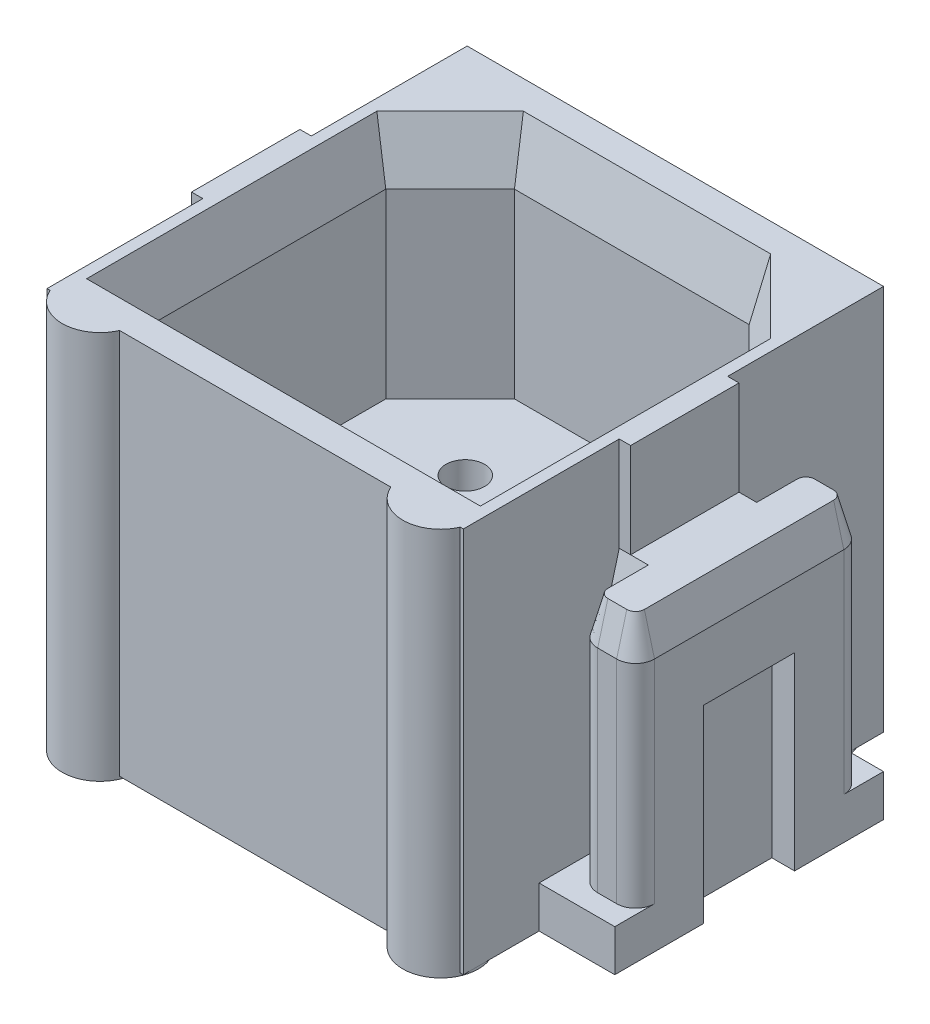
ISO-10303-21;
HEADER;
FILE_DESCRIPTION(('STEP AP214'),'2;1');
FILE_NAME('part.step','',(''),(''),'','','');
FILE_SCHEMA(('AUTOMOTIVE_DESIGN { 1 0 10303 214 1 1 1 1 }'));
ENDSEC;
DATA;
#1=APPLICATION_CONTEXT('core data for automotive mechanical design processes');
#2=APPLICATION_PROTOCOL_DEFINITION('international standard','automotive_design',2000,#1);
#3=PRODUCT_CONTEXT('',#1,'mechanical');
#4=PRODUCT('Part','Part','',(#3));
#5=PRODUCT_RELATED_PRODUCT_CATEGORY('part','',(#4));
#6=PRODUCT_DEFINITION_FORMATION('','',#4);
#7=PRODUCT_DEFINITION_CONTEXT('part definition',#1,'design');
#8=PRODUCT_DEFINITION('design','',#6,#7);
#9=PRODUCT_DEFINITION_SHAPE('','',#8);
#10=(LENGTH_UNIT() NAMED_UNIT(*) SI_UNIT(.MILLI.,.METRE.));
#11=(NAMED_UNIT(*) PLANE_ANGLE_UNIT() SI_UNIT($,.RADIAN.));
#12=(NAMED_UNIT(*) SI_UNIT($,.STERADIAN.) SOLID_ANGLE_UNIT());
#13=UNCERTAINTY_MEASURE_WITH_UNIT(LENGTH_MEASURE(1.E-05),#10,'distance_accuracy_value','');
#14=(GEOMETRIC_REPRESENTATION_CONTEXT(3) GLOBAL_UNCERTAINTY_ASSIGNED_CONTEXT((#13)) GLOBAL_UNIT_ASSIGNED_CONTEXT((#10,
#11,#12)) REPRESENTATION_CONTEXT('',''));
#15=CARTESIAN_POINT('',(0.,0.,0.));
#16=DIRECTION('',(0.,0.,1.));
#17=DIRECTION('',(1.,0.,0.));
#18=AXIS2_PLACEMENT_3D('',#15,#16,#17);
#19=CARTESIAN_POINT('',(-2.885679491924,3.85,1.420666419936));
#20=DIRECTION('',(0.,-1.,0.));
#21=DIRECTION('',(-1.,0.,0.));
#22=AXIS2_PLACEMENT_3D('',#19,#20,#21);
#23=PLANE('',#22);
#24=DIRECTION('',(0.,0.,1.));
#25=VECTOR('',#24,1.);
#26=CARTESIAN_POINT('',(-3.133974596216,3.85,0.));
#27=LINE('',#26,#25);
#28=CARTESIAN_POINT('',(-3.13397459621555,3.85000000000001,-1.24999999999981));
#29=VERTEX_POINT('',#28);
#30=CARTESIAN_POINT('',(-3.13397459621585,3.85,-0.716025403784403));
#31=VERTEX_POINT('',#30);
#32=EDGE_CURVE('E546',#29,#31,#27,.T.);
#33=ORIENTED_EDGE('',*,*,#32,.F.);
#34=CARTESIAN_POINT('',(-3.25,3.85000000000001,-1.25));
#35=DIRECTION('',(0.,-1.,0.));
#36=DIRECTION('',(0.,0.,-1.));
#37=AXIS2_PLACEMENT_3D('',#34,#35,#36);
#38=CIRCLE('',#37,0.116025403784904);
#39=CARTESIAN_POINT('',(-3.24999999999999,3.85000000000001,-1.36602540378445));
#40=VERTEX_POINT('',#39);
#41=EDGE_CURVE('E813',#40,#29,#38,.T.);
#42=ORIENTED_EDGE('',*,*,#41,.F.);
#43=DIRECTION('',(1.,0.,0.));
#44=VECTOR('',#43,1.);
#45=CARTESIAN_POINT('',(-3.258012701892,3.85,-1.366025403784));
#46=LINE('',#45,#44);
#47=CARTESIAN_POINT('',(-3.49999999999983,3.85000000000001,-1.36602540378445));
#48=VERTEX_POINT('',#47);
#49=EDGE_CURVE('E528',#48,#40,#46,.T.);
#50=ORIENTED_EDGE('',*,*,#49,.F.);
#51=CARTESIAN_POINT('',(-3.5,3.85000000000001,-1.25));
#52=DIRECTION('',(0.,-1.,0.));
#53=DIRECTION('',(0.,0.,-1.));
#54=AXIS2_PLACEMENT_3D('',#51,#52,#53);
#55=CIRCLE('',#54,0.116025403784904);
#56=CARTESIAN_POINT('',(-3.6160254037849,3.85000000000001,-1.25));
#57=VERTEX_POINT('',#56);
#58=EDGE_CURVE('E525',#57,#48,#55,.T.);
#59=ORIENTED_EDGE('',*,*,#58,.F.);
#60=DIRECTION('',(0.,0.,1.));
#61=VECTOR('',#60,1.);
#62=CARTESIAN_POINT('',(-3.61602540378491,3.85,0.));
#63=LINE('',#62,#61);
#64=CARTESIAN_POINT('',(-3.6160254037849,3.85000000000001,1.25));
#65=VERTEX_POINT('',#64);
#66=EDGE_CURVE('E535',#57,#65,#63,.T.);
#67=ORIENTED_EDGE('',*,*,#66,.T.);
#68=CARTESIAN_POINT('',(-3.5,3.85000000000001,1.25));
#69=DIRECTION('',(0.,-1.,0.));
#70=DIRECTION('',(0.,0.,-1.));
#71=AXIS2_PLACEMENT_3D('',#68,#69,#70);
#72=CIRCLE('',#71,0.116025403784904);
#73=CARTESIAN_POINT('',(-3.49999999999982,3.85000000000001,1.36602540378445));
#74=VERTEX_POINT('',#73);
#75=EDGE_CURVE('E523',#74,#65,#72,.T.);
#76=ORIENTED_EDGE('',*,*,#75,.F.);
#77=DIRECTION('',(-1.,0.,0.));
#78=VECTOR('',#77,1.);
#79=CARTESIAN_POINT('',(-3.258012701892,3.85,1.366025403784));
#80=LINE('',#79,#78);
#81=CARTESIAN_POINT('',(-3.25000000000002,3.85000000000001,1.36602540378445));
#82=VERTEX_POINT('',#81);
#83=EDGE_CURVE('E509',#82,#74,#80,.T.);
#84=ORIENTED_EDGE('',*,*,#83,.F.);
#85=CARTESIAN_POINT('',(-3.25,3.85000000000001,1.25));
#86=DIRECTION('',(0.,-1.,0.));
#87=DIRECTION('',(0.,0.,-1.));
#88=AXIS2_PLACEMENT_3D('',#85,#86,#87);
#89=CIRCLE('',#88,0.116025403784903);
#90=CARTESIAN_POINT('',(-3.13397459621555,3.85000000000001,1.2499999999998));
#91=VERTEX_POINT('',#90);
#92=EDGE_CURVE('E21',#91,#82,#89,.T.);
#93=ORIENTED_EDGE('',*,*,#92,.F.);
#94=DIRECTION('',(0.,0.,1.));
#95=VECTOR('',#94,1.);
#96=CARTESIAN_POINT('',(-3.133974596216,3.85,0.));
#97=LINE('',#96,#95);
#98=CARTESIAN_POINT('',(-3.13397459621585,3.85,0.716025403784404));
#99=VERTEX_POINT('',#98);
#100=EDGE_CURVE('E496',#99,#91,#97,.T.);
#101=ORIENTED_EDGE('',*,*,#100,.F.);
#102=DIRECTION('',(-1.,0.,0.));
#103=VECTOR('',#102,1.);
#104=CARTESIAN_POINT('',(-3.258012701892,3.85,0.7160254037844));
#105=LINE('',#104,#103);
#106=CARTESIAN_POINT('',(-2.9,3.85,0.716025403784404));
#107=VERTEX_POINT('',#106);
#108=EDGE_CURVE('E531',#107,#99,#105,.T.);
#109=ORIENTED_EDGE('',*,*,#108,.F.);
#110=DIRECTION('',(0.,0.,1.));
#111=VECTOR('',#110,1.);
#112=CARTESIAN_POINT('',(-2.9,3.85,0.));
#113=LINE('',#112,#111);
#114=CARTESIAN_POINT('',(-2.89999999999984,3.85,-0.7160254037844));
#115=VERTEX_POINT('',#114);
#116=EDGE_CURVE('E539',#115,#107,#113,.T.);
#117=ORIENTED_EDGE('',*,*,#116,.F.);
#118=DIRECTION('',(1.,0.,0.));
#119=VECTOR('',#118,1.);
#120=CARTESIAN_POINT('',(-3.258012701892,3.85,-0.7160254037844));
#121=LINE('',#120,#119);
#122=EDGE_CURVE('E543',#31,#115,#121,.T.);
#123=ORIENTED_EDGE('',*,*,#122,.F.);
#124=EDGE_LOOP('',(#33,#42,#50,#59,#67,#76,#84,#93,#101,#109,#117,#123));
#125=FACE_BOUND('',#124,.T.);
#126=ADVANCED_FACE('F17',(#125),#23,.F.);
#127=CARTESIAN_POINT('',(-3.45,2.601,-0.624));
#128=DIRECTION('',(-1.,0.,0.));
#129=DIRECTION('',(0.,-1.,0.));
#130=AXIS2_PLACEMENT_3D('',#127,#128,#129);
#131=PLANE('',#130);
#132=DIRECTION('',(0.,0.,1.));
#133=VECTOR('',#132,1.);
#134=CARTESIAN_POINT('',(-3.44999999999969,2.54999999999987,0.));
#135=LINE('',#134,#133);
#136=CARTESIAN_POINT('',(-3.44999999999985,2.54999999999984,-0.6));
#137=VERTEX_POINT('',#136);
#138=CARTESIAN_POINT('',(-3.44999999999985,2.54999999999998,0.6));
#139=VERTEX_POINT('',#138);
#140=EDGE_CURVE('E842',#137,#139,#135,.T.);
#141=ORIENTED_EDGE('',*,*,#140,.F.);
#142=DIRECTION('',(0.,-1.,0.));
#143=VECTOR('',#142,1.);
#144=CARTESIAN_POINT('',(-3.45,1.275,-0.6));
#145=LINE('',#144,#143);
#146=CARTESIAN_POINT('',(-3.45,0.,-0.6));
#147=VERTEX_POINT('',#146);
#148=EDGE_CURVE('E532',#137,#147,#145,.T.);
#149=ORIENTED_EDGE('',*,*,#148,.T.);
#150=DIRECTION('',(0.,0.,1.));
#151=VECTOR('',#150,1.);
#152=CARTESIAN_POINT('',(-3.45,0.,0.));
#153=LINE('',#152,#151);
#154=CARTESIAN_POINT('',(-3.45,0.,0.6));
#155=VERTEX_POINT('',#154);
#156=EDGE_CURVE('E545',#147,#155,#153,.T.);
#157=ORIENTED_EDGE('',*,*,#156,.T.);
#158=DIRECTION('',(0.,-1.,0.));
#159=VECTOR('',#158,1.);
#160=CARTESIAN_POINT('',(-3.45,1.275,0.6));
#161=LINE('',#160,#159);
#162=EDGE_CURVE('E808',#139,#155,#161,.T.);
#163=ORIENTED_EDGE('',*,*,#162,.F.);
#164=EDGE_LOOP('',(#141,#149,#157,#163));
#165=FACE_BOUND('',#164,.T.);
#166=ADVANCED_FACE('F1621',(#165),#131,.T.);
#167=CARTESIAN_POINT('',(-3.762925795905,2.494822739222,-0.624));
#168=DIRECTION('',(0.173648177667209,-0.984807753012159,0.));
#169=DIRECTION('',(0.984807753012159,0.173648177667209,0.));
#170=AXIS2_PLACEMENT_3D('',#167,#168,#169);
#171=PLANE('',#170);
#172=ORIENTED_EDGE('',*,*,#140,.T.);
#173=DIRECTION('',(0.98480775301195,0.173648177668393,0.));
#174=VECTOR('',#173,1.);
#175=CARTESIAN_POINT('',(-3.75,2.497101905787,0.6));
#176=LINE('',#175,#174);
#177=CARTESIAN_POINT('',(-3.75,2.497101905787,0.6));
#178=VERTEX_POINT('',#177);
#179=EDGE_CURVE('E805',#178,#139,#176,.T.);
#180=ORIENTED_EDGE('',*,*,#179,.F.);
#181=DIRECTION('',(0.,0.,-1.));
#182=VECTOR('',#181,1.);
#183=CARTESIAN_POINT('',(-3.75,2.497101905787,0.));
#184=LINE('',#183,#182);
#185=CARTESIAN_POINT('',(-3.75,2.49710190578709,-0.6));
#186=VERTEX_POINT('',#185);
#187=EDGE_CURVE('E852',#178,#186,#184,.T.);
#188=ORIENTED_EDGE('',*,*,#187,.T.);
#189=DIRECTION('',(0.984807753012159,0.173648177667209,0.));
#190=VECTOR('',#189,1.);
#191=CARTESIAN_POINT('',(-3.762925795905,2.494822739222,-0.6));
#192=LINE('',#191,#190);
#193=EDGE_CURVE('E536',#186,#137,#192,.T.);
#194=ORIENTED_EDGE('',*,*,#193,.T.);
#195=EDGE_LOOP('',(#172,#180,#188,#194));
#196=FACE_BOUND('',#195,.T.);
#197=ADVANCED_FACE('F1917',(#196),#171,.T.);
#198=CARTESIAN_POINT('',(-3.436874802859,-0.051,-0.6));
#199=DIRECTION('',(0.,0.,-1.));
#200=DIRECTION('',(-1.,0.,0.));
#201=AXIS2_PLACEMENT_3D('',#198,#199,#200);
#202=PLANE('',#201);
#203=ORIENTED_EDGE('',*,*,#193,.F.);
#204=DIRECTION('',(0.,-1.,0.));
#205=VECTOR('',#204,1.);
#206=CARTESIAN_POINT('',(-3.75,1.675,-0.6));
#207=LINE('',#206,#205);
#208=CARTESIAN_POINT('',(-3.75,0.,-0.6));
#209=VERTEX_POINT('',#208);
#210=EDGE_CURVE('E854',#186,#209,#207,.T.);
#211=ORIENTED_EDGE('',*,*,#210,.T.);
#212=DIRECTION('',(-1.,0.,0.));
#213=VECTOR('',#212,1.);
#214=CARTESIAN_POINT('',(-3.6,0.,-0.6));
#215=LINE('',#214,#213);
#216=EDGE_CURVE('E812',#147,#209,#215,.T.);
#217=ORIENTED_EDGE('',*,*,#216,.F.);
#218=ORIENTED_EDGE('',*,*,#148,.F.);
#219=EDGE_LOOP('',(#203,#211,#217,#218));
#220=FACE_BOUND('',#219,.T.);
#221=ADVANCED_FACE('F1624',(#220),#202,.F.);
#222=CARTESIAN_POINT('',(-3.612628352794,3.862677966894,-1.3));
#223=DIRECTION('',(0.965925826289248,-0.258819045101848,0.));
#224=DIRECTION('',(0.,0.,1.));
#225=AXIS2_PLACEMENT_3D('',#222,#223,#224);
#226=PLANE('',#225);
#227=DIRECTION('',(0.,0.,1.));
#228=VECTOR('',#227,1.);
#229=CARTESIAN_POINT('',(-3.75,3.35,0.));
#230=LINE('',#229,#228);
#231=CARTESIAN_POINT('',(-3.75000000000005,3.35,-1.25));
#232=VERTEX_POINT('',#231);
#233=CARTESIAN_POINT('',(-3.75000000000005,3.35,1.24999999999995));
#234=VERTEX_POINT('',#233);
#235=EDGE_CURVE('E941',#232,#234,#230,.T.);
#236=ORIENTED_EDGE('',*,*,#235,.T.);
#237=DIRECTION('',(-0.258819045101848,-0.965925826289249,0.));
#238=VECTOR('',#237,1.);
#239=CARTESIAN_POINT('',(-3.6830127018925,3.6,1.25));
#240=LINE('',#239,#238);
#241=EDGE_CURVE('E841',#65,#234,#240,.T.);
#242=ORIENTED_EDGE('',*,*,#241,.F.);
#243=ORIENTED_EDGE('',*,*,#66,.F.);
#244=DIRECTION('',(0.258819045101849,0.965925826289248,0.));
#245=VECTOR('',#244,1.);
#246=CARTESIAN_POINT('',(-3.6830127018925,3.6,-1.25));
#247=LINE('',#246,#245);
#248=EDGE_CURVE('E809',#232,#57,#247,.T.);
#249=ORIENTED_EDGE('',*,*,#248,.F.);
#250=EDGE_LOOP('',(#236,#242,#243,#249));
#251=FACE_BOUND('',#250,.T.);
#252=ADVANCED_FACE('F1911',(#251),#226,.F.);
#253=CARTESIAN_POINT('',(-3.436874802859,-0.051,0.6));
#254=DIRECTION('',(0.,0.,-1.));
#255=DIRECTION('',(-1.,0.,0.));
#256=AXIS2_PLACEMENT_3D('',#253,#254,#255);
#257=PLANE('',#256);
#258=ORIENTED_EDGE('',*,*,#162,.T.);
#259=DIRECTION('',(-1.,0.,0.));
#260=VECTOR('',#259,1.);
#261=CARTESIAN_POINT('',(-3.6,0.,0.6));
#262=LINE('',#261,#260);
#263=CARTESIAN_POINT('',(-3.75,0.,0.6));
#264=VERTEX_POINT('',#263);
#265=EDGE_CURVE('E851',#155,#264,#262,.T.);
#266=ORIENTED_EDGE('',*,*,#265,.T.);
#267=DIRECTION('',(0.,1.,0.));
#268=VECTOR('',#267,1.);
#269=CARTESIAN_POINT('',(-3.75,1.675,0.6));
#270=LINE('',#269,#268);
#271=EDGE_CURVE('E879',#264,#178,#270,.T.);
#272=ORIENTED_EDGE('',*,*,#271,.T.);
#273=ORIENTED_EDGE('',*,*,#179,.T.);
#274=EDGE_LOOP('',(#258,#266,#272,#273));
#275=FACE_BOUND('',#274,.T.);
#276=ADVANCED_FACE('F1616',(#275),#257,.T.);
#277=CARTESIAN_POINT('',(-3.75,3.417,-1.846));
#278=DIRECTION('',(1.,0.,0.));
#279=DIRECTION('',(0.,0.,1.));
#280=AXIS2_PLACEMENT_3D('',#277,#278,#279);
#281=PLANE('',#280);
#282=DIRECTION('',(0.,0.,-1.));
#283=VECTOR('',#282,1.);
#284=CARTESIAN_POINT('',(-3.75,0.,0.));
#285=LINE('',#284,#283);
#286=CARTESIAN_POINT('',(-3.75,0.,1.775));
#287=VERTEX_POINT('',#286);
#288=EDGE_CURVE('E883',#287,#264,#285,.T.);
#289=ORIENTED_EDGE('',*,*,#288,.F.);
#290=DIRECTION('',(0.,-1.,0.));
#291=VECTOR('',#290,1.);
#292=CARTESIAN_POINT('',(-3.75,1.675,1.775));
#293=LINE('',#292,#291);
#294=CARTESIAN_POINT('',(-3.75,0.550000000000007,1.775));
#295=VERTEX_POINT('',#294);
#296=EDGE_CURVE('E891',#295,#287,#293,.T.);
#297=ORIENTED_EDGE('',*,*,#296,.F.);
#298=DIRECTION('',(0.,0.,1.));
#299=VECTOR('',#298,1.);
#300=CARTESIAN_POINT('',(-3.75,0.55,0.));
#301=LINE('',#300,#299);
#302=CARTESIAN_POINT('',(-3.75,0.550000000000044,1.24999999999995));
#303=VERTEX_POINT('',#302);
#304=EDGE_CURVE('E895',#303,#295,#301,.T.);
#305=ORIENTED_EDGE('',*,*,#304,.F.);
#306=DIRECTION('',(0.,1.,0.));
#307=VECTOR('',#306,1.);
#308=CARTESIAN_POINT('',(-3.75,1.95,1.2499999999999));
#309=LINE('',#308,#307);
#310=EDGE_CURVE('E790',#303,#234,#309,.T.);
#311=ORIENTED_EDGE('',*,*,#310,.T.);
#312=ORIENTED_EDGE('',*,*,#235,.F.);
#313=DIRECTION('',(0.,-1.,0.));
#314=VECTOR('',#313,1.);
#315=CARTESIAN_POINT('',(-3.75,1.95,-1.25));
#316=LINE('',#315,#314);
#317=CARTESIAN_POINT('',(-3.75,0.550000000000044,-1.25));
#318=VERTEX_POINT('',#317);
#319=EDGE_CURVE('E786',#232,#318,#316,.T.);
#320=ORIENTED_EDGE('',*,*,#319,.T.);
#321=DIRECTION('',(0.,0.,1.));
#322=VECTOR('',#321,1.);
#323=CARTESIAN_POINT('',(-3.75,0.55,0.));
#324=LINE('',#323,#322);
#325=CARTESIAN_POINT('',(-3.75,0.55,-1.775));
#326=VERTEX_POINT('',#325);
#327=EDGE_CURVE('E870',#326,#318,#324,.T.);
#328=ORIENTED_EDGE('',*,*,#327,.F.);
#329=DIRECTION('',(0.,1.,0.));
#330=VECTOR('',#329,1.);
#331=CARTESIAN_POINT('',(-3.75,1.675,-1.775));
#332=LINE('',#331,#330);
#333=CARTESIAN_POINT('',(-3.75,0.,-1.775));
#334=VERTEX_POINT('',#333);
#335=EDGE_CURVE('E866',#334,#326,#332,.T.);
#336=ORIENTED_EDGE('',*,*,#335,.F.);
#337=DIRECTION('',(0.,0.,-1.));
#338=VECTOR('',#337,1.);
#339=CARTESIAN_POINT('',(-3.75,0.,0.));
#340=LINE('',#339,#338);
#341=EDGE_CURVE('E862',#209,#334,#340,.T.);
#342=ORIENTED_EDGE('',*,*,#341,.F.);
#343=ORIENTED_EDGE('',*,*,#210,.F.);
#344=ORIENTED_EDGE('',*,*,#187,.F.);
#345=ORIENTED_EDGE('',*,*,#271,.F.);
#346=EDGE_LOOP('',(#289,#297,#305,#311,#312,#320,#328,#336,#342,#343,#344,#345));
#347=FACE_BOUND('',#346,.T.);
#348=ADVANCED_FACE('F1611',(#347),#281,.F.);
#349=CARTESIAN_POINT('',(2.885679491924,3.85,1.420666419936));
#350=DIRECTION('',(0.,1.,0.));
#351=DIRECTION('',(1.,0.,0.));
#352=AXIS2_PLACEMENT_3D('',#349,#350,#351);
#353=PLANE('',#352);
#354=DIRECTION('',(0.,0.,1.));
#355=VECTOR('',#354,1.);
#356=CARTESIAN_POINT('',(3.133974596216,3.85,0.));
#357=LINE('',#356,#355);
#358=CARTESIAN_POINT('',(3.13397459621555,3.85,-1.24999999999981));
#359=VERTEX_POINT('',#358);
#360=CARTESIAN_POINT('',(3.13397459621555,3.85,-0.716025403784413));
#361=VERTEX_POINT('',#360);
#362=EDGE_CURVE('E795',#359,#361,#357,.T.);
#363=ORIENTED_EDGE('',*,*,#362,.T.);
#364=DIRECTION('',(-1.,0.,0.));
#365=VECTOR('',#364,1.);
#366=CARTESIAN_POINT('',(3.258012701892,3.85,-0.7160254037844));
#367=LINE('',#366,#365);
#368=CARTESIAN_POINT('',(2.9,3.85,-0.71602540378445));
#369=VERTEX_POINT('',#368);
#370=EDGE_CURVE('E933',#361,#369,#367,.T.);
#371=ORIENTED_EDGE('',*,*,#370,.T.);
#372=DIRECTION('',(0.,0.,1.));
#373=VECTOR('',#372,1.);
#374=CARTESIAN_POINT('',(2.9,3.85,0.));
#375=LINE('',#374,#373);
#376=CARTESIAN_POINT('',(2.9,3.85,0.716025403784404));
#377=VERTEX_POINT('',#376);
#378=EDGE_CURVE('E882',#369,#377,#375,.T.);
#379=ORIENTED_EDGE('',*,*,#378,.T.);
#380=DIRECTION('',(1.,0.,0.));
#381=VECTOR('',#380,1.);
#382=CARTESIAN_POINT('',(3.258012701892,3.85,0.7160254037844));
#383=LINE('',#382,#381);
#384=CARTESIAN_POINT('',(3.13397459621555,3.85,0.716025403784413));
#385=VERTEX_POINT('',#384);
#386=EDGE_CURVE('E908',#377,#385,#383,.T.);
#387=ORIENTED_EDGE('',*,*,#386,.T.);
#388=DIRECTION('',(0.,0.,1.));
#389=VECTOR('',#388,1.);
#390=CARTESIAN_POINT('',(3.133974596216,3.85,0.));
#391=LINE('',#390,#389);
#392=CARTESIAN_POINT('',(3.13397459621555,3.85,1.2499999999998));
#393=VERTEX_POINT('',#392);
#394=EDGE_CURVE('E804',#385,#393,#391,.T.);
#395=ORIENTED_EDGE('',*,*,#394,.T.);
#396=CARTESIAN_POINT('',(3.25,3.85,1.25));
#397=DIRECTION('',(0.,-1.,0.));
#398=DIRECTION('',(0.,0.,-1.));
#399=AXIS2_PLACEMENT_3D('',#396,#397,#398);
#400=CIRCLE('',#399,0.116025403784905);
#401=CARTESIAN_POINT('',(3.25000000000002,3.85,1.36602540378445));
#402=VERTEX_POINT('',#401);
#403=EDGE_CURVE('E801',#393,#402,#400,.F.);
#404=ORIENTED_EDGE('',*,*,#403,.T.);
#405=DIRECTION('',(1.,0.,0.));
#406=VECTOR('',#405,1.);
#407=CARTESIAN_POINT('',(3.258012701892,3.85,1.366025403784));
#408=LINE('',#407,#406);
#409=CARTESIAN_POINT('',(3.49999999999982,3.85,1.36602540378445));
#410=VERTEX_POINT('',#409);
#411=EDGE_CURVE('E800',#402,#410,#408,.T.);
#412=ORIENTED_EDGE('',*,*,#411,.T.);
#413=CARTESIAN_POINT('',(3.5,3.85,1.25));
#414=DIRECTION('',(0.,-1.,0.));
#415=DIRECTION('',(0.,0.,-1.));
#416=AXIS2_PLACEMENT_3D('',#413,#414,#415);
#417=CIRCLE('',#416,0.116025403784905);
#418=CARTESIAN_POINT('',(3.61602540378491,3.85,1.25));
#419=VERTEX_POINT('',#418);
#420=EDGE_CURVE('E781',#410,#419,#417,.F.);
#421=ORIENTED_EDGE('',*,*,#420,.T.);
#422=DIRECTION('',(0.,0.,-1.));
#423=VECTOR('',#422,1.);
#424=CARTESIAN_POINT('',(3.61602540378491,3.85,0.));
#425=LINE('',#424,#423);
#426=CARTESIAN_POINT('',(3.61602540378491,3.85,-1.25));
#427=VERTEX_POINT('',#426);
#428=EDGE_CURVE('E969',#419,#427,#425,.T.);
#429=ORIENTED_EDGE('',*,*,#428,.T.);
#430=CARTESIAN_POINT('',(3.5,3.85,-1.25));
#431=DIRECTION('',(0.,-1.,0.));
#432=DIRECTION('',(0.,0.,-1.));
#433=AXIS2_PLACEMENT_3D('',#430,#431,#432);
#434=CIRCLE('',#433,0.116025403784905);
#435=CARTESIAN_POINT('',(3.49999999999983,3.85,-1.36602540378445));
#436=VERTEX_POINT('',#435);
#437=EDGE_CURVE('E797',#427,#436,#434,.F.);
#438=ORIENTED_EDGE('',*,*,#437,.T.);
#439=DIRECTION('',(-1.,0.,0.));
#440=VECTOR('',#439,1.);
#441=CARTESIAN_POINT('',(3.258012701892,3.85,-1.366025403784));
#442=LINE('',#441,#440);
#443=CARTESIAN_POINT('',(3.24999999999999,3.85,-1.36602540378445));
#444=VERTEX_POINT('',#443);
#445=EDGE_CURVE('E796',#436,#444,#442,.T.);
#446=ORIENTED_EDGE('',*,*,#445,.T.);
#447=CARTESIAN_POINT('',(3.25,3.85,-1.25));
#448=DIRECTION('',(0.,-1.,0.));
#449=DIRECTION('',(0.,0.,-1.));
#450=AXIS2_PLACEMENT_3D('',#447,#448,#449);
#451=CIRCLE('',#450,0.116025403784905);
#452=EDGE_CURVE('E792',#444,#359,#451,.F.);
#453=ORIENTED_EDGE('',*,*,#452,.T.);
#454=EDGE_LOOP('',(#363,#371,#379,#387,#395,#404,#412,#421,#429,#438,#446,#453));
#455=FACE_BOUND('',#454,.T.);
#456=ADVANCED_FACE('F1902',(#455),#353,.T.);
#457=CARTESIAN_POINT('',(3.45,2.601,-0.624));
#458=DIRECTION('',(-1.,0.,0.));
#459=DIRECTION('',(0.,-1.,0.));
#460=AXIS2_PLACEMENT_3D('',#457,#458,#459);
#461=PLANE('',#460);
#462=DIRECTION('',(0.,0.,1.));
#463=VECTOR('',#462,1.);
#464=CARTESIAN_POINT('',(3.44999999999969,2.54999999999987,0.));
#465=LINE('',#464,#463);
#466=CARTESIAN_POINT('',(3.44999999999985,2.54999999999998,-0.6));
#467=VERTEX_POINT('',#466);
#468=CARTESIAN_POINT('',(3.44999999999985,2.54999999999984,0.6));
#469=VERTEX_POINT('',#468);
#470=EDGE_CURVE('E780',#467,#469,#465,.T.);
#471=ORIENTED_EDGE('',*,*,#470,.T.);
#472=DIRECTION('',(0.,-1.,0.));
#473=VECTOR('',#472,1.);
#474=CARTESIAN_POINT('',(3.45,1.275,0.6));
#475=LINE('',#474,#473);
#476=CARTESIAN_POINT('',(3.45,0.,0.6));
#477=VERTEX_POINT('',#476);
#478=EDGE_CURVE('E770',#469,#477,#475,.T.);
#479=ORIENTED_EDGE('',*,*,#478,.T.);
#480=DIRECTION('',(0.,0.,1.));
#481=VECTOR('',#480,1.);
#482=CARTESIAN_POINT('',(3.45,0.,0.));
#483=LINE('',#482,#481);
#484=CARTESIAN_POINT('',(3.45,0.,-0.6));
#485=VERTEX_POINT('',#484);
#486=EDGE_CURVE('E791',#485,#477,#483,.T.);
#487=ORIENTED_EDGE('',*,*,#486,.F.);
#488=DIRECTION('',(0.,-1.,0.));
#489=VECTOR('',#488,1.);
#490=CARTESIAN_POINT('',(3.45,1.275,-0.6));
#491=LINE('',#490,#489);
#492=EDGE_CURVE('E779',#467,#485,#491,.T.);
#493=ORIENTED_EDGE('',*,*,#492,.F.);
#494=EDGE_LOOP('',(#471,#479,#487,#493));
#495=FACE_BOUND('',#494,.T.);
#496=ADVANCED_FACE('F1898',(#495),#461,.F.);
#497=CARTESIAN_POINT('',(-3.5,3.35,1.25));
#498=DIRECTION('',(0.,-1.,0.));
#499=DIRECTION('',(0.,0.,-1.));
#500=AXIS2_PLACEMENT_3D('',#497,#498,#499);
#501=CYLINDRICAL_SURFACE('',#500,0.25);
#502=CARTESIAN_POINT('',(-3.5,3.35,1.25));
#503=DIRECTION('',(0.,-1.,0.));
#504=DIRECTION('',(-1.,0.,0.));
#505=AXIS2_PLACEMENT_3D('',#502,#503,#504);
#506=CIRCLE('',#505,0.250000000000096);
#507=CARTESIAN_POINT('',(-3.49999999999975,3.35000000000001,1.50000000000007));
#508=VERTEX_POINT('',#507);
#509=EDGE_CURVE('E787',#508,#234,#506,.T.);
#510=ORIENTED_EDGE('',*,*,#509,.T.);
#511=ORIENTED_EDGE('',*,*,#310,.F.);
#512=CARTESIAN_POINT('',(-3.5,0.550000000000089,1.25));
#513=DIRECTION('',(0.,-1.,0.));
#514=DIRECTION('',(0.,0.,-1.));
#515=AXIS2_PLACEMENT_3D('',#512,#513,#514);
#516=CIRCLE('',#515,0.25);
#517=CARTESIAN_POINT('',(-3.49999999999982,0.550000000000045,1.5));
#518=VERTEX_POINT('',#517);
#519=EDGE_CURVE('E788',#518,#303,#516,.T.);
#520=ORIENTED_EDGE('',*,*,#519,.F.);
#521=DIRECTION('',(0.,1.,0.));
#522=VECTOR('',#521,1.);
#523=CARTESIAN_POINT('',(-3.49999999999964,1.95,1.5));
#524=LINE('',#523,#522);
#525=EDGE_CURVE('E990',#518,#508,#524,.T.);
#526=ORIENTED_EDGE('',*,*,#525,.T.);
#527=EDGE_LOOP('',(#510,#511,#520,#526));
#528=FACE_BOUND('',#527,.T.);
#529=ADVANCED_FACE('F1901',(#528),#501,.T.);
#530=CARTESIAN_POINT('',(-3.5,3.85000000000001,1.25));
#531=DIRECTION('',(0.,-1.,0.));
#532=DIRECTION('',(0.,0.,-1.));
#533=AXIS2_PLACEMENT_3D('',#530,#531,#532);
#534=CONICAL_SURFACE('',#533,0.116025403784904,0.261799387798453);
#535=ORIENTED_EDGE('',*,*,#509,.F.);
#536=DIRECTION('',(0.,-0.965925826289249,0.258819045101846));
#537=VECTOR('',#536,1.);
#538=CARTESIAN_POINT('',(-3.49999999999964,3.6,1.4330127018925));
#539=LINE('',#538,#537);
#540=EDGE_CURVE('E988',#74,#508,#539,.T.);
#541=ORIENTED_EDGE('',*,*,#540,.F.);
#542=ORIENTED_EDGE('',*,*,#75,.T.);
#543=ORIENTED_EDGE('',*,*,#241,.T.);
#544=EDGE_LOOP('',(#535,#541,#542,#543));
#545=FACE_BOUND('',#544,.T.);
#546=ADVANCED_FACE('F1927',(#545),#534,.T.);
#547=CARTESIAN_POINT('',(-3.5,3.35,-1.25));
#548=DIRECTION('',(0.,-1.,0.));
#549=DIRECTION('',(0.,0.,-1.));
#550=AXIS2_PLACEMENT_3D('',#547,#548,#549);
#551=CYLINDRICAL_SURFACE('',#550,0.25);
#552=CARTESIAN_POINT('',(-3.5,3.35,-1.25));
#553=DIRECTION('',(0.,-1.,0.));
#554=DIRECTION('',(-1.,0.,0.));
#555=AXIS2_PLACEMENT_3D('',#552,#553,#554);
#556=CIRCLE('',#555,0.250000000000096);
#557=CARTESIAN_POINT('',(-3.49999999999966,3.35000000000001,-1.50000000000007));
#558=VERTEX_POINT('',#557);
#559=EDGE_CURVE('E783',#232,#558,#556,.T.);
#560=ORIENTED_EDGE('',*,*,#559,.T.);
#561=DIRECTION('',(0.,-1.,0.));
#562=VECTOR('',#561,1.);
#563=CARTESIAN_POINT('',(-3.49999999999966,1.95,-1.5));
#564=LINE('',#563,#562);
#565=CARTESIAN_POINT('',(-3.49999999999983,0.550000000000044,-1.5));
#566=VERTEX_POINT('',#565);
#567=EDGE_CURVE('E1004',#558,#566,#564,.T.);
#568=ORIENTED_EDGE('',*,*,#567,.T.);
#569=CARTESIAN_POINT('',(-3.5,0.550000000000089,-1.25));
#570=DIRECTION('',(0.,-1.,0.));
#571=DIRECTION('',(0.,0.,-1.));
#572=AXIS2_PLACEMENT_3D('',#569,#570,#571);
#573=CIRCLE('',#572,0.25);
#574=EDGE_CURVE('E784',#318,#566,#573,.T.);
#575=ORIENTED_EDGE('',*,*,#574,.F.);
#576=ORIENTED_EDGE('',*,*,#319,.F.);
#577=EDGE_LOOP('',(#560,#568,#575,#576));
#578=FACE_BOUND('',#577,.T.);
#579=ADVANCED_FACE('F1931',(#578),#551,.T.);
#580=CARTESIAN_POINT('',(-3.5,3.85000000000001,-1.25));
#581=DIRECTION('',(0.,-1.,0.));
#582=DIRECTION('',(0.,0.,-1.));
#583=AXIS2_PLACEMENT_3D('',#580,#581,#582);
#584=CONICAL_SURFACE('',#583,0.116025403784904,0.261799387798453);
#585=ORIENTED_EDGE('',*,*,#559,.F.);
#586=ORIENTED_EDGE('',*,*,#248,.T.);
#587=ORIENTED_EDGE('',*,*,#58,.T.);
#588=DIRECTION('',(0.,0.965925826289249,0.258819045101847));
#589=VECTOR('',#588,1.);
#590=CARTESIAN_POINT('',(-3.49999999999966,3.6,-1.4330127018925));
#591=LINE('',#590,#589);
#592=EDGE_CURVE('E827',#558,#48,#591,.T.);
#593=ORIENTED_EDGE('',*,*,#592,.F.);
#594=EDGE_LOOP('',(#585,#586,#587,#593));
#595=FACE_BOUND('',#594,.T.);
#596=ADVANCED_FACE('F1935',(#595),#584,.T.);
#597=CARTESIAN_POINT('',(3.5,3.34999999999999,1.25));
#598=DIRECTION('',(0.,-1.,0.));
#599=DIRECTION('',(0.,0.,-1.));
#600=AXIS2_PLACEMENT_3D('',#597,#598,#599);
#601=CONICAL_SURFACE('',#600,0.250000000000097,0.261799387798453);
#602=CARTESIAN_POINT('',(3.5,3.34999999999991,1.25));
#603=DIRECTION('',(0.,1.,0.));
#604=DIRECTION('',(1.,0.,0.));
#605=AXIS2_PLACEMENT_3D('',#602,#603,#604);
#606=CIRCLE('',#605,0.25);
#607=CARTESIAN_POINT('',(3.49999999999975,3.34999999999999,1.50000000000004));
#608=VERTEX_POINT('',#607);
#609=CARTESIAN_POINT('',(3.75000000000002,3.34999999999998,1.25));
#610=VERTEX_POINT('',#609);
#611=EDGE_CURVE('E774',#608,#610,#606,.T.);
#612=ORIENTED_EDGE('',*,*,#611,.T.);
#613=DIRECTION('',(-0.258819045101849,0.965925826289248,0.));
#614=VECTOR('',#613,1.);
#615=CARTESIAN_POINT('',(3.6830127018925,3.6,1.25));
#616=LINE('',#615,#614);
#617=EDGE_CURVE('E775',#610,#419,#616,.T.);
#618=ORIENTED_EDGE('',*,*,#617,.T.);
#619=ORIENTED_EDGE('',*,*,#420,.F.);
#620=DIRECTION('',(0.,-0.965925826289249,0.258819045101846));
#621=VECTOR('',#620,1.);
#622=CARTESIAN_POINT('',(3.49999999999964,3.6,1.4330127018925));
#623=LINE('',#622,#621);
#624=EDGE_CURVE('E1010',#410,#608,#623,.T.);
#625=ORIENTED_EDGE('',*,*,#624,.T.);
#626=EDGE_LOOP('',(#612,#618,#619,#625));
#627=FACE_BOUND('',#626,.T.);
#628=ADVANCED_FACE('F1896',(#627),#601,.T.);
#629=CARTESIAN_POINT('',(3.762925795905,2.494822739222,-0.624));
#630=DIRECTION('',(0.173648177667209,0.984807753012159,0.));
#631=DIRECTION('',(-0.984807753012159,0.173648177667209,0.));
#632=AXIS2_PLACEMENT_3D('',#629,#630,#631);
#633=PLANE('',#632);
#634=ORIENTED_EDGE('',*,*,#470,.F.);
#635=DIRECTION('',(-0.98480775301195,0.173648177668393,0.));
#636=VECTOR('',#635,1.);
#637=CARTESIAN_POINT('',(3.75,2.497101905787,-0.6));
#638=LINE('',#637,#636);
#639=CARTESIAN_POINT('',(3.75,2.497101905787,-0.6));
#640=VERTEX_POINT('',#639);
#641=EDGE_CURVE('E776',#640,#467,#638,.T.);
#642=ORIENTED_EDGE('',*,*,#641,.F.);
#643=DIRECTION('',(0.,0.,-1.));
#644=VECTOR('',#643,1.);
#645=CARTESIAN_POINT('',(3.75,2.497101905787,0.));
#646=LINE('',#645,#644);
#647=CARTESIAN_POINT('',(3.75,2.49710190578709,0.6));
#648=VERTEX_POINT('',#647);
#649=EDGE_CURVE('E1019',#648,#640,#646,.T.);
#650=ORIENTED_EDGE('',*,*,#649,.F.);
#651=DIRECTION('',(-0.984807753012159,0.173648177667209,0.));
#652=VECTOR('',#651,1.);
#653=CARTESIAN_POINT('',(3.762925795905,2.494822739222,0.600000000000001));
#654=LINE('',#653,#652);
#655=EDGE_CURVE('E767',#648,#469,#654,.T.);
#656=ORIENTED_EDGE('',*,*,#655,.T.);
#657=EDGE_LOOP('',(#634,#642,#650,#656));
#658=FACE_BOUND('',#657,.T.);
#659=ADVANCED_FACE('F1892',(#658),#633,.F.);
#660=CARTESIAN_POINT('',(3.436874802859,-0.051,-0.6));
#661=DIRECTION('',(0.,0.,1.));
#662=DIRECTION('',(1.,0.,0.));
#663=AXIS2_PLACEMENT_3D('',#660,#661,#662);
#664=PLANE('',#663);
#665=ORIENTED_EDGE('',*,*,#492,.T.);
#666=DIRECTION('',(1.,0.,0.));
#667=VECTOR('',#666,1.);
#668=CARTESIAN_POINT('',(3.6,0.,-0.6));
#669=LINE('',#668,#667);
#670=CARTESIAN_POINT('',(3.75,0.,-0.6));
#671=VERTEX_POINT('',#670);
#672=EDGE_CURVE('E961',#485,#671,#669,.T.);
#673=ORIENTED_EDGE('',*,*,#672,.T.);
#674=DIRECTION('',(0.,-1.,0.));
#675=VECTOR('',#674,1.);
#676=CARTESIAN_POINT('',(3.75,1.675,-0.6));
#677=LINE('',#676,#675);
#678=EDGE_CURVE('E1022',#640,#671,#677,.T.);
#679=ORIENTED_EDGE('',*,*,#678,.F.);
#680=ORIENTED_EDGE('',*,*,#641,.T.);
#681=EDGE_LOOP('',(#665,#673,#679,#680));
#682=FACE_BOUND('',#681,.T.);
#683=ADVANCED_FACE('F1888',(#682),#664,.T.);
#684=CARTESIAN_POINT('',(3.612628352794,3.862677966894,1.3));
#685=DIRECTION('',(-0.965925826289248,-0.258819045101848,0.));
#686=DIRECTION('',(0.,0.,-1.));
#687=AXIS2_PLACEMENT_3D('',#684,#685,#686);
#688=PLANE('',#687);
#689=DIRECTION('',(0.,0.,1.));
#690=VECTOR('',#689,1.);
#691=CARTESIAN_POINT('',(3.75,3.35,0.));
#692=LINE('',#691,#690);
#693=CARTESIAN_POINT('',(3.75000000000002,3.34999999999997,-1.25));
#694=VERTEX_POINT('',#693);
#695=EDGE_CURVE('E1062',#694,#610,#692,.T.);
#696=ORIENTED_EDGE('',*,*,#695,.F.);
#697=DIRECTION('',(0.258819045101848,-0.965925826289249,0.));
#698=VECTOR('',#697,1.);
#699=CARTESIAN_POINT('',(3.6830127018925,3.6,-1.25));
#700=LINE('',#699,#698);
#701=EDGE_CURVE('E972',#427,#694,#700,.T.);
#702=ORIENTED_EDGE('',*,*,#701,.F.);
#703=ORIENTED_EDGE('',*,*,#428,.F.);
#704=ORIENTED_EDGE('',*,*,#617,.F.);
#705=EDGE_LOOP('',(#696,#702,#703,#704));
#706=FACE_BOUND('',#705,.T.);
#707=ADVANCED_FACE('F1885',(#706),#688,.F.);
#708=CARTESIAN_POINT('',(3.5,0.550000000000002,1.25));
#709=DIRECTION('',(0.,1.,0.));
#710=DIRECTION('',(0.,0.,1.));
#711=AXIS2_PLACEMENT_3D('',#708,#709,#710);
#712=CYLINDRICAL_SURFACE('',#711,0.25);
#713=ORIENTED_EDGE('',*,*,#611,.F.);
#714=DIRECTION('',(0.,1.,0.));
#715=VECTOR('',#714,1.);
#716=CARTESIAN_POINT('',(3.49999999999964,1.95,1.5));
#717=LINE('',#716,#715);
#718=CARTESIAN_POINT('',(3.49999999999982,0.550000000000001,1.5));
#719=VERTEX_POINT('',#718);
#720=EDGE_CURVE('E1014',#719,#608,#717,.T.);
#721=ORIENTED_EDGE('',*,*,#720,.F.);
#722=CARTESIAN_POINT('',(3.5,0.550000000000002,1.25));
#723=DIRECTION('',(0.,1.,0.));
#724=DIRECTION('',(0.,0.,1.));
#725=AXIS2_PLACEMENT_3D('',#722,#723,#724);
#726=CIRCLE('',#725,0.25);
#727=CARTESIAN_POINT('',(3.75,0.550000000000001,1.25));
#728=VERTEX_POINT('',#727);
#729=EDGE_CURVE('E772',#728,#719,#726,.F.);
#730=ORIENTED_EDGE('',*,*,#729,.F.);
#731=DIRECTION('',(0.,-1.,0.));
#732=VECTOR('',#731,1.);
#733=CARTESIAN_POINT('',(3.75,1.675,1.25));
#734=LINE('',#733,#732);
#735=EDGE_CURVE('E1065',#610,#728,#734,.T.);
#736=ORIENTED_EDGE('',*,*,#735,.F.);
#737=EDGE_LOOP('',(#713,#721,#730,#736));
#738=FACE_BOUND('',#737,.T.);
#739=ADVANCED_FACE('F1550',(#738),#712,.T.);
#740=CARTESIAN_POINT('',(3.436874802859,-0.051,0.6));
#741=DIRECTION('',(0.,0.,1.));
#742=DIRECTION('',(1.,0.,0.));
#743=AXIS2_PLACEMENT_3D('',#740,#741,#742);
#744=PLANE('',#743);
#745=ORIENTED_EDGE('',*,*,#655,.F.);
#746=DIRECTION('',(0.,1.,0.));
#747=VECTOR('',#746,1.);
#748=CARTESIAN_POINT('',(3.75,1.675,0.6));
#749=LINE('',#748,#747);
#750=CARTESIAN_POINT('',(3.75,0.,0.6));
#751=VERTEX_POINT('',#750);
#752=EDGE_CURVE('E766',#751,#648,#749,.T.);
#753=ORIENTED_EDGE('',*,*,#752,.F.);
#754=DIRECTION('',(1.,0.,0.));
#755=VECTOR('',#754,1.);
#756=CARTESIAN_POINT('',(3.6,0.,0.6));
#757=LINE('',#756,#755);
#758=EDGE_CURVE('E771',#477,#751,#757,.T.);
#759=ORIENTED_EDGE('',*,*,#758,.F.);
#760=ORIENTED_EDGE('',*,*,#478,.F.);
#761=EDGE_LOOP('',(#745,#753,#759,#760));
#762=FACE_BOUND('',#761,.T.);
#763=ADVANCED_FACE('F1880',(#762),#744,.F.);
#764=CARTESIAN_POINT('',(-3.236874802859,0.494,1.5));
#765=DIRECTION('',(0.,0.,-1.));
#766=DIRECTION('',(-1.,0.,0.));
#767=AXIS2_PLACEMENT_3D('',#764,#765,#766);
#768=PLANE('',#767);
#769=DIRECTION('',(1.,0.,0.));
#770=VECTOR('',#769,1.);
#771=CARTESIAN_POINT('',(-3.375,3.35000000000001,1.50000000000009));
#772=LINE('',#771,#770);
#773=CARTESIAN_POINT('',(-3.25000000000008,3.35,1.50000000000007));
#774=VERTEX_POINT('',#773);
#775=EDGE_CURVE('E516',#508,#774,#772,.T.);
#776=ORIENTED_EDGE('',*,*,#775,.F.);
#777=ORIENTED_EDGE('',*,*,#525,.F.);
#778=DIRECTION('',(-1.,0.,0.));
#779=VECTOR('',#778,1.);
#780=CARTESIAN_POINT('',(-3.375,0.55,1.5));
#781=LINE('',#780,#779);
#782=CARTESIAN_POINT('',(-3.25000000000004,0.550000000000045,1.5));
#783=VERTEX_POINT('',#782);
#784=EDGE_CURVE('E980',#783,#518,#781,.T.);
#785=ORIENTED_EDGE('',*,*,#784,.F.);
#786=DIRECTION('',(0.,1.,0.));
#787=VECTOR('',#786,1.);
#788=CARTESIAN_POINT('',(-3.25000000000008,1.95,1.5));
#789=LINE('',#788,#787);
#790=EDGE_CURVE('E765',#783,#774,#789,.T.);
#791=ORIENTED_EDGE('',*,*,#790,.T.);
#792=EDGE_LOOP('',(#776,#777,#785,#791));
#793=FACE_BOUND('',#792,.T.);
#794=ADVANCED_FACE('F1877',(#793),#768,.F.);
#795=CARTESIAN_POINT('',(-3.236874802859,3.862677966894,1.362628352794));
#796=DIRECTION('',(0.,0.258819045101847,0.965925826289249));
#797=DIRECTION('',(-1.,0.,0.));
#798=AXIS2_PLACEMENT_3D('',#795,#796,#797);
#799=PLANE('',#798);
#800=ORIENTED_EDGE('',*,*,#775,.T.);
#801=DIRECTION('',(0.,0.965925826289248,-0.258819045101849));
#802=VECTOR('',#801,1.);
#803=CARTESIAN_POINT('',(-3.25000000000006,3.6,1.4330127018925));
#804=LINE('',#803,#802);
#805=EDGE_CURVE('E505',#774,#82,#804,.T.);
#806=ORIENTED_EDGE('',*,*,#805,.T.);
#807=ORIENTED_EDGE('',*,*,#83,.T.);
#808=ORIENTED_EDGE('',*,*,#540,.T.);
#809=EDGE_LOOP('',(#800,#806,#807,#808));
#810=FACE_BOUND('',#809,.T.);
#811=ADVANCED_FACE('F512',(#810),#799,.T.);
#812=CARTESIAN_POINT('',(-3.513125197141,0.494,-1.5));
#813=DIRECTION('',(0.,0.,1.));
#814=DIRECTION('',(1.,0.,0.));
#815=AXIS2_PLACEMENT_3D('',#812,#813,#814);
#816=PLANE('',#815);
#817=DIRECTION('',(-1.,0.,0.));
#818=VECTOR('',#817,1.);
#819=CARTESIAN_POINT('',(-3.375,3.35000000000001,-1.50000000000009));
#820=LINE('',#819,#818);
#821=CARTESIAN_POINT('',(-3.25000000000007,3.35,-1.50000000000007));
#822=VERTEX_POINT('',#821);
#823=EDGE_CURVE('E1001',#822,#558,#820,.T.);
#824=ORIENTED_EDGE('',*,*,#823,.F.);
#825=DIRECTION('',(0.,-1.,0.));
#826=VECTOR('',#825,1.);
#827=CARTESIAN_POINT('',(-3.24999999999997,1.95,-1.5));
#828=LINE('',#827,#826);
#829=CARTESIAN_POINT('',(-3.24999999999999,0.550000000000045,-1.5));
#830=VERTEX_POINT('',#829);
#831=EDGE_CURVE('E762',#822,#830,#828,.T.);
#832=ORIENTED_EDGE('',*,*,#831,.T.);
#833=DIRECTION('',(1.,0.,0.));
#834=VECTOR('',#833,1.);
#835=CARTESIAN_POINT('',(-3.375,0.55,-1.5));
#836=LINE('',#835,#834);
#837=EDGE_CURVE('E1007',#566,#830,#836,.T.);
#838=ORIENTED_EDGE('',*,*,#837,.F.);
#839=ORIENTED_EDGE('',*,*,#567,.F.);
#840=EDGE_LOOP('',(#824,#832,#838,#839));
#841=FACE_BOUND('',#840,.T.);
#842=ADVANCED_FACE('F1871',(#841),#816,.F.);
#843=CARTESIAN_POINT('',(-3.513125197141,3.862677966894,-1.362628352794));
#844=DIRECTION('',(0.,0.258819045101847,-0.965925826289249));
#845=DIRECTION('',(1.,0.,0.));
#846=AXIS2_PLACEMENT_3D('',#843,#844,#845);
#847=PLANE('',#846);
#848=ORIENTED_EDGE('',*,*,#823,.T.);
#849=ORIENTED_EDGE('',*,*,#592,.T.);
#850=ORIENTED_EDGE('',*,*,#49,.T.);
#851=DIRECTION('',(0.,-0.965925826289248,-0.258819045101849));
#852=VECTOR('',#851,1.);
#853=CARTESIAN_POINT('',(-3.24999999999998,3.6,-1.4330127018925));
#854=LINE('',#853,#852);
#855=EDGE_CURVE('E825',#40,#822,#854,.T.);
#856=ORIENTED_EDGE('',*,*,#855,.T.);
#857=EDGE_LOOP('',(#848,#849,#850,#856));
#858=FACE_BOUND('',#857,.T.);
#859=ADVANCED_FACE('F824',(#858),#847,.T.);
#860=CARTESIAN_POINT('',(3.236874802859,0.494,1.5));
#861=DIRECTION('',(0.,0.,1.));
#862=DIRECTION('',(1.,0.,0.));
#863=AXIS2_PLACEMENT_3D('',#860,#861,#862);
#864=PLANE('',#863);
#865=DIRECTION('',(-1.,0.,0.));
#866=VECTOR('',#865,1.);
#867=CARTESIAN_POINT('',(3.375,3.35000000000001,1.50000000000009));
#868=LINE('',#867,#866);
#869=CARTESIAN_POINT('',(3.25000000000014,3.35,1.50000000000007));
#870=VERTEX_POINT('',#869);
#871=EDGE_CURVE('E1013',#608,#870,#868,.T.);
#872=ORIENTED_EDGE('',*,*,#871,.T.);
#873=DIRECTION('',(0.,-1.,0.));
#874=VECTOR('',#873,1.);
#875=CARTESIAN_POINT('',(3.25000000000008,1.95,1.5));
#876=LINE('',#875,#874);
#877=CARTESIAN_POINT('',(3.25000000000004,0.550000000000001,1.5));
#878=VERTEX_POINT('',#877);
#879=EDGE_CURVE('E759',#870,#878,#876,.T.);
#880=ORIENTED_EDGE('',*,*,#879,.T.);
#881=DIRECTION('',(1.,0.,0.));
#882=VECTOR('',#881,1.);
#883=CARTESIAN_POINT('',(3.375,0.55,1.5));
#884=LINE('',#883,#882);
#885=EDGE_CURVE('E1000',#878,#719,#884,.T.);
#886=ORIENTED_EDGE('',*,*,#885,.T.);
#887=ORIENTED_EDGE('',*,*,#720,.T.);
#888=EDGE_LOOP('',(#872,#880,#886,#887));
#889=FACE_BOUND('',#888,.T.);
#890=ADVANCED_FACE('F1553',(#889),#864,.T.);
#891=CARTESIAN_POINT('',(3.236874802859,3.862677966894,1.362628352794));
#892=DIRECTION('',(0.,-0.258819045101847,-0.965925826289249));
#893=DIRECTION('',(1.,0.,0.));
#894=AXIS2_PLACEMENT_3D('',#891,#892,#893);
#895=PLANE('',#894);
#896=ORIENTED_EDGE('',*,*,#871,.F.);
#897=ORIENTED_EDGE('',*,*,#624,.F.);
#898=ORIENTED_EDGE('',*,*,#411,.F.);
#899=DIRECTION('',(0.,-0.965925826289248,0.258819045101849));
#900=VECTOR('',#899,1.);
#901=CARTESIAN_POINT('',(3.25000000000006,3.6,1.4330127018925));
#902=LINE('',#901,#900);
#903=EDGE_CURVE('E1127',#402,#870,#902,.T.);
#904=ORIENTED_EDGE('',*,*,#903,.T.);
#905=EDGE_LOOP('',(#896,#897,#898,#904));
#906=FACE_BOUND('',#905,.T.);
#907=ADVANCED_FACE('F1863',(#906),#895,.F.);
#908=CARTESIAN_POINT('',(3.75,3.417,-1.846));
#909=DIRECTION('',(1.,0.,0.));
#910=DIRECTION('',(0.,0.,1.));
#911=AXIS2_PLACEMENT_3D('',#908,#909,#910);
#912=PLANE('',#911);
#913=DIRECTION('',(0.,0.,-1.));
#914=VECTOR('',#913,1.);
#915=CARTESIAN_POINT('',(3.75,0.,0.));
#916=LINE('',#915,#914);
#917=CARTESIAN_POINT('',(3.75,0.,1.775));
#918=VERTEX_POINT('',#917);
#919=EDGE_CURVE('E1092',#918,#751,#916,.T.);
#920=ORIENTED_EDGE('',*,*,#919,.T.);
#921=ORIENTED_EDGE('',*,*,#752,.T.);
#922=ORIENTED_EDGE('',*,*,#649,.T.);
#923=ORIENTED_EDGE('',*,*,#678,.T.);
#924=DIRECTION('',(0.,0.,-1.));
#925=VECTOR('',#924,1.);
#926=CARTESIAN_POINT('',(3.75,0.,0.));
#927=LINE('',#926,#925);
#928=CARTESIAN_POINT('',(3.75,0.,-1.775));
#929=VERTEX_POINT('',#928);
#930=EDGE_CURVE('E1030',#671,#929,#927,.T.);
#931=ORIENTED_EDGE('',*,*,#930,.T.);
#932=DIRECTION('',(0.,1.,0.));
#933=VECTOR('',#932,1.);
#934=CARTESIAN_POINT('',(3.75,1.675,-1.775));
#935=LINE('',#934,#933);
#936=CARTESIAN_POINT('',(3.75,0.550000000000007,-1.775));
#937=VERTEX_POINT('',#936);
#938=EDGE_CURVE('E1035',#929,#937,#935,.T.);
#939=ORIENTED_EDGE('',*,*,#938,.T.);
#940=DIRECTION('',(0.,0.,1.));
#941=VECTOR('',#940,1.);
#942=CARTESIAN_POINT('',(3.75,0.55,0.));
#943=LINE('',#942,#941);
#944=CARTESIAN_POINT('',(3.75,0.550000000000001,-1.25));
#945=VERTEX_POINT('',#944);
#946=EDGE_CURVE('E1040',#937,#945,#943,.T.);
#947=ORIENTED_EDGE('',*,*,#946,.T.);
#948=DIRECTION('',(0.,1.,0.));
#949=VECTOR('',#948,1.);
#950=CARTESIAN_POINT('',(3.75,1.95,-1.25));
#951=LINE('',#950,#949);
#952=EDGE_CURVE('E755',#945,#694,#951,.T.);
#953=ORIENTED_EDGE('',*,*,#952,.T.);
#954=ORIENTED_EDGE('',*,*,#695,.T.);
#955=ORIENTED_EDGE('',*,*,#735,.T.);
#956=DIRECTION('',(0.,0.,1.));
#957=VECTOR('',#956,1.);
#958=CARTESIAN_POINT('',(3.75,0.55,0.));
#959=LINE('',#958,#957);
#960=CARTESIAN_POINT('',(3.75,0.55,1.775));
#961=VERTEX_POINT('',#960);
#962=EDGE_CURVE('E1073',#728,#961,#959,.T.);
#963=ORIENTED_EDGE('',*,*,#962,.T.);
#964=DIRECTION('',(0.,-1.,0.));
#965=VECTOR('',#964,1.);
#966=CARTESIAN_POINT('',(3.75,1.675,1.775));
#967=LINE('',#966,#965);
#968=EDGE_CURVE('E1078',#961,#918,#967,.T.);
#969=ORIENTED_EDGE('',*,*,#968,.T.);
#970=EDGE_LOOP('',(#920,#921,#922,#923,#931,#939,#947,#953,#954,#955,#963,#969));
#971=FACE_BOUND('',#970,.T.);
#972=ADVANCED_FACE('F1546',(#971),#912,.T.);
#973=CARTESIAN_POINT('',(-3.25,3.35,1.25));
#974=DIRECTION('',(0.,-1.,0.));
#975=DIRECTION('',(0.,0.,-1.));
#976=AXIS2_PLACEMENT_3D('',#973,#974,#975);
#977=CYLINDRICAL_SURFACE('',#976,0.25);
#978=CARTESIAN_POINT('',(-3.25,3.35,1.25));
#979=DIRECTION('',(0.,-1.,0.));
#980=DIRECTION('',(-1.,0.,0.));
#981=AXIS2_PLACEMENT_3D('',#978,#979,#980);
#982=CIRCLE('',#981,0.250000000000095);
#983=CARTESIAN_POINT('',(-2.99999999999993,3.35000000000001,1.24999999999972));
#984=VERTEX_POINT('',#983);
#985=EDGE_CURVE('E518',#984,#774,#982,.T.);
#986=ORIENTED_EDGE('',*,*,#985,.T.);
#987=ORIENTED_EDGE('',*,*,#790,.F.);
#988=CARTESIAN_POINT('',(-3.25,0.550000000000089,1.25));
#989=DIRECTION('',(0.,-1.,0.));
#990=DIRECTION('',(0.,0.,-1.));
#991=AXIS2_PLACEMENT_3D('',#988,#989,#990);
#992=CIRCLE('',#991,0.25);
#993=CARTESIAN_POINT('',(-3.,0.550000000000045,1.24999999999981));
#994=VERTEX_POINT('',#993);
#995=EDGE_CURVE('E763',#994,#783,#992,.T.);
#996=ORIENTED_EDGE('',*,*,#995,.F.);
#997=DIRECTION('',(0.,1.,0.));
#998=VECTOR('',#997,1.);
#999=CARTESIAN_POINT('',(-3.,1.95,1.24999999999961));
#1000=LINE('',#999,#998);
#1001=EDGE_CURVE('E1150',#994,#984,#1000,.T.);
#1002=ORIENTED_EDGE('',*,*,#1001,.T.);
#1003=EDGE_LOOP('',(#986,#987,#996,#1002));
#1004=FACE_BOUND('',#1003,.T.);
#1005=ADVANCED_FACE('F1862',(#1004),#977,.T.);
#1006=CARTESIAN_POINT('',(-3.25,3.85000000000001,1.25));
#1007=DIRECTION('',(0.,-1.,0.));
#1008=DIRECTION('',(0.,0.,-1.));
#1009=AXIS2_PLACEMENT_3D('',#1006,#1007,#1008);
#1010=CONICAL_SURFACE('',#1009,0.116025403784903,0.261799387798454);
#1011=ORIENTED_EDGE('',*,*,#985,.F.);
#1012=DIRECTION('',(0.25881904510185,-0.965925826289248,0.));
#1013=VECTOR('',#1012,1.);
#1014=CARTESIAN_POINT('',(-3.0669872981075,3.6,1.24999999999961));
#1015=LINE('',#1014,#1013);
#1016=EDGE_CURVE('E506',#91,#984,#1015,.T.);
#1017=ORIENTED_EDGE('',*,*,#1016,.F.);
#1018=ORIENTED_EDGE('',*,*,#92,.T.);
#1019=ORIENTED_EDGE('',*,*,#805,.F.);
#1020=EDGE_LOOP('',(#1011,#1017,#1018,#1019));
#1021=FACE_BOUND('',#1020,.T.);
#1022=ADVANCED_FACE('F504',(#1021),#1010,.T.);
#1023=CARTESIAN_POINT('',(-3.25,3.35,-1.25));
#1024=DIRECTION('',(0.,-1.,0.));
#1025=DIRECTION('',(0.,0.,-1.));
#1026=AXIS2_PLACEMENT_3D('',#1023,#1024,#1025);
#1027=CYLINDRICAL_SURFACE('',#1026,0.25);
#1028=CARTESIAN_POINT('',(-3.25,3.35,-1.25));
#1029=DIRECTION('',(0.,-1.,0.));
#1030=DIRECTION('',(-1.,0.,0.));
#1031=AXIS2_PLACEMENT_3D('',#1028,#1029,#1030);
#1032=CIRCLE('',#1031,0.250000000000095);
#1033=CARTESIAN_POINT('',(-2.99999999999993,3.35000000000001,-1.24999999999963));
#1034=VERTEX_POINT('',#1033);
#1035=EDGE_CURVE('E760',#822,#1034,#1032,.T.);
#1036=ORIENTED_EDGE('',*,*,#1035,.T.);
#1037=DIRECTION('',(0.,-1.,0.));
#1038=VECTOR('',#1037,1.);
#1039=CARTESIAN_POINT('',(-3.,1.95,-1.24999999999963));
#1040=LINE('',#1039,#1038);
#1041=CARTESIAN_POINT('',(-3.,0.550000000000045,-1.24999999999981));
#1042=VERTEX_POINT('',#1041);
#1043=EDGE_CURVE('E1207',#1034,#1042,#1040,.T.);
#1044=ORIENTED_EDGE('',*,*,#1043,.T.);
#1045=CARTESIAN_POINT('',(-3.25,0.55000000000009,-1.25));
#1046=DIRECTION('',(0.,-1.,0.));
#1047=DIRECTION('',(0.,0.,-1.));
#1048=AXIS2_PLACEMENT_3D('',#1045,#1046,#1047);
#1049=CIRCLE('',#1048,0.25);
#1050=EDGE_CURVE('E517',#830,#1042,#1049,.T.);
#1051=ORIENTED_EDGE('',*,*,#1050,.F.);
#1052=ORIENTED_EDGE('',*,*,#831,.F.);
#1053=EDGE_LOOP('',(#1036,#1044,#1051,#1052));
#1054=FACE_BOUND('',#1053,.T.);
#1055=ADVANCED_FACE('F1949',(#1054),#1027,.T.);
#1056=CARTESIAN_POINT('',(-3.25,3.85000000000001,-1.25));
#1057=DIRECTION('',(0.,-1.,0.));
#1058=DIRECTION('',(0.,0.,-1.));
#1059=AXIS2_PLACEMENT_3D('',#1056,#1057,#1058);
#1060=CONICAL_SURFACE('',#1059,0.116025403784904,0.261799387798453);
#1061=ORIENTED_EDGE('',*,*,#1035,.F.);
#1062=ORIENTED_EDGE('',*,*,#855,.F.);
#1063=ORIENTED_EDGE('',*,*,#41,.T.);
#1064=DIRECTION('',(-0.25881904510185,0.965925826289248,0.));
#1065=VECTOR('',#1064,1.);
#1066=CARTESIAN_POINT('',(-3.0669872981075,3.6,-1.24999999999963));
#1067=LINE('',#1066,#1065);
#1068=EDGE_CURVE('E1159',#1034,#29,#1067,.T.);
#1069=ORIENTED_EDGE('',*,*,#1068,.F.);
#1070=EDGE_LOOP('',(#1061,#1062,#1063,#1069));
#1071=FACE_BOUND('',#1070,.T.);
#1072=ADVANCED_FACE('F831',(#1071),#1060,.T.);
#1073=CARTESIAN_POINT('',(3.25,0.550000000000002,1.25));
#1074=DIRECTION('',(0.,1.,0.));
#1075=DIRECTION('',(0.,0.,1.));
#1076=AXIS2_PLACEMENT_3D('',#1073,#1074,#1075);
#1077=CYLINDRICAL_SURFACE('',#1076,0.25);
#1078=CARTESIAN_POINT('',(3.25,3.34999999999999,1.25));
#1079=DIRECTION('',(0.,1.,0.));
#1080=DIRECTION('',(1.,0.,0.));
#1081=AXIS2_PLACEMENT_3D('',#1078,#1079,#1080);
#1082=CIRCLE('',#1081,0.250000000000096);
#1083=CARTESIAN_POINT('',(2.99999999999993,3.35000000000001,1.24999999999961));
#1084=VERTEX_POINT('',#1083);
#1085=EDGE_CURVE('E756',#870,#1084,#1082,.F.);
#1086=ORIENTED_EDGE('',*,*,#1085,.T.);
#1087=DIRECTION('',(0.,1.,0.));
#1088=VECTOR('',#1087,1.);
#1089=CARTESIAN_POINT('',(3.,1.95,1.24999999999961));
#1090=LINE('',#1089,#1088);
#1091=CARTESIAN_POINT('',(3.,0.550000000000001,1.24999999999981));
#1092=VERTEX_POINT('',#1091);
#1093=EDGE_CURVE('E1161',#1092,#1084,#1090,.T.);
#1094=ORIENTED_EDGE('',*,*,#1093,.F.);
#1095=CARTESIAN_POINT('',(3.25,0.550000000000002,1.25));
#1096=DIRECTION('',(0.,1.,0.));
#1097=DIRECTION('',(0.,0.,1.));
#1098=AXIS2_PLACEMENT_3D('',#1095,#1096,#1097);
#1099=CIRCLE('',#1098,0.25);
#1100=EDGE_CURVE('E757',#878,#1092,#1099,.F.);
#1101=ORIENTED_EDGE('',*,*,#1100,.F.);
#1102=ORIENTED_EDGE('',*,*,#879,.F.);
#1103=EDGE_LOOP('',(#1086,#1094,#1101,#1102));
#1104=FACE_BOUND('',#1103,.T.);
#1105=ADVANCED_FACE('F1559',(#1104),#1077,.T.);
#1106=CARTESIAN_POINT('',(3.25,3.34999999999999,1.25));
#1107=DIRECTION('',(0.,-1.,0.));
#1108=DIRECTION('',(0.,0.,-1.));
#1109=AXIS2_PLACEMENT_3D('',#1106,#1107,#1108);
#1110=CONICAL_SURFACE('',#1109,0.250000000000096,0.261799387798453);
#1111=ORIENTED_EDGE('',*,*,#1085,.F.);
#1112=ORIENTED_EDGE('',*,*,#903,.F.);
#1113=ORIENTED_EDGE('',*,*,#403,.F.);
#1114=DIRECTION('',(-0.25881904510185,-0.965925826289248,0.));
#1115=VECTOR('',#1114,1.);
#1116=CARTESIAN_POINT('',(3.0669872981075,3.6,1.24999999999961));
#1117=LINE('',#1116,#1115);
#1118=EDGE_CURVE('E1166',#393,#1084,#1117,.T.);
#1119=ORIENTED_EDGE('',*,*,#1118,.T.);
#1120=EDGE_LOOP('',(#1111,#1112,#1113,#1119));
#1121=FACE_BOUND('',#1120,.T.);
#1122=ADVANCED_FACE('F1957',(#1121),#1110,.T.);
#1123=CARTESIAN_POINT('',(3.5,3.34999999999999,-1.25));
#1124=DIRECTION('',(0.,-1.,0.));
#1125=DIRECTION('',(0.,0.,-1.));
#1126=AXIS2_PLACEMENT_3D('',#1123,#1124,#1125);
#1127=CONICAL_SURFACE('',#1126,0.250000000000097,0.261799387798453);
#1128=CARTESIAN_POINT('',(3.5,3.34999999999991,-1.25));
#1129=DIRECTION('',(0.,1.,0.));
#1130=DIRECTION('',(1.,0.,0.));
#1131=AXIS2_PLACEMENT_3D('',#1128,#1129,#1130);
#1132=CIRCLE('',#1131,0.25);
#1133=CARTESIAN_POINT('',(3.49999999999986,3.34999999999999,-1.50000000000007));
#1134=VERTEX_POINT('',#1133);
#1135=EDGE_CURVE('E1050',#694,#1134,#1132,.T.);
#1136=ORIENTED_EDGE('',*,*,#1135,.T.);
#1137=DIRECTION('',(0.,0.965925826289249,0.258819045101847));
#1138=VECTOR('',#1137,1.);
#1139=CARTESIAN_POINT('',(3.49999999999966,3.6,-1.4330127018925));
#1140=LINE('',#1139,#1138);
#1141=EDGE_CURVE('E925',#1134,#436,#1140,.T.);
#1142=ORIENTED_EDGE('',*,*,#1141,.T.);
#1143=ORIENTED_EDGE('',*,*,#437,.F.);
#1144=ORIENTED_EDGE('',*,*,#701,.T.);
#1145=EDGE_LOOP('',(#1136,#1142,#1143,#1144));
#1146=FACE_BOUND('',#1145,.T.);
#1147=ADVANCED_FACE('F1960',(#1146),#1127,.T.);
#1148=CARTESIAN_POINT('',(3.5,0.550000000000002,-1.25));
#1149=DIRECTION('',(0.,1.,0.));
#1150=DIRECTION('',(0.,0.,1.));
#1151=AXIS2_PLACEMENT_3D('',#1148,#1149,#1150);
#1152=CYLINDRICAL_SURFACE('',#1151,0.25);
#1153=ORIENTED_EDGE('',*,*,#1135,.F.);
#1154=ORIENTED_EDGE('',*,*,#952,.F.);
#1155=CARTESIAN_POINT('',(3.5,0.550000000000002,-1.25));
#1156=DIRECTION('',(0.,1.,0.));
#1157=DIRECTION('',(0.,0.,1.));
#1158=AXIS2_PLACEMENT_3D('',#1155,#1156,#1157);
#1159=CIRCLE('',#1158,0.25);
#1160=CARTESIAN_POINT('',(3.49999999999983,0.550000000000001,-1.5));
#1161=VERTEX_POINT('',#1160);
#1162=EDGE_CURVE('E753',#1161,#945,#1159,.F.);
#1163=ORIENTED_EDGE('',*,*,#1162,.F.);
#1164=DIRECTION('',(0.,-1.,0.));
#1165=VECTOR('',#1164,1.);
#1166=CARTESIAN_POINT('',(3.49999999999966,1.95,-1.5));
#1167=LINE('',#1166,#1165);
#1168=EDGE_CURVE('E1174',#1134,#1161,#1167,.T.);
#1169=ORIENTED_EDGE('',*,*,#1168,.F.);
#1170=EDGE_LOOP('',(#1153,#1154,#1163,#1169));
#1171=FACE_BOUND('',#1170,.T.);
#1172=ADVANCED_FACE('F1964',(#1171),#1152,.T.);
#1173=CARTESIAN_POINT('',(-2.25,-0.0341452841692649,-2.275));
#1174=DIRECTION('',(0.,1.,0.));
#1175=DIRECTION('',(0.,0.,1.));
#1176=AXIS2_PLACEMENT_3D('',#1173,#1174,#1175);
#1177=CONICAL_SURFACE('',#1176,0.500000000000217,1.08210413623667);
#1178=CARTESIAN_POINT('',(-2.25,-0.3,-2.275));
#1179=VERTEX_POINT('',#1178);
#1180=VERTEX_LOOP('',#1179);
#1181=FACE_BOUND('',#1180,.T.);
#1182=CARTESIAN_POINT('',(-2.25,-0.0341452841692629,-2.275));
#1183=DIRECTION('',(0.,-1.,0.));
#1184=DIRECTION('',(0.,0.,1.));
#1185=AXIS2_PLACEMENT_3D('',#1182,#1183,#1184);
#1186=CIRCLE('',#1185,0.5);
#1187=CARTESIAN_POINT('',(-2.25,-0.0341452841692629,-1.775));
#1188=VERTEX_POINT('',#1187);
#1189=EDGE_CURVE('E1177',#1188,#1188,#1186,.T.);
#1190=ORIENTED_EDGE('',*,*,#1189,.T.);
#1191=EDGE_LOOP('',(#1190));
#1192=FACE_BOUND('',#1191,.T.);
#1193=ADVANCED_FACE('F1968',(#1181,#1192),#1177,.T.);
#1194=CARTESIAN_POINT('',(1.,0.180000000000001,-1.));
#1195=DIRECTION('',(0.,1.,0.));
#1196=DIRECTION('',(0.,0.,1.));
#1197=AXIS2_PLACEMENT_3D('',#1194,#1195,#1196);
#1198=CYLINDRICAL_SURFACE('',#1197,0.255);
#1199=CARTESIAN_POINT('',(1.,0.18000000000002,-1.));
#1200=DIRECTION('',(0.,1.,0.));
#1201=DIRECTION('',(-1.,0.,0.));
#1202=AXIS2_PLACEMENT_3D('',#1199,#1200,#1201);
#1203=CIRCLE('',#1202,0.254999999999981);
#1204=CARTESIAN_POINT('',(0.745000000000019,0.18000000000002,-1.));
#1205=VERTEX_POINT('',#1204);
#1206=EDGE_CURVE('E1181',#1205,#1205,#1203,.T.);
#1207=ORIENTED_EDGE('',*,*,#1206,.F.);
#1208=EDGE_LOOP('',(#1207));
#1209=FACE_BOUND('',#1208,.T.);
#1210=CARTESIAN_POINT('',(1.,1.94999999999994,-1.));
#1211=DIRECTION('',(0.,1.,0.));
#1212=DIRECTION('',(0.,0.,1.));
#1213=AXIS2_PLACEMENT_3D('',#1210,#1211,#1212);
#1214=CIRCLE('',#1213,0.255);
#1215=CARTESIAN_POINT('',(1.,1.94999999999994,-0.745));
#1216=VERTEX_POINT('',#1215);
#1217=EDGE_CURVE('E746',#1216,#1216,#1214,.T.);
#1218=ORIENTED_EDGE('',*,*,#1217,.T.);
#1219=EDGE_LOOP('',(#1218));
#1220=FACE_BOUND('',#1219,.T.);
#1221=ADVANCED_FACE('F1972',(#1209,#1220),#1198,.F.);
#1222=CARTESIAN_POINT('',(-1.,0.180000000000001,-1.));
#1223=DIRECTION('',(0.,1.,0.));
#1224=DIRECTION('',(0.,0.,1.));
#1225=AXIS2_PLACEMENT_3D('',#1222,#1223,#1224);
#1226=CYLINDRICAL_SURFACE('',#1225,0.255);
#1227=CARTESIAN_POINT('',(-1.,0.18000000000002,-1.));
#1228=DIRECTION('',(0.,1.,0.));
#1229=DIRECTION('',(-1.,0.,0.));
#1230=AXIS2_PLACEMENT_3D('',#1227,#1228,#1229);
#1231=CIRCLE('',#1230,0.255000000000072);
#1232=CARTESIAN_POINT('',(-1.25500000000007,0.18000000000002,-1.));
#1233=VERTEX_POINT('',#1232);
#1234=EDGE_CURVE('E1184',#1233,#1233,#1231,.T.);
#1235=ORIENTED_EDGE('',*,*,#1234,.F.);
#1236=EDGE_LOOP('',(#1235));
#1237=FACE_BOUND('',#1236,.T.);
#1238=CARTESIAN_POINT('',(-1.,1.94999999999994,-1.));
#1239=DIRECTION('',(0.,1.,0.));
#1240=DIRECTION('',(0.,0.,1.));
#1241=AXIS2_PLACEMENT_3D('',#1238,#1239,#1240);
#1242=CIRCLE('',#1241,0.255);
#1243=CARTESIAN_POINT('',(-1.,1.94999999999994,-0.745));
#1244=VERTEX_POINT('',#1243);
#1245=EDGE_CURVE('E743',#1244,#1244,#1242,.T.);
#1246=ORIENTED_EDGE('',*,*,#1245,.T.);
#1247=EDGE_LOOP('',(#1246));
#1248=FACE_BOUND('',#1247,.T.);
#1249=ADVANCED_FACE('F1976',(#1237,#1248),#1226,.F.);
#1250=CARTESIAN_POINT('',(1.,0.180000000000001,1.));
#1251=DIRECTION('',(0.,1.,0.));
#1252=DIRECTION('',(0.,0.,1.));
#1253=AXIS2_PLACEMENT_3D('',#1250,#1251,#1252);
#1254=CYLINDRICAL_SURFACE('',#1253,0.255);
#1255=CARTESIAN_POINT('',(1.,1.94999999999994,1.));
#1256=DIRECTION('',(0.,1.,0.));
#1257=DIRECTION('',(0.,0.,1.));
#1258=AXIS2_PLACEMENT_3D('',#1255,#1256,#1257);
#1259=CIRCLE('',#1258,0.255);
#1260=CARTESIAN_POINT('',(1.,1.94999999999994,1.255));
#1261=VERTEX_POINT('',#1260);
#1262=EDGE_CURVE('E740',#1261,#1261,#1259,.T.);
#1263=ORIENTED_EDGE('',*,*,#1262,.T.);
#1264=EDGE_LOOP('',(#1263));
#1265=FACE_BOUND('',#1264,.T.);
#1266=CARTESIAN_POINT('',(1.,0.18000000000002,1.));
#1267=DIRECTION('',(0.,1.,0.));
#1268=DIRECTION('',(-1.,0.,0.));
#1269=AXIS2_PLACEMENT_3D('',#1266,#1267,#1268);
#1270=CIRCLE('',#1269,0.254999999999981);
#1271=CARTESIAN_POINT('',(0.745000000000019,0.18000000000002,1.));
#1272=VERTEX_POINT('',#1271);
#1273=EDGE_CURVE('E1187',#1272,#1272,#1270,.T.);
#1274=ORIENTED_EDGE('',*,*,#1273,.F.);
#1275=EDGE_LOOP('',(#1274));
#1276=FACE_BOUND('',#1275,.T.);
#1277=ADVANCED_FACE('F1980',(#1265,#1276),#1254,.F.);
#1278=CARTESIAN_POINT('',(-1.,0.180000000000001,1.));
#1279=DIRECTION('',(0.,1.,0.));
#1280=DIRECTION('',(0.,0.,1.));
#1281=AXIS2_PLACEMENT_3D('',#1278,#1279,#1280);
#1282=CYLINDRICAL_SURFACE('',#1281,0.255);
#1283=CARTESIAN_POINT('',(-1.,1.94999999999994,1.));
#1284=DIRECTION('',(0.,1.,0.));
#1285=DIRECTION('',(0.,0.,1.));
#1286=AXIS2_PLACEMENT_3D('',#1283,#1284,#1285);
#1287=CIRCLE('',#1286,0.255);
#1288=CARTESIAN_POINT('',(-1.,1.94999999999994,1.255));
#1289=VERTEX_POINT('',#1288);
#1290=EDGE_CURVE('E584',#1289,#1289,#1287,.T.);
#1291=ORIENTED_EDGE('',*,*,#1290,.T.);
#1292=EDGE_LOOP('',(#1291));
#1293=FACE_BOUND('',#1292,.T.);
#1294=CARTESIAN_POINT('',(-1.,0.18000000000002,1.));
#1295=DIRECTION('',(0.,1.,0.));
#1296=DIRECTION('',(-1.,0.,0.));
#1297=AXIS2_PLACEMENT_3D('',#1294,#1295,#1296);
#1298=CIRCLE('',#1297,0.255000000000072);
#1299=CARTESIAN_POINT('',(-1.25500000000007,0.18000000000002,1.));
#1300=VERTEX_POINT('',#1299);
#1301=EDGE_CURVE('E1190',#1300,#1300,#1298,.T.);
#1302=ORIENTED_EDGE('',*,*,#1301,.F.);
#1303=EDGE_LOOP('',(#1302));
#1304=FACE_BOUND('',#1303,.T.);
#1305=ADVANCED_FACE('F1984',(#1293,#1304),#1282,.F.);
#1306=CARTESIAN_POINT('',(-2.25,-0.3,2.575));
#1307=DIRECTION('',(0.,1.,0.));
#1308=DIRECTION('',(0.,0.,1.));
#1309=AXIS2_PLACEMENT_3D('',#1306,#1307,#1308);
#1310=CONICAL_SURFACE('',#1309,0.,1.08210413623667);
#1311=CARTESIAN_POINT('',(-2.25,-0.0341452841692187,2.575));
#1312=DIRECTION('',(0.,1.,0.));
#1313=DIRECTION('',(0.,0.,-1.));
#1314=AXIS2_PLACEMENT_3D('',#1311,#1312,#1313);
#1315=CIRCLE('',#1314,0.5);
#1316=CARTESIAN_POINT('',(-2.25,-0.0341452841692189,2.075));
#1317=VERTEX_POINT('',#1316);
#1318=EDGE_CURVE('E737',#1317,#1317,#1315,.F.);
#1319=ORIENTED_EDGE('',*,*,#1318,.T.);
#1320=EDGE_LOOP('',(#1319));
#1321=FACE_BOUND('',#1320,.T.);
#1322=CARTESIAN_POINT('',(-2.25,-0.3,2.575));
#1323=VERTEX_POINT('',#1322);
#1324=VERTEX_LOOP('',#1323);
#1325=FACE_BOUND('',#1324,.T.);
#1326=ADVANCED_FACE('F1988',(#1321,#1325),#1310,.T.);
#1327=CARTESIAN_POINT('',(2.25,-0.0341452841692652,2.575));
#1328=DIRECTION('',(0.,1.,0.));
#1329=DIRECTION('',(0.,0.,1.));
#1330=AXIS2_PLACEMENT_3D('',#1327,#1328,#1329);
#1331=CONICAL_SURFACE('',#1330,0.500000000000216,1.08210413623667);
#1332=CARTESIAN_POINT('',(2.25,-0.3,2.575));
#1333=VERTEX_POINT('',#1332);
#1334=VERTEX_LOOP('',#1333);
#1335=FACE_BOUND('',#1334,.T.);
#1336=CARTESIAN_POINT('',(2.25,-0.03414528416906,2.575));
#1337=DIRECTION('',(0.,-1.,0.));
#1338=DIRECTION('',(0.,0.,-1.));
#1339=AXIS2_PLACEMENT_3D('',#1336,#1337,#1338);
#1340=CIRCLE('',#1339,0.5);
#1341=CARTESIAN_POINT('',(2.25,-0.0341452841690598,2.075));
#1342=VERTEX_POINT('',#1341);
#1343=EDGE_CURVE('E732',#1342,#1342,#1340,.T.);
#1344=ORIENTED_EDGE('',*,*,#1343,.T.);
#1345=EDGE_LOOP('',(#1344));
#1346=FACE_BOUND('',#1345,.T.);
#1347=ADVANCED_FACE('F1858',(#1335,#1346),#1331,.T.);
#1348=CARTESIAN_POINT('',(-3.,0.494,0.8368748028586));
#1349=DIRECTION('',(-1.,0.,0.));
#1350=DIRECTION('',(0.,0.,1.));
#1351=AXIS2_PLACEMENT_3D('',#1348,#1349,#1350);
#1352=PLANE('',#1351);
#1353=DIRECTION('',(0.,0.,-1.));
#1354=VECTOR('',#1353,1.);
#1355=CARTESIAN_POINT('',(-2.99999999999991,3.35000000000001,0.98301270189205));
#1356=LINE('',#1355,#1354);
#1357=CARTESIAN_POINT('',(-2.99999999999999,3.34999999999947,0.850000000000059));
#1358=VERTEX_POINT('',#1357);
#1359=EDGE_CURVE('E1149',#984,#1358,#1356,.T.);
#1360=ORIENTED_EDGE('',*,*,#1359,.F.);
#1361=ORIENTED_EDGE('',*,*,#1001,.F.);
#1362=DIRECTION('',(0.,0.,1.));
#1363=VECTOR('',#1362,1.);
#1364=CARTESIAN_POINT('',(-3.,0.55,1.0499999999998));
#1365=LINE('',#1364,#1363);
#1366=CARTESIAN_POINT('',(-2.99999999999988,0.55,0.84999999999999));
#1367=VERTEX_POINT('',#1366);
#1368=EDGE_CURVE('E1052',#1367,#994,#1365,.T.);
#1369=ORIENTED_EDGE('',*,*,#1368,.F.);
#1370=DIRECTION('',(0.,1.,0.));
#1371=VECTOR('',#1370,1.);
#1372=CARTESIAN_POINT('',(-2.99999999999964,1.95,0.85));
#1373=LINE('',#1372,#1371);
#1374=EDGE_CURVE('E1210',#1367,#1358,#1373,.T.);
#1375=ORIENTED_EDGE('',*,*,#1374,.T.);
#1376=EDGE_LOOP('',(#1360,#1361,#1369,#1375));
#1377=FACE_BOUND('',#1376,.T.);
#1378=ADVANCED_FACE('F1855',(#1377),#1352,.F.);
#1379=CARTESIAN_POINT('',(-3.137371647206,3.862677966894,0.7029002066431));
#1380=DIRECTION('',(0.965925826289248,0.25881904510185,0.));
#1381=DIRECTION('',(0.,0.,1.));
#1382=AXIS2_PLACEMENT_3D('',#1379,#1380,#1381);
#1383=PLANE('',#1382);
#1384=ORIENTED_EDGE('',*,*,#1359,.T.);
#1385=DIRECTION('',(0.250562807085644,-0.935113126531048,0.250562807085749));
#1386=VECTOR('',#1385,1.);
#1387=CARTESIAN_POINT('',(-3.13397459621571,3.85,0.716025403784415));
#1388=LINE('',#1387,#1386);
#1389=EDGE_CURVE('E723',#99,#1358,#1388,.T.);
#1390=ORIENTED_EDGE('',*,*,#1389,.F.);
#1391=ORIENTED_EDGE('',*,*,#100,.T.);
#1392=ORIENTED_EDGE('',*,*,#1016,.T.);
#1393=EDGE_LOOP('',(#1384,#1390,#1391,#1392));
#1394=FACE_BOUND('',#1393,.T.);
#1395=ADVANCED_FACE('F1851',(#1394),#1383,.T.);
#1396=CARTESIAN_POINT('',(-3.,0.494,-1.263125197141));
#1397=DIRECTION('',(-1.,0.,0.));
#1398=DIRECTION('',(0.,0.,1.));
#1399=AXIS2_PLACEMENT_3D('',#1396,#1397,#1398);
#1400=PLANE('',#1399);
#1401=DIRECTION('',(0.,0.,-1.));
#1402=VECTOR('',#1401,1.);
#1403=CARTESIAN_POINT('',(-2.99999999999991,3.35000000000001,-0.98301270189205));
#1404=LINE('',#1403,#1402);
#1405=CARTESIAN_POINT('',(-3.,3.34999999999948,-0.850000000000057));
#1406=VERTEX_POINT('',#1405);
#1407=EDGE_CURVE('E1162',#1406,#1034,#1404,.T.);
#1408=ORIENTED_EDGE('',*,*,#1407,.F.);
#1409=DIRECTION('',(0.,-1.,0.));
#1410=VECTOR('',#1409,1.);
#1411=CARTESIAN_POINT('',(-2.99999999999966,1.95,-0.85));
#1412=LINE('',#1411,#1410);
#1413=CARTESIAN_POINT('',(-2.99999999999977,0.55,-0.85));
#1414=VERTEX_POINT('',#1413);
#1415=EDGE_CURVE('E1224',#1406,#1414,#1412,.T.);
#1416=ORIENTED_EDGE('',*,*,#1415,.T.);
#1417=DIRECTION('',(0.,0.,1.));
#1418=VECTOR('',#1417,1.);
#1419=CARTESIAN_POINT('',(-3.,0.55,0.));
#1420=LINE('',#1419,#1418);
#1421=EDGE_CURVE('E1227',#1042,#1414,#1420,.T.);
#1422=ORIENTED_EDGE('',*,*,#1421,.F.);
#1423=ORIENTED_EDGE('',*,*,#1043,.F.);
#1424=EDGE_LOOP('',(#1408,#1416,#1422,#1423));
#1425=FACE_BOUND('',#1424,.T.);
#1426=ADVANCED_FACE('F1848',(#1425),#1400,.F.);
#1427=CARTESIAN_POINT('',(-3.137371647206,3.862677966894,-1.263125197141));
#1428=DIRECTION('',(0.965925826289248,0.25881904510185,0.));
#1429=DIRECTION('',(0.,0.,1.));
#1430=AXIS2_PLACEMENT_3D('',#1427,#1428,#1429);
#1431=PLANE('',#1430);
#1432=ORIENTED_EDGE('',*,*,#1407,.T.);
#1433=ORIENTED_EDGE('',*,*,#1068,.T.);
#1434=ORIENTED_EDGE('',*,*,#32,.T.);
#1435=DIRECTION('',(-0.250562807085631,0.935113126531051,0.25056280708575));
#1436=VECTOR('',#1435,1.);
#1437=CARTESIAN_POINT('',(-3.00000000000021,3.35000000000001,-0.84999999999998));
#1438=LINE('',#1437,#1436);
#1439=EDGE_CURVE('E718',#1406,#31,#1438,.T.);
#1440=ORIENTED_EDGE('',*,*,#1439,.F.);
#1441=EDGE_LOOP('',(#1432,#1433,#1434,#1440));
#1442=FACE_BOUND('',#1441,.T.);
#1443=ADVANCED_FACE('F1845',(#1442),#1431,.T.);
#1444=CARTESIAN_POINT('',(3.,0.494,0.8368748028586));
#1445=DIRECTION('',(-1.,0.,0.));
#1446=DIRECTION('',(0.,0.,1.));
#1447=AXIS2_PLACEMENT_3D('',#1444,#1445,#1446);
#1448=PLANE('',#1447);
#1449=DIRECTION('',(0.,0.,-1.));
#1450=VECTOR('',#1449,1.);
#1451=CARTESIAN_POINT('',(2.99999999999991,3.35000000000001,0.98301270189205));
#1452=LINE('',#1451,#1450);
#1453=CARTESIAN_POINT('',(2.99999999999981,3.34999999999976,0.850000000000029));
#1454=VERTEX_POINT('',#1453);
#1455=EDGE_CURVE('E752',#1084,#1454,#1452,.T.);
#1456=ORIENTED_EDGE('',*,*,#1455,.T.);
#1457=DIRECTION('',(0.,1.,0.));
#1458=VECTOR('',#1457,1.);
#1459=CARTESIAN_POINT('',(2.99999999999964,1.95,0.85));
#1460=LINE('',#1459,#1458);
#1461=CARTESIAN_POINT('',(3.,0.55,0.85));
#1462=VERTEX_POINT('',#1461);
#1463=EDGE_CURVE('E717',#1462,#1454,#1460,.T.);
#1464=ORIENTED_EDGE('',*,*,#1463,.F.);
#1465=DIRECTION('',(0.,0.,1.));
#1466=VECTOR('',#1465,1.);
#1467=CARTESIAN_POINT('',(3.,0.55,0.));
#1468=LINE('',#1467,#1466);
#1469=EDGE_CURVE('E721',#1462,#1092,#1468,.T.);
#1470=ORIENTED_EDGE('',*,*,#1469,.T.);
#1471=ORIENTED_EDGE('',*,*,#1093,.T.);
#1472=EDGE_LOOP('',(#1456,#1464,#1470,#1471));
#1473=FACE_BOUND('',#1472,.T.);
#1474=ADVANCED_FACE('F1562',(#1473),#1448,.T.);
#1475=CARTESIAN_POINT('',(3.137371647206,3.862677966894,0.7029002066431));
#1476=DIRECTION('',(0.965925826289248,-0.25881904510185,0.));
#1477=DIRECTION('',(0.,0.,1.));
#1478=AXIS2_PLACEMENT_3D('',#1475,#1476,#1477);
#1479=PLANE('',#1478);
#1480=ORIENTED_EDGE('',*,*,#1455,.F.);
#1481=ORIENTED_EDGE('',*,*,#1118,.F.);
#1482=ORIENTED_EDGE('',*,*,#394,.F.);
#1483=DIRECTION('',(-0.250562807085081,-0.935113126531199,0.250562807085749));
#1484=VECTOR('',#1483,1.);
#1485=CARTESIAN_POINT('',(3.13397459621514,3.85000000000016,0.716025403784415));
#1486=LINE('',#1485,#1484);
#1487=EDGE_CURVE('E567',#385,#1454,#1486,.T.);
#1488=ORIENTED_EDGE('',*,*,#1487,.T.);
#1489=EDGE_LOOP('',(#1480,#1481,#1482,#1488));
#1490=FACE_BOUND('',#1489,.T.);
#1491=ADVANCED_FACE('F1838',(#1490),#1479,.F.);
#1492=CARTESIAN_POINT('',(-2.417,4.398,-1.333));
#1493=DIRECTION('',(-0.707106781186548,0.,-0.707106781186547));
#1494=DIRECTION('',(0.707106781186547,0.,-0.707106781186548));
#1495=AXIS2_PLACEMENT_3D('',#1492,#1493,#1494);
#1496=PLANE('',#1495);
#1497=DIRECTION('',(0.707106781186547,0.,-0.707106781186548));
#1498=VECTOR('',#1497,1.);
#1499=CARTESIAN_POINT('',(-2.417,1.95,-1.333));
#1500=LINE('',#1499,#1498);
#1501=CARTESIAN_POINT('',(-2.4,1.95,-1.35));
#1502=VERTEX_POINT('',#1501);
#1503=CARTESIAN_POINT('',(-1.55,1.95,-2.2));
#1504=VERTEX_POINT('',#1503);
#1505=EDGE_CURVE('E595',#1502,#1504,#1500,.T.);
#1506=ORIENTED_EDGE('',*,*,#1505,.T.);
#1507=DIRECTION('',(0.,1.,0.));
#1508=VECTOR('',#1507,1.);
#1509=CARTESIAN_POINT('',(-1.55,3.15,-2.2));
#1510=LINE('',#1509,#1508);
#1511=CARTESIAN_POINT('',(-1.54999999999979,4.34999999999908,-2.20000000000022));
#1512=VERTEX_POINT('',#1511);
#1513=EDGE_CURVE('E555',#1504,#1512,#1510,.T.);
#1514=ORIENTED_EDGE('',*,*,#1513,.T.);
#1515=DIRECTION('',(0.707106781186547,0.,-0.707106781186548));
#1516=VECTOR('',#1515,1.);
#1517=CARTESIAN_POINT('',(-1.975,4.35,-1.775));
#1518=LINE('',#1517,#1516);
#1519=CARTESIAN_POINT('',(-2.40000000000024,4.34999999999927,-1.34999999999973));
#1520=VERTEX_POINT('',#1519);
#1521=EDGE_CURVE('E593',#1520,#1512,#1518,.T.);
#1522=ORIENTED_EDGE('',*,*,#1521,.F.);
#1523=DIRECTION('',(0.,-1.,0.));
#1524=VECTOR('',#1523,1.);
#1525=CARTESIAN_POINT('',(-2.4,3.15,-1.35));
#1526=LINE('',#1525,#1524);
#1527=EDGE_CURVE('E552',#1520,#1502,#1526,.T.);
#1528=ORIENTED_EDGE('',*,*,#1527,.T.);
#1529=EDGE_LOOP('',(#1506,#1514,#1522,#1528));
#1530=FACE_BOUND('',#1529,.T.);
#1531=ADVANCED_FACE('F1834',(#1530),#1496,.F.);
#1532=CARTESIAN_POINT('',(2.496,1.95,2.288));
#1533=DIRECTION('',(0.,-1.,0.));
#1534=DIRECTION('',(-1.,0.,0.));
#1535=AXIS2_PLACEMENT_3D('',#1532,#1533,#1534);
#1536=PLANE('',#1535);
#1537=ORIENTED_EDGE('',*,*,#1290,.F.);
#1538=EDGE_LOOP('',(#1537));
#1539=FACE_BOUND('',#1538,.T.);
#1540=ORIENTED_EDGE('',*,*,#1262,.F.);
#1541=EDGE_LOOP('',(#1540));
#1542=FACE_BOUND('',#1541,.T.);
#1543=ORIENTED_EDGE('',*,*,#1245,.F.);
#1544=EDGE_LOOP('',(#1543));
#1545=FACE_BOUND('',#1544,.T.);
#1546=ORIENTED_EDGE('',*,*,#1217,.F.);
#1547=EDGE_LOOP('',(#1546));
#1548=FACE_BOUND('',#1547,.T.);
#1549=ORIENTED_EDGE('',*,*,#1505,.F.);
#1550=DIRECTION('',(0.,0.,1.));
#1551=VECTOR('',#1550,1.);
#1552=CARTESIAN_POINT('',(-2.4,1.95,0.425));
#1553=LINE('',#1552,#1551);
#1554=CARTESIAN_POINT('',(-2.4,1.95,2.2));
#1555=VERTEX_POINT('',#1554);
#1556=EDGE_CURVE('E554',#1502,#1555,#1553,.T.);
#1557=ORIENTED_EDGE('',*,*,#1556,.T.);
#1558=DIRECTION('',(1.,0.,0.));
#1559=VECTOR('',#1558,1.);
#1560=CARTESIAN_POINT('',(0.,1.95,2.2));
#1561=LINE('',#1560,#1559);
#1562=CARTESIAN_POINT('',(2.4,1.95,2.2));
#1563=VERTEX_POINT('',#1562);
#1564=EDGE_CURVE('E608',#1555,#1563,#1561,.T.);
#1565=ORIENTED_EDGE('',*,*,#1564,.T.);
#1566=DIRECTION('',(0.,0.,-1.));
#1567=VECTOR('',#1566,1.);
#1568=CARTESIAN_POINT('',(2.4,1.95,0.425));
#1569=LINE('',#1568,#1567);
#1570=CARTESIAN_POINT('',(2.40000000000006,1.95,-1.34999999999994));
#1571=VERTEX_POINT('',#1570);
#1572=EDGE_CURVE('E618',#1563,#1571,#1569,.T.);
#1573=ORIENTED_EDGE('',*,*,#1572,.T.);
#1574=DIRECTION('',(-0.707106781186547,0.,-0.707106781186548));
#1575=VECTOR('',#1574,1.);
#1576=CARTESIAN_POINT('',(1.975,1.95,-1.775));
#1577=LINE('',#1576,#1575);
#1578=CARTESIAN_POINT('',(1.55,1.95,-2.2));
#1579=VERTEX_POINT('',#1578);
#1580=EDGE_CURVE('E583',#1571,#1579,#1577,.T.);
#1581=ORIENTED_EDGE('',*,*,#1580,.T.);
#1582=DIRECTION('',(-1.,0.,0.));
#1583=VECTOR('',#1582,1.);
#1584=CARTESIAN_POINT('',(0.,1.95,-2.2));
#1585=LINE('',#1584,#1583);
#1586=EDGE_CURVE('E558',#1579,#1504,#1585,.T.);
#1587=ORIENTED_EDGE('',*,*,#1586,.T.);
#1588=EDGE_LOOP('',(#1549,#1557,#1565,#1573,#1581,#1587));
#1589=FACE_BOUND('',#1588,.T.);
#1590=ADVANCED_FACE('F1830',(#1539,#1542,#1545,#1548,#1589),#1536,.F.);
#1591=CARTESIAN_POINT('',(1.533,4.398,-2.217));
#1592=DIRECTION('',(0.707106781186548,0.,-0.707106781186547));
#1593=DIRECTION('',(0.707106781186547,0.,0.707106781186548));
#1594=AXIS2_PLACEMENT_3D('',#1591,#1592,#1593);
#1595=PLANE('',#1594);
#1596=ORIENTED_EDGE('',*,*,#1580,.F.);
#1597=DIRECTION('',(0.,1.,0.));
#1598=VECTOR('',#1597,1.);
#1599=CARTESIAN_POINT('',(2.4,3.15,-1.35));
#1600=LINE('',#1599,#1598);
#1601=CARTESIAN_POINT('',(2.40000000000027,4.34999999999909,-1.34999999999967));
#1602=VERTEX_POINT('',#1601);
#1603=EDGE_CURVE('E623',#1571,#1602,#1600,.T.);
#1604=ORIENTED_EDGE('',*,*,#1603,.T.);
#1605=DIRECTION('',(0.707106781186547,0.,0.707106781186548));
#1606=VECTOR('',#1605,1.);
#1607=CARTESIAN_POINT('',(1.975,4.35,-1.775));
#1608=LINE('',#1607,#1606);
#1609=CARTESIAN_POINT('',(1.54999999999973,4.34999999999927,-2.20000000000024));
#1610=VERTEX_POINT('',#1609);
#1611=EDGE_CURVE('E581',#1610,#1602,#1608,.T.);
#1612=ORIENTED_EDGE('',*,*,#1611,.F.);
#1613=DIRECTION('',(0.,-1.,0.));
#1614=VECTOR('',#1613,1.);
#1615=CARTESIAN_POINT('',(1.55,3.15,-2.2));
#1616=LINE('',#1615,#1614);
#1617=EDGE_CURVE('E561',#1610,#1579,#1616,.T.);
#1618=ORIENTED_EDGE('',*,*,#1617,.T.);
#1619=EDGE_LOOP('',(#1596,#1604,#1612,#1618));
#1620=FACE_BOUND('',#1619,.T.);
#1621=ADVANCED_FACE('F1826',(#1620),#1595,.F.);
#1622=CARTESIAN_POINT('',(3.513125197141,3.862677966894,-1.362628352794));
#1623=DIRECTION('',(0.,-0.258819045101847,0.965925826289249));
#1624=DIRECTION('',(-1.,0.,0.));
#1625=AXIS2_PLACEMENT_3D('',#1622,#1623,#1624);
#1626=PLANE('',#1625);
#1627=DIRECTION('',(1.,0.,0.));
#1628=VECTOR('',#1627,1.);
#1629=CARTESIAN_POINT('',(3.375,3.35,-1.5));
#1630=LINE('',#1629,#1628);
#1631=CARTESIAN_POINT('',(3.25000000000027,3.34999999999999,-1.50000000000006));
#1632=VERTEX_POINT('',#1631);
#1633=EDGE_CURVE('E1178',#1632,#1134,#1630,.T.);
#1634=ORIENTED_EDGE('',*,*,#1633,.F.);
#1635=DIRECTION('',(0.,0.965925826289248,0.258819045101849));
#1636=VECTOR('',#1635,1.);
#1637=CARTESIAN_POINT('',(3.24999999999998,3.6,-1.4330127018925));
#1638=LINE('',#1637,#1636);
#1639=EDGE_CURVE('E626',#1632,#444,#1638,.T.);
#1640=ORIENTED_EDGE('',*,*,#1639,.T.);
#1641=ORIENTED_EDGE('',*,*,#445,.F.);
#1642=ORIENTED_EDGE('',*,*,#1141,.F.);
#1643=EDGE_LOOP('',(#1634,#1640,#1641,#1642));
#1644=FACE_BOUND('',#1643,.T.);
#1645=ADVANCED_FACE('F1656',(#1644),#1626,.F.);
#1646=CARTESIAN_POINT('',(3.513125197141,0.494,-1.5));
#1647=DIRECTION('',(0.,0.,-1.));
#1648=DIRECTION('',(-1.,0.,0.));
#1649=AXIS2_PLACEMENT_3D('',#1646,#1647,#1648);
#1650=PLANE('',#1649);
#1651=ORIENTED_EDGE('',*,*,#1633,.T.);
#1652=ORIENTED_EDGE('',*,*,#1168,.T.);
#1653=DIRECTION('',(-1.,0.,0.));
#1654=VECTOR('',#1653,1.);
#1655=CARTESIAN_POINT('',(3.375,0.55,-1.5));
#1656=LINE('',#1655,#1654);
#1657=CARTESIAN_POINT('',(3.24999999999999,0.550000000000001,-1.5));
#1658=VERTEX_POINT('',#1657);
#1659=EDGE_CURVE('E928',#1161,#1658,#1656,.T.);
#1660=ORIENTED_EDGE('',*,*,#1659,.T.);
#1661=DIRECTION('',(0.,1.,0.));
#1662=VECTOR('',#1661,1.);
#1663=CARTESIAN_POINT('',(3.24999999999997,1.95,-1.5));
#1664=LINE('',#1663,#1662);
#1665=EDGE_CURVE('E714',#1658,#1632,#1664,.T.);
#1666=ORIENTED_EDGE('',*,*,#1665,.T.);
#1667=EDGE_LOOP('',(#1651,#1652,#1660,#1666));
#1668=FACE_BOUND('',#1667,.T.);
#1669=ADVANCED_FACE('F1645',(#1668),#1650,.T.);
#1670=CARTESIAN_POINT('',(-2.25,0.,-2.275));
#1671=DIRECTION('',(0.,-1.,0.));
#1672=DIRECTION('',(1.,0.,0.));
#1673=AXIS2_PLACEMENT_3D('',#1670,#1671,#1672);
#1674=CYLINDRICAL_SURFACE('',#1673,0.5);
#1675=ORIENTED_EDGE('',*,*,#1189,.F.);
#1676=EDGE_LOOP('',(#1675));
#1677=FACE_BOUND('',#1676,.T.);
#1678=CARTESIAN_POINT('',(-2.25,0.,-2.275));
#1679=DIRECTION('',(0.,-1.,0.));
#1680=DIRECTION('',(1.,0.,0.));
#1681=AXIS2_PLACEMENT_3D('',#1678,#1679,#1680);
#1682=CIRCLE('',#1681,0.5);
#1683=CARTESIAN_POINT('',(-2.25000000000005,0.,-2.775));
#1684=VERTEX_POINT('',#1683);
#1685=CARTESIAN_POINT('',(-2.75,0.,-2.27499999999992));
#1686=VERTEX_POINT('',#1685);
#1687=EDGE_CURVE('E708',#1684,#1686,#1682,.F.);
#1688=ORIENTED_EDGE('',*,*,#1687,.F.);
#1689=CARTESIAN_POINT('',(-2.25,0.,-2.275));
#1690=DIRECTION('',(0.,-1.,0.));
#1691=DIRECTION('',(1.,0.,0.));
#1692=AXIS2_PLACEMENT_3D('',#1689,#1690,#1691);
#1693=CIRCLE('',#1692,0.5);
#1694=EDGE_CURVE('E700',#1686,#1684,#1693,.F.);
#1695=ORIENTED_EDGE('',*,*,#1694,.F.);
#1696=EDGE_LOOP('',(#1688,#1695));
#1697=FACE_BOUND('',#1696,.T.);
#1698=ADVANCED_FACE('F1642',(#1677,#1697),#1674,.T.);
#1699=CARTESIAN_POINT('',(1.,0.,-1.));
#1700=DIRECTION('',(0.,-1.,0.));
#1701=DIRECTION('',(0.,0.,-1.));
#1702=AXIS2_PLACEMENT_3D('',#1699,#1700,#1701);
#1703=CONICAL_SURFACE('',#1702,0.435000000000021,0.785398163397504);
#1704=ORIENTED_EDGE('',*,*,#1206,.T.);
#1705=EDGE_LOOP('',(#1704));
#1706=FACE_BOUND('',#1705,.T.);
#1707=CARTESIAN_POINT('',(1.,0.,-1.));
#1708=DIRECTION('',(0.,-1.,0.));
#1709=DIRECTION('',(0.,0.,-1.));
#1710=AXIS2_PLACEMENT_3D('',#1707,#1708,#1709);
#1711=CIRCLE('',#1710,0.435000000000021);
#1712=CARTESIAN_POINT('',(1.,0.,-1.43500000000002));
#1713=VERTEX_POINT('',#1712);
#1714=EDGE_CURVE('E694',#1713,#1713,#1711,.F.);
#1715=ORIENTED_EDGE('',*,*,#1714,.F.);
#1716=EDGE_LOOP('',(#1715));
#1717=FACE_BOUND('',#1716,.T.);
#1718=ADVANCED_FACE('F1644',(#1706,#1717),#1703,.F.);
#1719=CARTESIAN_POINT('',(-1.,0.,-1.));
#1720=DIRECTION('',(0.,-1.,0.));
#1721=DIRECTION('',(0.,0.,-1.));
#1722=AXIS2_PLACEMENT_3D('',#1719,#1720,#1721);
#1723=CONICAL_SURFACE('',#1722,0.43499999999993,0.785398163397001);
#1724=ORIENTED_EDGE('',*,*,#1234,.T.);
#1725=EDGE_LOOP('',(#1724));
#1726=FACE_BOUND('',#1725,.T.);
#1727=CARTESIAN_POINT('',(-1.,0.,-1.));
#1728=DIRECTION('',(0.,-1.,0.));
#1729=DIRECTION('',(0.,0.,-1.));
#1730=AXIS2_PLACEMENT_3D('',#1727,#1728,#1729);
#1731=CIRCLE('',#1730,0.43499999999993);
#1732=CARTESIAN_POINT('',(-1.,0.,-1.43499999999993));
#1733=VERTEX_POINT('',#1732);
#1734=EDGE_CURVE('E691',#1733,#1733,#1731,.F.);
#1735=ORIENTED_EDGE('',*,*,#1734,.F.);
#1736=EDGE_LOOP('',(#1735));
#1737=FACE_BOUND('',#1736,.T.);
#1738=ADVANCED_FACE('F1653',(#1726,#1737),#1723,.F.);
#1739=CARTESIAN_POINT('',(1.,0.,1.));
#1740=DIRECTION('',(0.,-1.,0.));
#1741=DIRECTION('',(0.,0.,-1.));
#1742=AXIS2_PLACEMENT_3D('',#1739,#1740,#1741);
#1743=CONICAL_SURFACE('',#1742,0.435000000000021,0.785398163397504);
#1744=ORIENTED_EDGE('',*,*,#1273,.T.);
#1745=EDGE_LOOP('',(#1744));
#1746=FACE_BOUND('',#1745,.T.);
#1747=CARTESIAN_POINT('',(1.,0.,1.));
#1748=DIRECTION('',(0.,-1.,0.));
#1749=DIRECTION('',(0.,0.,-1.));
#1750=AXIS2_PLACEMENT_3D('',#1747,#1748,#1749);
#1751=CIRCLE('',#1750,0.435000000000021);
#1752=CARTESIAN_POINT('',(1.,0.,0.564999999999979));
#1753=VERTEX_POINT('',#1752);
#1754=EDGE_CURVE('E688',#1753,#1753,#1751,.F.);
#1755=ORIENTED_EDGE('',*,*,#1754,.F.);
#1756=EDGE_LOOP('',(#1755));
#1757=FACE_BOUND('',#1756,.T.);
#1758=ADVANCED_FACE('F2012',(#1746,#1757),#1743,.F.);
#1759=CARTESIAN_POINT('',(-1.,0.,1.));
#1760=DIRECTION('',(0.,-1.,0.));
#1761=DIRECTION('',(0.,0.,-1.));
#1762=AXIS2_PLACEMENT_3D('',#1759,#1760,#1761);
#1763=CONICAL_SURFACE('',#1762,0.43499999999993,0.785398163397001);
#1764=ORIENTED_EDGE('',*,*,#1301,.T.);
#1765=EDGE_LOOP('',(#1764));
#1766=FACE_BOUND('',#1765,.T.);
#1767=CARTESIAN_POINT('',(-1.,0.,1.));
#1768=DIRECTION('',(0.,-1.,0.));
#1769=DIRECTION('',(0.,0.,-1.));
#1770=AXIS2_PLACEMENT_3D('',#1767,#1768,#1769);
#1771=CIRCLE('',#1770,0.43499999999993);
#1772=CARTESIAN_POINT('',(-1.,0.,0.56500000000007));
#1773=VERTEX_POINT('',#1772);
#1774=EDGE_CURVE('E684',#1773,#1773,#1771,.F.);
#1775=ORIENTED_EDGE('',*,*,#1774,.F.);
#1776=EDGE_LOOP('',(#1775));
#1777=FACE_BOUND('',#1776,.T.);
#1778=ADVANCED_FACE('F2004',(#1766,#1777),#1763,.F.);
#1779=CARTESIAN_POINT('',(-2.25,-0.0341452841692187,2.575));
#1780=DIRECTION('',(0.,1.,0.));
#1781=DIRECTION('',(0.,0.,1.));
#1782=AXIS2_PLACEMENT_3D('',#1779,#1780,#1781);
#1783=CYLINDRICAL_SURFACE('',#1782,0.5);
#1784=ORIENTED_EDGE('',*,*,#1318,.F.);
#1785=EDGE_LOOP('',(#1784));
#1786=FACE_BOUND('',#1785,.T.);
#1787=CARTESIAN_POINT('',(-2.25,5.09999999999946,2.575));
#1788=DIRECTION('',(0.,1.,0.));
#1789=DIRECTION('',(0.,0.,1.));
#1790=AXIS2_PLACEMENT_3D('',#1787,#1788,#1789);
#1791=CIRCLE('',#1790,0.5);
#1792=CARTESIAN_POINT('',(-2.70825756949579,5.09999999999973,2.775));
#1793=VERTEX_POINT('',#1792);
#1794=CARTESIAN_POINT('',(-1.79174243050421,5.09999999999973,2.775));
#1795=VERTEX_POINT('',#1794);
#1796=EDGE_CURVE('E735',#1793,#1795,#1791,.T.);
#1797=ORIENTED_EDGE('',*,*,#1796,.F.);
#1798=DIRECTION('',(0.,1.,0.));
#1799=VECTOR('',#1798,1.);
#1800=CARTESIAN_POINT('',(-2.708257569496,2.55,2.775));
#1801=LINE('',#1800,#1799);
#1802=CARTESIAN_POINT('',(-2.70825756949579,0.,2.775));
#1803=VERTEX_POINT('',#1802);
#1804=EDGE_CURVE('E731',#1803,#1793,#1801,.T.);
#1805=ORIENTED_EDGE('',*,*,#1804,.F.);
#1806=CARTESIAN_POINT('',(-2.25,0.,2.575));
#1807=DIRECTION('',(0.,1.,0.));
#1808=DIRECTION('',(0.,0.,1.));
#1809=AXIS2_PLACEMENT_3D('',#1806,#1807,#1808);
#1810=CIRCLE('',#1809,0.5);
#1811=CARTESIAN_POINT('',(-2.75,0.,2.57499999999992));
#1812=VERTEX_POINT('',#1811);
#1813=EDGE_CURVE('E728',#1812,#1803,#1810,.T.);
#1814=ORIENTED_EDGE('',*,*,#1813,.F.);
#1815=CARTESIAN_POINT('',(-2.25,0.,2.575));
#1816=DIRECTION('',(0.,1.,0.));
#1817=DIRECTION('',(0.,0.,1.));
#1818=AXIS2_PLACEMENT_3D('',#1815,#1816,#1817);
#1819=CIRCLE('',#1818,0.5);
#1820=CARTESIAN_POINT('',(-1.79174243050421,0.,2.775));
#1821=VERTEX_POINT('',#1820);
#1822=EDGE_CURVE('E705',#1821,#1812,#1819,.T.);
#1823=ORIENTED_EDGE('',*,*,#1822,.F.);
#1824=DIRECTION('',(0.,-1.,0.));
#1825=VECTOR('',#1824,1.);
#1826=CARTESIAN_POINT('',(-1.791742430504,2.55,2.775));
#1827=LINE('',#1826,#1825);
#1828=EDGE_CURVE('E687',#1795,#1821,#1827,.T.);
#1829=ORIENTED_EDGE('',*,*,#1828,.F.);
#1830=EDGE_LOOP('',(#1797,#1805,#1814,#1823,#1829));
#1831=FACE_BOUND('',#1830,.T.);
#1832=ADVANCED_FACE('F1595',(#1786,#1831),#1783,.T.);
#1833=CARTESIAN_POINT('',(2.25,5.09999999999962,2.575));
#1834=DIRECTION('',(0.,-1.,0.));
#1835=DIRECTION('',(1.,0.,0.));
#1836=AXIS2_PLACEMENT_3D('',#1833,#1834,#1835);
#1837=CYLINDRICAL_SURFACE('',#1836,0.5);
#1838=ORIENTED_EDGE('',*,*,#1343,.F.);
#1839=EDGE_LOOP('',(#1838));
#1840=FACE_BOUND('',#1839,.T.);
#1841=DIRECTION('',(0.,-1.,0.));
#1842=VECTOR('',#1841,1.);
#1843=CARTESIAN_POINT('',(2.70825756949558,2.55,2.775));
#1844=LINE('',#1843,#1842);
#1845=CARTESIAN_POINT('',(2.70825756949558,5.09999999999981,2.775));
#1846=VERTEX_POINT('',#1845);
#1847=CARTESIAN_POINT('',(2.70825756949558,0.,2.775));
#1848=VERTEX_POINT('',#1847);
#1849=EDGE_CURVE('E566',#1846,#1848,#1844,.T.);
#1850=ORIENTED_EDGE('',*,*,#1849,.F.);
#1851=CARTESIAN_POINT('',(2.25,5.09999999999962,2.575));
#1852=DIRECTION('',(0.,-1.,0.));
#1853=DIRECTION('',(1.,0.,0.));
#1854=AXIS2_PLACEMENT_3D('',#1851,#1852,#1853);
#1855=CIRCLE('',#1854,0.5);
#1856=CARTESIAN_POINT('',(1.79174243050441,5.09999999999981,2.775));
#1857=VERTEX_POINT('',#1856);
#1858=EDGE_CURVE('E733',#1857,#1846,#1855,.F.);
#1859=ORIENTED_EDGE('',*,*,#1858,.F.);
#1860=DIRECTION('',(0.,1.,0.));
#1861=VECTOR('',#1860,1.);
#1862=CARTESIAN_POINT('',(1.7917424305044,2.55,2.775));
#1863=LINE('',#1862,#1861);
#1864=CARTESIAN_POINT('',(1.79174243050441,0.,2.775));
#1865=VERTEX_POINT('',#1864);
#1866=EDGE_CURVE('E1262',#1865,#1857,#1863,.T.);
#1867=ORIENTED_EDGE('',*,*,#1866,.F.);
#1868=CARTESIAN_POINT('',(2.25,-1.37910516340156E-13,2.575));
#1869=DIRECTION('',(0.,-1.,0.));
#1870=DIRECTION('',(1.,0.,0.));
#1871=AXIS2_PLACEMENT_3D('',#1868,#1869,#1870);
#1872=CIRCLE('',#1871,0.5);
#1873=CARTESIAN_POINT('',(2.75,0.,2.575));
#1874=VERTEX_POINT('',#1873);
#1875=EDGE_CURVE('E697',#1874,#1865,#1872,.F.);
#1876=ORIENTED_EDGE('',*,*,#1875,.F.);
#1877=CARTESIAN_POINT('',(2.25,-1.37910516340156E-13,2.575));
#1878=DIRECTION('',(0.,-1.,0.));
#1879=DIRECTION('',(1.,0.,0.));
#1880=AXIS2_PLACEMENT_3D('',#1877,#1878,#1879);
#1881=CIRCLE('',#1880,0.5);
#1882=EDGE_CURVE('E596',#1848,#1874,#1881,.F.);
#1883=ORIENTED_EDGE('',*,*,#1882,.F.);
#1884=EDGE_LOOP('',(#1850,#1859,#1867,#1876,#1883));
#1885=FACE_BOUND('',#1884,.T.);
#1886=ADVANCED_FACE('F1586',(#1840,#1885),#1837,.T.);
#1887=CARTESIAN_POINT('',(3.9,0.,2.886));
#1888=DIRECTION('',(0.,-1.,0.));
#1889=DIRECTION('',(-1.,0.,0.));
#1890=AXIS2_PLACEMENT_3D('',#1887,#1888,#1889);
#1891=PLANE('',#1890);
#1892=DIRECTION('',(1.,0.,0.));
#1893=VECTOR('',#1892,1.);
#1894=CARTESIAN_POINT('',(0.,0.,2.775));
#1895=LINE('',#1894,#1893);
#1896=CARTESIAN_POINT('',(-2.75,0.,2.775));
#1897=VERTEX_POINT('',#1896);
#1898=EDGE_CURVE('E1213',#1897,#1803,#1895,.T.);
#1899=ORIENTED_EDGE('',*,*,#1898,.F.);
#1900=DIRECTION('',(0.,0.,1.));
#1901=VECTOR('',#1900,1.);
#1902=CARTESIAN_POINT('',(-2.75,0.,0.));
#1903=LINE('',#1902,#1901);
#1904=EDGE_CURVE('E1305',#1812,#1897,#1903,.T.);
#1905=ORIENTED_EDGE('',*,*,#1904,.F.);
#1906=ORIENTED_EDGE('',*,*,#1813,.T.);
#1907=EDGE_LOOP('',(#1899,#1905,#1906));
#1908=FACE_BOUND('',#1907,.T.);
#1909=ADVANCED_FACE('F1597',(#1908),#1891,.T.);
#1910=CARTESIAN_POINT('',(2.86,5.202,2.775));
#1911=DIRECTION('',(0.,0.,1.));
#1912=DIRECTION('',(-1.,0.,0.));
#1913=AXIS2_PLACEMENT_3D('',#1910,#1911,#1912);
#1914=PLANE('',#1913);
#1915=DIRECTION('',(0.,1.,0.));
#1916=VECTOR('',#1915,1.);
#1917=CARTESIAN_POINT('',(-2.75,2.55,2.775));
#1918=LINE('',#1917,#1916);
#1919=CARTESIAN_POINT('',(-2.75,5.1,2.775));
#1920=VERTEX_POINT('',#1919);
#1921=EDGE_CURVE('E683',#1897,#1920,#1918,.T.);
#1922=ORIENTED_EDGE('',*,*,#1921,.F.);
#1923=ORIENTED_EDGE('',*,*,#1898,.T.);
#1924=ORIENTED_EDGE('',*,*,#1804,.T.);
#1925=DIRECTION('',(-1.,0.,0.));
#1926=VECTOR('',#1925,1.);
#1927=CARTESIAN_POINT('',(0.,5.1,2.775));
#1928=LINE('',#1927,#1926);
#1929=EDGE_CURVE('E1199',#1793,#1920,#1928,.T.);
#1930=ORIENTED_EDGE('',*,*,#1929,.T.);
#1931=EDGE_LOOP('',(#1922,#1923,#1924,#1930));
#1932=FACE_BOUND('',#1931,.T.);
#1933=ADVANCED_FACE('F1817',(#1932),#1914,.T.);
#1934=CARTESIAN_POINT('',(-2.736874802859,0.494,0.85));
#1935=DIRECTION('',(0.,0.,-1.));
#1936=DIRECTION('',(-1.,0.,0.));
#1937=AXIS2_PLACEMENT_3D('',#1934,#1935,#1936);
#1938=PLANE('',#1937);
#1939=ORIENTED_EDGE('',*,*,#1374,.F.);
#1940=DIRECTION('',(-1.,0.,0.));
#1941=VECTOR('',#1940,1.);
#1942=CARTESIAN_POINT('',(-3.25,0.55,0.85));
#1943=LINE('',#1942,#1941);
#1944=CARTESIAN_POINT('',(-2.75,0.55,0.85));
#1945=VERTEX_POINT('',#1944);
#1946=EDGE_CURVE('E1212',#1945,#1367,#1943,.T.);
#1947=ORIENTED_EDGE('',*,*,#1946,.F.);
#1948=DIRECTION('',(0.,-1.,0.));
#1949=VECTOR('',#1948,1.);
#1950=CARTESIAN_POINT('',(-2.75,2.55,0.85));
#1951=LINE('',#1950,#1949);
#1952=CARTESIAN_POINT('',(-2.75,3.35,0.849999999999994));
#1953=VERTEX_POINT('',#1952);
#1954=EDGE_CURVE('E682',#1953,#1945,#1951,.T.);
#1955=ORIENTED_EDGE('',*,*,#1954,.F.);
#1956=DIRECTION('',(1.,0.,0.));
#1957=VECTOR('',#1956,1.);
#1958=CARTESIAN_POINT('',(-2.941987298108,3.35000000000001,0.84999999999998));
#1959=LINE('',#1958,#1957);
#1960=EDGE_CURVE('E726',#1358,#1953,#1959,.T.);
#1961=ORIENTED_EDGE('',*,*,#1960,.F.);
#1962=EDGE_LOOP('',(#1939,#1947,#1955,#1961));
#1963=FACE_BOUND('',#1962,.T.);
#1964=ADVANCED_FACE('F1813',(#1963),#1938,.F.);
#1965=CARTESIAN_POINT('',(-3.77,0.55,1.846));
#1966=DIRECTION('',(0.,1.,0.));
#1967=DIRECTION('',(1.,0.,0.));
#1968=AXIS2_PLACEMENT_3D('',#1965,#1966,#1967);
#1969=PLANE('',#1968);
#1970=DIRECTION('',(1.,0.,0.));
#1971=VECTOR('',#1970,1.);
#1972=CARTESIAN_POINT('',(-3.25,0.55000000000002,1.775));
#1973=LINE('',#1972,#1971);
#1974=CARTESIAN_POINT('',(-2.75,0.550000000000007,1.775));
#1975=VERTEX_POINT('',#1974);
#1976=EDGE_CURVE('E727',#295,#1975,#1973,.T.);
#1977=ORIENTED_EDGE('',*,*,#1976,.T.);
#1978=DIRECTION('',(0.,0.,1.));
#1979=VECTOR('',#1978,1.);
#1980=CARTESIAN_POINT('',(-2.75,0.55,0.));
#1981=LINE('',#1980,#1979);
#1982=EDGE_CURVE('E1276',#1945,#1975,#1981,.T.);
#1983=ORIENTED_EDGE('',*,*,#1982,.F.);
#1984=ORIENTED_EDGE('',*,*,#1946,.T.);
#1985=ORIENTED_EDGE('',*,*,#1368,.T.);
#1986=ORIENTED_EDGE('',*,*,#995,.T.);
#1987=ORIENTED_EDGE('',*,*,#784,.T.);
#1988=ORIENTED_EDGE('',*,*,#519,.T.);
#1989=ORIENTED_EDGE('',*,*,#304,.T.);
#1990=EDGE_LOOP('',(#1977,#1983,#1984,#1985,#1986,#1987,#1988,#1989));
#1991=FACE_BOUND('',#1990,.T.);
#1992=ADVANCED_FACE('F1810',(#1991),#1969,.T.);
#1993=CARTESIAN_POINT('',(-3.77,0.5631251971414,1.775));
#1994=DIRECTION('',(0.,0.,-1.));
#1995=DIRECTION('',(1.,0.,0.));
#1996=AXIS2_PLACEMENT_3D('',#1993,#1994,#1995);
#1997=PLANE('',#1996);
#1998=ORIENTED_EDGE('',*,*,#296,.T.);
#1999=DIRECTION('',(-1.,0.,0.));
#2000=VECTOR('',#1999,1.);
#2001=CARTESIAN_POINT('',(0.,0.,1.775));
#2002=LINE('',#2001,#2000);
#2003=CARTESIAN_POINT('',(-2.75,0.,1.775));
#2004=VERTEX_POINT('',#2003);
#2005=EDGE_CURVE('E707',#2004,#287,#2002,.T.);
#2006=ORIENTED_EDGE('',*,*,#2005,.F.);
#2007=DIRECTION('',(0.,-1.,0.));
#2008=VECTOR('',#2007,1.);
#2009=CARTESIAN_POINT('',(-2.75,2.55,1.775));
#2010=LINE('',#2009,#2008);
#2011=EDGE_CURVE('E1285',#1975,#2004,#2010,.T.);
#2012=ORIENTED_EDGE('',*,*,#2011,.F.);
#2013=ORIENTED_EDGE('',*,*,#1976,.F.);
#2014=EDGE_LOOP('',(#1998,#2006,#2012,#2013));
#2015=FACE_BOUND('',#2014,.T.);
#2016=ADVANCED_FACE('F1605',(#2015),#1997,.F.);
#2017=CARTESIAN_POINT('',(-2.736874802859,3.862677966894,0.7126283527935));
#2018=DIRECTION('',(0.,0.258819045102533,0.965925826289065));
#2019=DIRECTION('',(-1.,0.,0.));
#2020=AXIS2_PLACEMENT_3D('',#2017,#2018,#2019);
#2021=PLANE('',#2020);
#2022=ORIENTED_EDGE('',*,*,#1960,.T.);
#2023=DIRECTION('',(0.,-0.965925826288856,0.258819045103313));
#2024=VECTOR('',#2023,1.);
#2025=CARTESIAN_POINT('',(-2.75,3.85,0.716025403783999));
#2026=LINE('',#2025,#2024);
#2027=CARTESIAN_POINT('',(-2.75000000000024,3.84999999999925,0.7160254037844));
#2028=VERTEX_POINT('',#2027);
#2029=EDGE_CURVE('E679',#2028,#1953,#2026,.T.);
#2030=ORIENTED_EDGE('',*,*,#2029,.F.);
#2031=DIRECTION('',(-1.,0.,0.));
#2032=VECTOR('',#2031,1.);
#2033=CARTESIAN_POINT('',(-2.825,3.85,0.7160254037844));
#2034=LINE('',#2033,#2032);
#2035=EDGE_CURVE('E1310',#2028,#107,#2034,.T.);
#2036=ORIENTED_EDGE('',*,*,#2035,.T.);
#2037=ORIENTED_EDGE('',*,*,#108,.T.);
#2038=ORIENTED_EDGE('',*,*,#1389,.T.);
#2039=EDGE_LOOP('',(#2022,#2030,#2036,#2037,#2038));
#2040=FACE_BOUND('',#2039,.T.);
#2041=ADVANCED_FACE('F1804',(#2040),#2021,.T.);
#2042=CARTESIAN_POINT('',(-2.73,0.5631251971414,-1.775));
#2043=DIRECTION('',(0.,0.,1.));
#2044=DIRECTION('',(-1.,0.,0.));
#2045=AXIS2_PLACEMENT_3D('',#2042,#2043,#2044);
#2046=PLANE('',#2045);
#2047=ORIENTED_EDGE('',*,*,#335,.T.);
#2048=DIRECTION('',(-1.,0.,0.));
#2049=VECTOR('',#2048,1.);
#2050=CARTESIAN_POINT('',(-3.25,0.55,-1.775));
#2051=LINE('',#2050,#2049);
#2052=CARTESIAN_POINT('',(-2.75,0.55,-1.775));
#2053=VERTEX_POINT('',#2052);
#2054=EDGE_CURVE('E1271',#2053,#326,#2051,.T.);
#2055=ORIENTED_EDGE('',*,*,#2054,.F.);
#2056=DIRECTION('',(0.,1.,0.));
#2057=VECTOR('',#2056,1.);
#2058=CARTESIAN_POINT('',(-2.75,2.55,-1.775));
#2059=LINE('',#2058,#2057);
#2060=CARTESIAN_POINT('',(-2.75,0.,-1.775));
#2061=VERTEX_POINT('',#2060);
#2062=EDGE_CURVE('E1319',#2061,#2053,#2059,.T.);
#2063=ORIENTED_EDGE('',*,*,#2062,.F.);
#2064=DIRECTION('',(1.,0.,0.));
#2065=VECTOR('',#2064,1.);
#2066=CARTESIAN_POINT('',(0.,0.,-1.775));
#2067=LINE('',#2066,#2065);
#2068=EDGE_CURVE('E704',#334,#2061,#2067,.T.);
#2069=ORIENTED_EDGE('',*,*,#2068,.F.);
#2070=EDGE_LOOP('',(#2047,#2055,#2063,#2069));
#2071=FACE_BOUND('',#2070,.T.);
#2072=ADVANCED_FACE('F1632',(#2071),#2046,.F.);
#2073=CARTESIAN_POINT('',(-3.77,0.55,1.846));
#2074=DIRECTION('',(0.,1.,0.));
#2075=DIRECTION('',(1.,0.,0.));
#2076=AXIS2_PLACEMENT_3D('',#2073,#2074,#2075);
#2077=PLANE('',#2076);
#2078=ORIENTED_EDGE('',*,*,#1050,.T.);
#2079=ORIENTED_EDGE('',*,*,#1421,.T.);
#2080=DIRECTION('',(1.,0.,0.));
#2081=VECTOR('',#2080,1.);
#2082=CARTESIAN_POINT('',(-2.875,0.55,-0.85));
#2083=LINE('',#2082,#2081);
#2084=CARTESIAN_POINT('',(-2.75,0.55,-0.85));
#2085=VERTEX_POINT('',#2084);
#2086=EDGE_CURVE('E1226',#1414,#2085,#2083,.T.);
#2087=ORIENTED_EDGE('',*,*,#2086,.T.);
#2088=DIRECTION('',(0.,0.,1.));
#2089=VECTOR('',#2088,1.);
#2090=CARTESIAN_POINT('',(-2.75,0.55,0.));
#2091=LINE('',#2090,#2089);
#2092=EDGE_CURVE('E1322',#2053,#2085,#2091,.T.);
#2093=ORIENTED_EDGE('',*,*,#2092,.F.);
#2094=ORIENTED_EDGE('',*,*,#2054,.T.);
#2095=ORIENTED_EDGE('',*,*,#327,.T.);
#2096=ORIENTED_EDGE('',*,*,#574,.T.);
#2097=ORIENTED_EDGE('',*,*,#837,.T.);
#2098=EDGE_LOOP('',(#2078,#2079,#2087,#2093,#2094,#2095,#2096,#2097));
#2099=FACE_BOUND('',#2098,.T.);
#2100=ADVANCED_FACE('F1797',(#2099),#2077,.T.);
#2101=CARTESIAN_POINT('',(-3.013125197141,0.494,-0.85));
#2102=DIRECTION('',(0.,0.,1.));
#2103=DIRECTION('',(1.,0.,0.));
#2104=AXIS2_PLACEMENT_3D('',#2101,#2102,#2103);
#2105=PLANE('',#2104);
#2106=ORIENTED_EDGE('',*,*,#1415,.F.);
#2107=DIRECTION('',(-1.,0.,0.));
#2108=VECTOR('',#2107,1.);
#2109=CARTESIAN_POINT('',(-2.941987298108,3.35000000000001,-0.84999999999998));
#2110=LINE('',#2109,#2108);
#2111=CARTESIAN_POINT('',(-2.75,3.35000000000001,-0.849999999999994));
#2112=VERTEX_POINT('',#2111);
#2113=EDGE_CURVE('E722',#2112,#1406,#2110,.T.);
#2114=ORIENTED_EDGE('',*,*,#2113,.F.);
#2115=DIRECTION('',(0.,1.,0.));
#2116=VECTOR('',#2115,1.);
#2117=CARTESIAN_POINT('',(-2.75,2.55,-0.850000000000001));
#2118=LINE('',#2117,#2116);
#2119=EDGE_CURVE('E678',#2085,#2112,#2118,.T.);
#2120=ORIENTED_EDGE('',*,*,#2119,.F.);
#2121=ORIENTED_EDGE('',*,*,#2086,.F.);
#2122=EDGE_LOOP('',(#2106,#2114,#2120,#2121));
#2123=FACE_BOUND('',#2122,.T.);
#2124=ADVANCED_FACE('F1793',(#2123),#2105,.F.);
#2125=CARTESIAN_POINT('',(-3.147099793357,3.862677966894,-0.7126283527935));
#2126=DIRECTION('',(0.,0.258819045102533,-0.965925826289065));
#2127=DIRECTION('',(1.,0.,0.));
#2128=AXIS2_PLACEMENT_3D('',#2125,#2126,#2127);
#2129=PLANE('',#2128);
#2130=ORIENTED_EDGE('',*,*,#1439,.T.);
#2131=ORIENTED_EDGE('',*,*,#122,.T.);
#2132=DIRECTION('',(1.,0.,0.));
#2133=VECTOR('',#2132,1.);
#2134=CARTESIAN_POINT('',(-2.825,3.85,-0.7160254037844));
#2135=LINE('',#2134,#2133);
#2136=CARTESIAN_POINT('',(-2.75,3.84999999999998,-0.716025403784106));
#2137=VERTEX_POINT('',#2136);
#2138=EDGE_CURVE('E1347',#115,#2137,#2135,.T.);
#2139=ORIENTED_EDGE('',*,*,#2138,.T.);
#2140=DIRECTION('',(0.,0.965925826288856,0.258819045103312));
#2141=VECTOR('',#2140,1.);
#2142=CARTESIAN_POINT('',(-2.75,3.35,-0.850000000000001));
#2143=LINE('',#2142,#2141);
#2144=EDGE_CURVE('E674',#2112,#2137,#2143,.T.);
#2145=ORIENTED_EDGE('',*,*,#2144,.F.);
#2146=ORIENTED_EDGE('',*,*,#2113,.T.);
#2147=EDGE_LOOP('',(#2130,#2131,#2139,#2145,#2146));
#2148=FACE_BOUND('',#2147,.T.);
#2149=ADVANCED_FACE('F1790',(#2148),#2129,.T.);
#2150=CARTESIAN_POINT('',(3.77,0.5631251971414,1.775));
#2151=DIRECTION('',(0.,0.,1.));
#2152=DIRECTION('',(-1.,0.,0.));
#2153=AXIS2_PLACEMENT_3D('',#2150,#2151,#2152);
#2154=PLANE('',#2153);
#2155=ORIENTED_EDGE('',*,*,#968,.F.);
#2156=DIRECTION('',(-1.,0.,0.));
#2157=VECTOR('',#2156,1.);
#2158=CARTESIAN_POINT('',(3.25,0.55,1.775));
#2159=LINE('',#2158,#2157);
#2160=CARTESIAN_POINT('',(2.75,0.55000000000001,1.775));
#2161=VERTEX_POINT('',#2160);
#2162=EDGE_CURVE('E1081',#961,#2161,#2159,.T.);
#2163=ORIENTED_EDGE('',*,*,#2162,.T.);
#2164=DIRECTION('',(0.,1.,0.));
#2165=VECTOR('',#2164,1.);
#2166=CARTESIAN_POINT('',(2.75,2.55,1.775));
#2167=LINE('',#2166,#2165);
#2168=CARTESIAN_POINT('',(2.75,0.,1.775));
#2169=VERTEX_POINT('',#2168);
#2170=EDGE_CURVE('E1356',#2169,#2161,#2167,.T.);
#2171=ORIENTED_EDGE('',*,*,#2170,.F.);
#2172=DIRECTION('',(-1.,0.,0.));
#2173=VECTOR('',#2172,1.);
#2174=CARTESIAN_POINT('',(0.,0.,1.775));
#2175=LINE('',#2174,#2173);
#2176=EDGE_CURVE('E699',#918,#2169,#2175,.T.);
#2177=ORIENTED_EDGE('',*,*,#2176,.F.);
#2178=EDGE_LOOP('',(#2155,#2163,#2171,#2177));
#2179=FACE_BOUND('',#2178,.T.);
#2180=ADVANCED_FACE('F1531',(#2179),#2154,.T.);
#2181=CARTESIAN_POINT('',(3.77,0.55,1.846));
#2182=DIRECTION('',(0.,-1.,0.));
#2183=DIRECTION('',(-1.,0.,0.));
#2184=AXIS2_PLACEMENT_3D('',#2181,#2182,#2183);
#2185=PLANE('',#2184);
#2186=ORIENTED_EDGE('',*,*,#2162,.F.);
#2187=ORIENTED_EDGE('',*,*,#962,.F.);
#2188=ORIENTED_EDGE('',*,*,#729,.T.);
#2189=ORIENTED_EDGE('',*,*,#885,.F.);
#2190=ORIENTED_EDGE('',*,*,#1100,.T.);
#2191=ORIENTED_EDGE('',*,*,#1469,.F.);
#2192=DIRECTION('',(1.,0.,0.));
#2193=VECTOR('',#2192,1.);
#2194=CARTESIAN_POINT('',(2.875,0.55,0.85));
#2195=LINE('',#2194,#2193);
#2196=CARTESIAN_POINT('',(2.75000000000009,0.55,0.85));
#2197=VERTEX_POINT('',#2196);
#2198=EDGE_CURVE('E1084',#2197,#1462,#2195,.T.);
#2199=ORIENTED_EDGE('',*,*,#2198,.F.);
#2200=DIRECTION('',(0.,0.,-1.));
#2201=VECTOR('',#2200,1.);
#2202=CARTESIAN_POINT('',(2.75,0.55,0.));
#2203=LINE('',#2202,#2201);
#2204=EDGE_CURVE('E572',#2161,#2197,#2203,.T.);
#2205=ORIENTED_EDGE('',*,*,#2204,.F.);
#2206=EDGE_LOOP('',(#2186,#2187,#2188,#2189,#2190,#2191,#2199,#2205));
#2207=FACE_BOUND('',#2206,.T.);
#2208=ADVANCED_FACE('F1535',(#2207),#2185,.F.);
#2209=CARTESIAN_POINT('',(2.736874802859,0.494,0.85));
#2210=DIRECTION('',(0.,0.,1.));
#2211=DIRECTION('',(1.,0.,0.));
#2212=AXIS2_PLACEMENT_3D('',#2209,#2210,#2211);
#2213=PLANE('',#2212);
#2214=ORIENTED_EDGE('',*,*,#1463,.T.);
#2215=DIRECTION('',(-1.,0.,0.));
#2216=VECTOR('',#2215,1.);
#2217=CARTESIAN_POINT('',(2.941987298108,3.35000000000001,0.84999999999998));
#2218=LINE('',#2217,#2216);
#2219=CARTESIAN_POINT('',(2.75,3.35000000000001,0.849999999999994));
#2220=VERTEX_POINT('',#2219);
#2221=EDGE_CURVE('E564',#1454,#2220,#2218,.T.);
#2222=ORIENTED_EDGE('',*,*,#2221,.T.);
#2223=DIRECTION('',(0.,1.,0.));
#2224=VECTOR('',#2223,1.);
#2225=CARTESIAN_POINT('',(2.75,2.55,0.850000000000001));
#2226=LINE('',#2225,#2224);
#2227=EDGE_CURVE('E568',#2197,#2220,#2226,.T.);
#2228=ORIENTED_EDGE('',*,*,#2227,.F.);
#2229=ORIENTED_EDGE('',*,*,#2198,.T.);
#2230=EDGE_LOOP('',(#2214,#2222,#2228,#2229));
#2231=FACE_BOUND('',#2230,.T.);
#2232=ADVANCED_FACE('F1566',(#2231),#2213,.T.);
#2233=CARTESIAN_POINT('',(2.736874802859,3.862677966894,0.7126283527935));
#2234=DIRECTION('',(0.,-0.258819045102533,-0.965925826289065));
#2235=DIRECTION('',(1.,0.,0.));
#2236=AXIS2_PLACEMENT_3D('',#2233,#2234,#2235);
#2237=PLANE('',#2236);
#2238=ORIENTED_EDGE('',*,*,#2221,.F.);
#2239=ORIENTED_EDGE('',*,*,#1487,.F.);
#2240=ORIENTED_EDGE('',*,*,#386,.F.);
#2241=DIRECTION('',(1.,0.,0.));
#2242=VECTOR('',#2241,1.);
#2243=CARTESIAN_POINT('',(2.825,3.85,0.7160254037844));
#2244=LINE('',#2243,#2242);
#2245=CARTESIAN_POINT('',(2.75,3.84999999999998,0.716025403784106));
#2246=VERTEX_POINT('',#2245);
#2247=EDGE_CURVE('E911',#2246,#377,#2244,.T.);
#2248=ORIENTED_EDGE('',*,*,#2247,.F.);
#2249=DIRECTION('',(0.,0.965925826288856,-0.258819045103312));
#2250=VECTOR('',#2249,1.);
#2251=CARTESIAN_POINT('',(2.75,3.35,0.850000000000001));
#2252=LINE('',#2251,#2250);
#2253=EDGE_CURVE('E571',#2220,#2246,#2252,.T.);
#2254=ORIENTED_EDGE('',*,*,#2253,.F.);
#2255=EDGE_LOOP('',(#2238,#2239,#2240,#2248,#2254));
#2256=FACE_BOUND('',#2255,.T.);
#2257=ADVANCED_FACE('F1571',(#2256),#2237,.F.);
#2258=CARTESIAN_POINT('',(2.86,5.202,2.775));
#2259=DIRECTION('',(0.,0.,1.));
#2260=DIRECTION('',(-1.,0.,0.));
#2261=AXIS2_PLACEMENT_3D('',#2258,#2259,#2260);
#2262=PLANE('',#2261);
#2263=DIRECTION('',(0.,-1.,0.));
#2264=VECTOR('',#2263,1.);
#2265=CARTESIAN_POINT('',(2.75,2.55,2.775));
#2266=LINE('',#2265,#2264);
#2267=CARTESIAN_POINT('',(2.75,5.1,2.775));
#2268=VERTEX_POINT('',#2267);
#2269=CARTESIAN_POINT('',(2.75,0.,2.775));
#2270=VERTEX_POINT('',#2269);
#2271=EDGE_CURVE('E576',#2268,#2270,#2266,.T.);
#2272=ORIENTED_EDGE('',*,*,#2271,.F.);
#2273=DIRECTION('',(-1.,0.,0.));
#2274=VECTOR('',#2273,1.);
#2275=CARTESIAN_POINT('',(0.,5.1,2.775));
#2276=LINE('',#2275,#2274);
#2277=EDGE_CURVE('E1242',#2268,#1846,#2276,.T.);
#2278=ORIENTED_EDGE('',*,*,#2277,.T.);
#2279=ORIENTED_EDGE('',*,*,#1849,.T.);
#2280=DIRECTION('',(-1.,0.,0.));
#2281=VECTOR('',#2280,1.);
#2282=CARTESIAN_POINT('',(0.,0.,2.775));
#2283=LINE('',#2282,#2281);
#2284=EDGE_CURVE('E587',#2270,#1848,#2283,.T.);
#2285=ORIENTED_EDGE('',*,*,#2284,.F.);
#2286=EDGE_LOOP('',(#2272,#2278,#2279,#2285));
#2287=FACE_BOUND('',#2286,.T.);
#2288=ADVANCED_FACE('F1581',(#2287),#2262,.T.);
#2289=CARTESIAN_POINT('',(3.9,0.,2.886));
#2290=DIRECTION('',(0.,-1.,0.));
#2291=DIRECTION('',(-1.,0.,0.));
#2292=AXIS2_PLACEMENT_3D('',#2289,#2290,#2291);
#2293=PLANE('',#2292);
#2294=DIRECTION('',(0.,0.,-1.));
#2295=VECTOR('',#2294,1.);
#2296=CARTESIAN_POINT('',(2.75,0.,0.));
#2297=LINE('',#2296,#2295);
#2298=EDGE_CURVE('E671',#2270,#1874,#2297,.T.);
#2299=ORIENTED_EDGE('',*,*,#2298,.F.);
#2300=ORIENTED_EDGE('',*,*,#2284,.T.);
#2301=ORIENTED_EDGE('',*,*,#1882,.T.);
#2302=EDGE_LOOP('',(#2299,#2300,#2301));
#2303=FACE_BOUND('',#2302,.T.);
#2304=ADVANCED_FACE('F1584',(#2303),#2293,.T.);
#2305=CARTESIAN_POINT('',(-1.612,4.398,-2.2));
#2306=DIRECTION('',(0.,0.,-1.));
#2307=DIRECTION('',(1.,0.,0.));
#2308=AXIS2_PLACEMENT_3D('',#2305,#2306,#2307);
#2309=PLANE('',#2308);
#2310=ORIENTED_EDGE('',*,*,#1586,.F.);
#2311=ORIENTED_EDGE('',*,*,#1617,.F.);
#2312=DIRECTION('',(-1.,0.,0.));
#2313=VECTOR('',#2312,1.);
#2314=CARTESIAN_POINT('',(0.,4.34999999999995,-2.20000000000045));
#2315=LINE('',#2314,#2313);
#2316=EDGE_CURVE('E588',#1610,#1512,#2315,.T.);
#2317=ORIENTED_EDGE('',*,*,#2316,.T.);
#2318=ORIENTED_EDGE('',*,*,#1513,.F.);
#2319=EDGE_LOOP('',(#2310,#2311,#2317,#2318));
#2320=FACE_BOUND('',#2319,.T.);
#2321=ADVANCED_FACE('F1773',(#2320),#2309,.F.);
#2322=CARTESIAN_POINT('',(-2.4,4.398,2.271));
#2323=DIRECTION('',(-1.,0.,0.));
#2324=DIRECTION('',(0.,0.,-1.));
#2325=AXIS2_PLACEMENT_3D('',#2322,#2323,#2324);
#2326=PLANE('',#2325);
#2327=ORIENTED_EDGE('',*,*,#1556,.F.);
#2328=ORIENTED_EDGE('',*,*,#1527,.F.);
#2329=DIRECTION('',(0.,0.,1.));
#2330=VECTOR('',#2329,1.);
#2331=CARTESIAN_POINT('',(-2.40000000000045,4.34999999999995,0.4838603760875));
#2332=LINE('',#2331,#2330);
#2333=CARTESIAN_POINT('',(-2.40000000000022,4.34999999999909,2.20000000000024));
#2334=VERTEX_POINT('',#2333);
#2335=EDGE_CURVE('E600',#1520,#2334,#2332,.T.);
#2336=ORIENTED_EDGE('',*,*,#2335,.T.);
#2337=DIRECTION('',(0.,-1.,0.));
#2338=VECTOR('',#2337,1.);
#2339=CARTESIAN_POINT('',(-2.4,3.15,2.2));
#2340=LINE('',#2339,#2338);
#2341=EDGE_CURVE('E557',#2334,#1555,#2340,.T.);
#2342=ORIENTED_EDGE('',*,*,#2341,.T.);
#2343=EDGE_LOOP('',(#2327,#2328,#2336,#2342));
#2344=FACE_BOUND('',#2343,.T.);
#2345=ADVANCED_FACE('F1769',(#2344),#2326,.F.);
#2346=CARTESIAN_POINT('',(2.496,4.398,2.2));
#2347=DIRECTION('',(0.,0.,1.));
#2348=DIRECTION('',(-1.,0.,0.));
#2349=AXIS2_PLACEMENT_3D('',#2346,#2347,#2348);
#2350=PLANE('',#2349);
#2351=ORIENTED_EDGE('',*,*,#1564,.F.);
#2352=ORIENTED_EDGE('',*,*,#2341,.F.);
#2353=DIRECTION('',(1.,0.,0.));
#2354=VECTOR('',#2353,1.);
#2355=CARTESIAN_POINT('',(0.,4.34999999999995,2.20000000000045));
#2356=LINE('',#2355,#2354);
#2357=CARTESIAN_POINT('',(2.40000000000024,4.34999999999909,2.20000000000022));
#2358=VERTEX_POINT('',#2357);
#2359=EDGE_CURVE('E609',#2334,#2358,#2356,.T.);
#2360=ORIENTED_EDGE('',*,*,#2359,.T.);
#2361=DIRECTION('',(0.,-1.,0.));
#2362=VECTOR('',#2361,1.);
#2363=CARTESIAN_POINT('',(2.4,3.15,2.2));
#2364=LINE('',#2363,#2362);
#2365=EDGE_CURVE('E615',#2358,#1563,#2364,.T.);
#2366=ORIENTED_EDGE('',*,*,#2365,.T.);
#2367=EDGE_LOOP('',(#2351,#2352,#2360,#2366));
#2368=FACE_BOUND('',#2367,.T.);
#2369=ADVANCED_FACE('F1765',(#2368),#2350,.F.);
#2370=CARTESIAN_POINT('',(2.4,4.398,-1.421));
#2371=DIRECTION('',(1.,0.,0.));
#2372=DIRECTION('',(0.,0.,1.));
#2373=AXIS2_PLACEMENT_3D('',#2370,#2371,#2372);
#2374=PLANE('',#2373);
#2375=ORIENTED_EDGE('',*,*,#1572,.F.);
#2376=ORIENTED_EDGE('',*,*,#2365,.F.);
#2377=DIRECTION('',(0.,0.,-1.));
#2378=VECTOR('',#2377,1.);
#2379=CARTESIAN_POINT('',(2.40000000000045,4.34999999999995,0.4838603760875));
#2380=LINE('',#2379,#2378);
#2381=EDGE_CURVE('E619',#2358,#1602,#2380,.T.);
#2382=ORIENTED_EDGE('',*,*,#2381,.T.);
#2383=ORIENTED_EDGE('',*,*,#1603,.F.);
#2384=EDGE_LOOP('',(#2375,#2376,#2382,#2383));
#2385=FACE_BOUND('',#2384,.T.);
#2386=ADVANCED_FACE('F1761',(#2385),#2374,.F.);
#2387=CARTESIAN_POINT('',(3.25,3.34999999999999,-1.25));
#2388=DIRECTION('',(0.,-1.,0.));
#2389=DIRECTION('',(0.,0.,-1.));
#2390=AXIS2_PLACEMENT_3D('',#2387,#2388,#2389);
#2391=CONICAL_SURFACE('',#2390,0.250000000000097,0.261799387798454);
#2392=CARTESIAN_POINT('',(3.25,3.34999999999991,-1.25));
#2393=DIRECTION('',(0.,1.,0.));
#2394=DIRECTION('',(1.,0.,0.));
#2395=AXIS2_PLACEMENT_3D('',#2392,#2393,#2394);
#2396=CIRCLE('',#2395,0.25);
#2397=CARTESIAN_POINT('',(2.99999999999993,3.34999999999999,-1.24999999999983));
#2398=VERTEX_POINT('',#2397);
#2399=EDGE_CURVE('E711',#1632,#2398,#2396,.T.);
#2400=ORIENTED_EDGE('',*,*,#2399,.T.);
#2401=DIRECTION('',(0.25881904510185,0.965925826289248,0.));
#2402=VECTOR('',#2401,1.);
#2403=CARTESIAN_POINT('',(3.0669872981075,3.6,-1.24999999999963));
#2404=LINE('',#2403,#2402);
#2405=EDGE_CURVE('E920',#2398,#359,#2404,.T.);
#2406=ORIENTED_EDGE('',*,*,#2405,.T.);
#2407=ORIENTED_EDGE('',*,*,#452,.F.);
#2408=ORIENTED_EDGE('',*,*,#1639,.F.);
#2409=EDGE_LOOP('',(#2400,#2406,#2407,#2408));
#2410=FACE_BOUND('',#2409,.T.);
#2411=ADVANCED_FACE('F1764',(#2410),#2391,.T.);
#2412=CARTESIAN_POINT('',(3.25,0.550000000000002,-1.25));
#2413=DIRECTION('',(0.,1.,0.));
#2414=DIRECTION('',(0.,0.,1.));
#2415=AXIS2_PLACEMENT_3D('',#2412,#2413,#2414);
#2416=CYLINDRICAL_SURFACE('',#2415,0.25);
#2417=ORIENTED_EDGE('',*,*,#2399,.F.);
#2418=ORIENTED_EDGE('',*,*,#1665,.F.);
#2419=CARTESIAN_POINT('',(3.25,0.550000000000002,-1.25));
#2420=DIRECTION('',(0.,1.,0.));
#2421=DIRECTION('',(0.,0.,1.));
#2422=AXIS2_PLACEMENT_3D('',#2419,#2420,#2421);
#2423=CIRCLE('',#2422,0.25);
#2424=CARTESIAN_POINT('',(3.,0.550000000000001,-1.24999999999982));
#2425=VERTEX_POINT('',#2424);
#2426=EDGE_CURVE('E712',#2425,#1658,#2423,.F.);
#2427=ORIENTED_EDGE('',*,*,#2426,.F.);
#2428=DIRECTION('',(0.,-1.,0.));
#2429=VECTOR('',#2428,1.);
#2430=CARTESIAN_POINT('',(3.,1.95,-1.24999999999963));
#2431=LINE('',#2430,#2429);
#2432=EDGE_CURVE('E630',#2398,#2425,#2431,.T.);
#2433=ORIENTED_EDGE('',*,*,#2432,.F.);
#2434=EDGE_LOOP('',(#2417,#2418,#2427,#2433));
#2435=FACE_BOUND('',#2434,.T.);
#2436=ADVANCED_FACE('F1760',(#2435),#2416,.T.);
#2437=CARTESIAN_POINT('',(3.9,0.,2.886));
#2438=DIRECTION('',(0.,-1.,0.));
#2439=DIRECTION('',(-1.,0.,0.));
#2440=AXIS2_PLACEMENT_3D('',#2437,#2438,#2439);
#2441=PLANE('',#2440);
#2442=DIRECTION('',(0.,0.,1.));
#2443=VECTOR('',#2442,1.);
#2444=CARTESIAN_POINT('',(-2.75,0.,0.));
#2445=LINE('',#2444,#2443);
#2446=CARTESIAN_POINT('',(-2.75,0.,-2.775));
#2447=VERTEX_POINT('',#2446);
#2448=EDGE_CURVE('E915',#2447,#1686,#2445,.T.);
#2449=ORIENTED_EDGE('',*,*,#2448,.F.);
#2450=DIRECTION('',(-1.,0.,0.));
#2451=VECTOR('',#2450,1.);
#2452=CARTESIAN_POINT('',(0.,0.,-2.775));
#2453=LINE('',#2452,#2451);
#2454=EDGE_CURVE('E658',#1684,#2447,#2453,.T.);
#2455=ORIENTED_EDGE('',*,*,#2454,.F.);
#2456=ORIENTED_EDGE('',*,*,#1687,.T.);
#2457=EDGE_LOOP('',(#2449,#2455,#2456));
#2458=FACE_BOUND('',#2457,.T.);
#2459=ADVANCED_FACE('F1640',(#2458),#2441,.T.);
#2460=CARTESIAN_POINT('',(3.9,0.,2.886));
#2461=DIRECTION('',(0.,-1.,0.));
#2462=DIRECTION('',(-1.,0.,0.));
#2463=AXIS2_PLACEMENT_3D('',#2460,#2461,#2462);
#2464=PLANE('',#2463);
#2465=ORIENTED_EDGE('',*,*,#1774,.T.);
#2466=EDGE_LOOP('',(#2465));
#2467=FACE_BOUND('',#2466,.T.);
#2468=ORIENTED_EDGE('',*,*,#1754,.T.);
#2469=EDGE_LOOP('',(#2468));
#2470=FACE_BOUND('',#2469,.T.);
#2471=ORIENTED_EDGE('',*,*,#1734,.T.);
#2472=EDGE_LOOP('',(#2471));
#2473=FACE_BOUND('',#2472,.T.);
#2474=ORIENTED_EDGE('',*,*,#1714,.T.);
#2475=EDGE_LOOP('',(#2474));
#2476=FACE_BOUND('',#2475,.T.);
#2477=ORIENTED_EDGE('',*,*,#1875,.T.);
#2478=DIRECTION('',(1.,0.,0.));
#2479=VECTOR('',#2478,1.);
#2480=CARTESIAN_POINT('',(0.,0.,2.775));
#2481=LINE('',#2480,#2479);
#2482=EDGE_CURVE('E1259',#1821,#1865,#2481,.T.);
#2483=ORIENTED_EDGE('',*,*,#2482,.F.);
#2484=ORIENTED_EDGE('',*,*,#1822,.T.);
#2485=DIRECTION('',(0.,0.,1.));
#2486=VECTOR('',#2485,1.);
#2487=CARTESIAN_POINT('',(-2.75,0.,0.));
#2488=LINE('',#2487,#2486);
#2489=EDGE_CURVE('E1293',#2004,#1812,#2488,.T.);
#2490=ORIENTED_EDGE('',*,*,#2489,.F.);
#2491=ORIENTED_EDGE('',*,*,#2005,.T.);
#2492=ORIENTED_EDGE('',*,*,#288,.T.);
#2493=ORIENTED_EDGE('',*,*,#265,.F.);
#2494=ORIENTED_EDGE('',*,*,#156,.F.);
#2495=ORIENTED_EDGE('',*,*,#216,.T.);
#2496=ORIENTED_EDGE('',*,*,#341,.T.);
#2497=ORIENTED_EDGE('',*,*,#2068,.T.);
#2498=DIRECTION('',(0.,0.,1.));
#2499=VECTOR('',#2498,1.);
#2500=CARTESIAN_POINT('',(-2.75,0.,0.));
#2501=LINE('',#2500,#2499);
#2502=EDGE_CURVE('E1323',#1686,#2061,#2501,.T.);
#2503=ORIENTED_EDGE('',*,*,#2502,.F.);
#2504=ORIENTED_EDGE('',*,*,#1694,.T.);
#2505=DIRECTION('',(-1.,0.,0.));
#2506=VECTOR('',#2505,1.);
#2507=CARTESIAN_POINT('',(0.,0.,-2.775));
#2508=LINE('',#2507,#2506);
#2509=CARTESIAN_POINT('',(2.25000000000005,0.,-2.775));
#2510=VERTEX_POINT('',#2509);
#2511=EDGE_CURVE('E1417',#2510,#1684,#2508,.T.);
#2512=ORIENTED_EDGE('',*,*,#2511,.F.);
#2513=CARTESIAN_POINT('',(2.25,0.,-2.275));
#2514=DIRECTION('',(0.,1.,0.));
#2515=DIRECTION('',(0.,0.,1.));
#2516=AXIS2_PLACEMENT_3D('',#2513,#2514,#2515);
#2517=CIRCLE('',#2516,0.5);
#2518=CARTESIAN_POINT('',(2.75,0.,-2.27499999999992));
#2519=VERTEX_POINT('',#2518);
#2520=EDGE_CURVE('E656',#2510,#2519,#2517,.T.);
#2521=ORIENTED_EDGE('',*,*,#2520,.T.);
#2522=DIRECTION('',(0.,0.,1.));
#2523=VECTOR('',#2522,1.);
#2524=CARTESIAN_POINT('',(2.75,0.,0.));
#2525=LINE('',#2524,#2523);
#2526=CARTESIAN_POINT('',(2.75,0.,-1.775));
#2527=VERTEX_POINT('',#2526);
#2528=EDGE_CURVE('E703',#2519,#2527,#2525,.T.);
#2529=ORIENTED_EDGE('',*,*,#2528,.T.);
#2530=DIRECTION('',(1.,0.,0.));
#2531=VECTOR('',#2530,1.);
#2532=CARTESIAN_POINT('',(0.,0.,-1.775));
#2533=LINE('',#2532,#2531);
#2534=EDGE_CURVE('E1256',#2527,#929,#2533,.T.);
#2535=ORIENTED_EDGE('',*,*,#2534,.T.);
#2536=ORIENTED_EDGE('',*,*,#930,.F.);
#2537=ORIENTED_EDGE('',*,*,#672,.F.);
#2538=ORIENTED_EDGE('',*,*,#486,.T.);
#2539=ORIENTED_EDGE('',*,*,#758,.T.);
#2540=ORIENTED_EDGE('',*,*,#919,.F.);
#2541=ORIENTED_EDGE('',*,*,#2176,.T.);
#2542=DIRECTION('',(0.,0.,-1.));
#2543=VECTOR('',#2542,1.);
#2544=CARTESIAN_POINT('',(2.75,0.,0.));
#2545=LINE('',#2544,#2543);
#2546=EDGE_CURVE('E914',#1874,#2169,#2545,.T.);
#2547=ORIENTED_EDGE('',*,*,#2546,.F.);
#2548=EDGE_LOOP('',(#2477,#2483,#2484,#2490,#2491,#2492,#2493,#2494,#2495,#2496,#2497,#2503,
#2504,#2512,#2521,#2529,#2535,#2536,#2537,#2538,#2539,#2540,#2541,#2547));
#2549=FACE_BOUND('',#2548,.T.);
#2550=ADVANCED_FACE('F1542',(#2467,#2470,#2473,#2476,#2549),#2464,.T.);
#2551=CARTESIAN_POINT('',(2.86,5.202,2.775));
#2552=DIRECTION('',(0.,0.,1.));
#2553=DIRECTION('',(-1.,0.,0.));
#2554=AXIS2_PLACEMENT_3D('',#2551,#2552,#2553);
#2555=PLANE('',#2554);
#2556=ORIENTED_EDGE('',*,*,#1866,.T.);
#2557=DIRECTION('',(-1.,0.,0.));
#2558=VECTOR('',#2557,1.);
#2559=CARTESIAN_POINT('',(0.,5.1,2.775));
#2560=LINE('',#2559,#2558);
#2561=EDGE_CURVE('E1420',#1857,#1795,#2560,.T.);
#2562=ORIENTED_EDGE('',*,*,#2561,.T.);
#2563=ORIENTED_EDGE('',*,*,#1828,.T.);
#2564=ORIENTED_EDGE('',*,*,#2482,.T.);
#2565=EDGE_LOOP('',(#2556,#2562,#2563,#2564));
#2566=FACE_BOUND('',#2565,.T.);
#2567=ADVANCED_FACE('F1589',(#2566),#2555,.T.);
#2568=CARTESIAN_POINT('',(-2.75,5.202,2.886));
#2569=DIRECTION('',(-1.,0.,0.));
#2570=DIRECTION('',(0.,0.,-1.));
#2571=AXIS2_PLACEMENT_3D('',#2568,#2569,#2570);
#2572=PLANE('',#2571);
#2573=ORIENTED_EDGE('',*,*,#2011,.T.);
#2574=ORIENTED_EDGE('',*,*,#2489,.T.);
#2575=ORIENTED_EDGE('',*,*,#1904,.T.);
#2576=ORIENTED_EDGE('',*,*,#1921,.T.);
#2577=DIRECTION('',(0.,0.,-1.));
#2578=VECTOR('',#2577,1.);
#2579=CARTESIAN_POINT('',(-2.75,5.1,0.15));
#2580=LINE('',#2579,#2578);
#2581=CARTESIAN_POINT('',(-2.75000000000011,5.1,0.7160254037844));
#2582=VERTEX_POINT('',#2581);
#2583=EDGE_CURVE('E1435',#1920,#2582,#2580,.T.);
#2584=ORIENTED_EDGE('',*,*,#2583,.T.);
#2585=DIRECTION('',(0.,-1.,0.));
#2586=VECTOR('',#2585,1.);
#2587=CARTESIAN_POINT('',(-2.75000000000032,4.475,0.7160254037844));
#2588=LINE('',#2587,#2586);
#2589=EDGE_CURVE('E1302',#2582,#2028,#2588,.T.);
#2590=ORIENTED_EDGE('',*,*,#2589,.T.);
#2591=ORIENTED_EDGE('',*,*,#2029,.T.);
#2592=ORIENTED_EDGE('',*,*,#1954,.T.);
#2593=ORIENTED_EDGE('',*,*,#1982,.T.);
#2594=EDGE_LOOP('',(#2573,#2574,#2575,#2576,#2584,#2590,#2591,#2592,#2593));
#2595=FACE_BOUND('',#2594,.T.);
#2596=ADVANCED_FACE('F1600',(#2595),#2572,.T.);
#2597=CARTESIAN_POINT('',(-2.736874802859,3.825,0.7160254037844));
#2598=DIRECTION('',(0.,0.,-1.));
#2599=DIRECTION('',(-1.,0.,0.));
#2600=AXIS2_PLACEMENT_3D('',#2597,#2598,#2599);
#2601=PLANE('',#2600);
#2602=DIRECTION('',(0.,-1.,0.));
#2603=VECTOR('',#2602,1.);
#2604=CARTESIAN_POINT('',(-2.9,4.475,0.716025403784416));
#2605=LINE('',#2604,#2603);
#2606=CARTESIAN_POINT('',(-2.9,5.1,0.716025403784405));
#2607=VERTEX_POINT('',#2606);
#2608=EDGE_CURVE('E1313',#2607,#107,#2605,.T.);
#2609=ORIENTED_EDGE('',*,*,#2608,.T.);
#2610=ORIENTED_EDGE('',*,*,#2035,.F.);
#2611=ORIENTED_EDGE('',*,*,#2589,.F.);
#2612=DIRECTION('',(-1.,0.,0.));
#2613=VECTOR('',#2612,1.);
#2614=CARTESIAN_POINT('',(0.,5.1,0.7160254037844));
#2615=LINE('',#2614,#2613);
#2616=EDGE_CURVE('E1437',#2582,#2607,#2615,.T.);
#2617=ORIENTED_EDGE('',*,*,#2616,.T.);
#2618=EDGE_LOOP('',(#2609,#2610,#2611,#2617));
#2619=FACE_BOUND('',#2618,.T.);
#2620=ADVANCED_FACE('F1746',(#2619),#2601,.F.);
#2621=CARTESIAN_POINT('',(-2.9,3.825,0.7446664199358));
#2622=DIRECTION('',(1.,0.,0.));
#2623=DIRECTION('',(0.,0.,-1.));
#2624=AXIS2_PLACEMENT_3D('',#2621,#2622,#2623);
#2625=PLANE('',#2624);
#2626=DIRECTION('',(0.,0.,-1.));
#2627=VECTOR('',#2626,1.);
#2628=CARTESIAN_POINT('',(-2.9,5.1,0.15));
#2629=LINE('',#2628,#2627);
#2630=CARTESIAN_POINT('',(-2.89999999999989,5.1,-0.7160254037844));
#2631=VERTEX_POINT('',#2630);
#2632=EDGE_CURVE('E1445',#2607,#2631,#2629,.T.);
#2633=ORIENTED_EDGE('',*,*,#2632,.T.);
#2634=DIRECTION('',(0.,-1.,0.));
#2635=VECTOR('',#2634,1.);
#2636=CARTESIAN_POINT('',(-2.89999999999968,4.475,-0.7160254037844));
#2637=LINE('',#2636,#2635);
#2638=EDGE_CURVE('E1349',#2631,#115,#2637,.T.);
#2639=ORIENTED_EDGE('',*,*,#2638,.T.);
#2640=ORIENTED_EDGE('',*,*,#116,.T.);
#2641=ORIENTED_EDGE('',*,*,#2608,.F.);
#2642=EDGE_LOOP('',(#2633,#2639,#2640,#2641));
#2643=FACE_BOUND('',#2642,.T.);
#2644=ADVANCED_FACE('F1742',(#2643),#2625,.F.);
#2645=CARTESIAN_POINT('',(-2.913125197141,3.825,-0.7160254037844));
#2646=DIRECTION('',(0.,0.,1.));
#2647=DIRECTION('',(1.,0.,0.));
#2648=AXIS2_PLACEMENT_3D('',#2645,#2646,#2647);
#2649=PLANE('',#2648);
#2650=ORIENTED_EDGE('',*,*,#2638,.F.);
#2651=DIRECTION('',(1.,0.,0.));
#2652=VECTOR('',#2651,1.);
#2653=CARTESIAN_POINT('',(0.,5.1,-0.7160254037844));
#2654=LINE('',#2653,#2652);
#2655=CARTESIAN_POINT('',(-2.75,5.1,-0.716025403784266));
#2656=VERTEX_POINT('',#2655);
#2657=EDGE_CURVE('E1453',#2631,#2656,#2654,.T.);
#2658=ORIENTED_EDGE('',*,*,#2657,.T.);
#2659=DIRECTION('',(0.,1.,0.));
#2660=VECTOR('',#2659,1.);
#2661=CARTESIAN_POINT('',(-2.75,2.55,-0.716025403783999));
#2662=LINE('',#2661,#2660);
#2663=EDGE_CURVE('E677',#2137,#2656,#2662,.T.);
#2664=ORIENTED_EDGE('',*,*,#2663,.F.);
#2665=ORIENTED_EDGE('',*,*,#2138,.F.);
#2666=EDGE_LOOP('',(#2650,#2658,#2664,#2665));
#2667=FACE_BOUND('',#2666,.T.);
#2668=ADVANCED_FACE('F1739',(#2667),#2649,.F.);
#2669=CARTESIAN_POINT('',(-2.75,5.202,2.886));
#2670=DIRECTION('',(-1.,0.,0.));
#2671=DIRECTION('',(0.,0.,-1.));
#2672=AXIS2_PLACEMENT_3D('',#2669,#2670,#2671);
#2673=PLANE('',#2672);
#2674=DIRECTION('',(0.,1.,0.));
#2675=VECTOR('',#2674,1.);
#2676=CARTESIAN_POINT('',(-2.75,2.55,-2.775));
#2677=LINE('',#2676,#2675);
#2678=CARTESIAN_POINT('',(-2.75,5.1,-2.775));
#2679=VERTEX_POINT('',#2678);
#2680=EDGE_CURVE('E1416',#2447,#2679,#2677,.T.);
#2681=ORIENTED_EDGE('',*,*,#2680,.F.);
#2682=ORIENTED_EDGE('',*,*,#2448,.T.);
#2683=ORIENTED_EDGE('',*,*,#2502,.T.);
#2684=ORIENTED_EDGE('',*,*,#2062,.T.);
#2685=ORIENTED_EDGE('',*,*,#2092,.T.);
#2686=ORIENTED_EDGE('',*,*,#2119,.T.);
#2687=ORIENTED_EDGE('',*,*,#2144,.T.);
#2688=ORIENTED_EDGE('',*,*,#2663,.T.);
#2689=DIRECTION('',(0.,0.,-1.));
#2690=VECTOR('',#2689,1.);
#2691=CARTESIAN_POINT('',(-2.75,5.1,0.15));
#2692=LINE('',#2691,#2690);
#2693=EDGE_CURVE('E1461',#2656,#2679,#2692,.T.);
#2694=ORIENTED_EDGE('',*,*,#2693,.T.);
#2695=EDGE_LOOP('',(#2681,#2682,#2683,#2684,#2685,#2686,#2687,#2688,#2694));
#2696=FACE_BOUND('',#2695,.T.);
#2697=ADVANCED_FACE('F1636',(#2696),#2673,.T.);
#2698=CARTESIAN_POINT('',(2.736874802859,3.825,0.7160254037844));
#2699=DIRECTION('',(0.,0.,1.));
#2700=DIRECTION('',(1.,0.,0.));
#2701=AXIS2_PLACEMENT_3D('',#2698,#2699,#2700);
#2702=PLANE('',#2701);
#2703=DIRECTION('',(0.,-1.,0.));
#2704=VECTOR('',#2703,1.);
#2705=CARTESIAN_POINT('',(2.9,4.475,0.716025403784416));
#2706=LINE('',#2705,#2704);
#2707=CARTESIAN_POINT('',(2.89999999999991,5.1,0.716025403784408));
#2708=VERTEX_POINT('',#2707);
#2709=EDGE_CURVE('E660',#2708,#377,#2706,.T.);
#2710=ORIENTED_EDGE('',*,*,#2709,.F.);
#2711=DIRECTION('',(-1.,0.,0.));
#2712=VECTOR('',#2711,1.);
#2713=CARTESIAN_POINT('',(0.,5.1,0.7160254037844));
#2714=LINE('',#2713,#2712);
#2715=CARTESIAN_POINT('',(2.75000000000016,5.1,0.7160254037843));
#2716=VERTEX_POINT('',#2715);
#2717=EDGE_CURVE('E1370',#2708,#2716,#2714,.T.);
#2718=ORIENTED_EDGE('',*,*,#2717,.T.);
#2719=DIRECTION('',(0.,1.,0.));
#2720=VECTOR('',#2719,1.);
#2721=CARTESIAN_POINT('',(2.75,2.55,0.716025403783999));
#2722=LINE('',#2721,#2720);
#2723=EDGE_CURVE('E573',#2246,#2716,#2722,.T.);
#2724=ORIENTED_EDGE('',*,*,#2723,.F.);
#2725=ORIENTED_EDGE('',*,*,#2247,.T.);
#2726=EDGE_LOOP('',(#2710,#2718,#2724,#2725));
#2727=FACE_BOUND('',#2726,.T.);
#2728=ADVANCED_FACE('F1574',(#2727),#2702,.T.);
#2729=CARTESIAN_POINT('',(2.75,5.202,-2.886));
#2730=DIRECTION('',(1.,0.,0.));
#2731=DIRECTION('',(0.,0.,1.));
#2732=AXIS2_PLACEMENT_3D('',#2729,#2730,#2731);
#2733=PLANE('',#2732);
#2734=ORIENTED_EDGE('',*,*,#2271,.T.);
#2735=ORIENTED_EDGE('',*,*,#2298,.T.);
#2736=ORIENTED_EDGE('',*,*,#2546,.T.);
#2737=ORIENTED_EDGE('',*,*,#2170,.T.);
#2738=ORIENTED_EDGE('',*,*,#2204,.T.);
#2739=ORIENTED_EDGE('',*,*,#2227,.T.);
#2740=ORIENTED_EDGE('',*,*,#2253,.T.);
#2741=ORIENTED_EDGE('',*,*,#2723,.T.);
#2742=DIRECTION('',(0.,0.,1.));
#2743=VECTOR('',#2742,1.);
#2744=CARTESIAN_POINT('',(2.75,5.1,0.15));
#2745=LINE('',#2744,#2743);
#2746=EDGE_CURVE('E655',#2716,#2268,#2745,.T.);
#2747=ORIENTED_EDGE('',*,*,#2746,.T.);
#2748=EDGE_LOOP('',(#2734,#2735,#2736,#2737,#2738,#2739,#2740,#2741,#2747));
#2749=FACE_BOUND('',#2748,.T.);
#2750=ADVANCED_FACE('F1538',(#2749),#2733,.T.);
#2751=CARTESIAN_POINT('',(1.61672875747,5.115,-2.423158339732));
#2752=DIRECTION('',(0.683012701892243,-0.258819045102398,-0.683012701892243));
#2753=DIRECTION('',(0.707106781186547,0.,0.707106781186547));
#2754=AXIS2_PLACEMENT_3D('',#2751,#2752,#2753);
#2755=PLANE('',#2754);
#2756=ORIENTED_EDGE('',*,*,#1611,.T.);
#2757=DIRECTION('',(0.257344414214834,0.960422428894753,-0.106595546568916));
#2758=VECTOR('',#2757,1.);
#2759=CARTESIAN_POINT('',(2.40000000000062,4.34999999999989,-1.34999999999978));
#2760=LINE('',#2759,#2758);
#2761=CARTESIAN_POINT('',(2.60096189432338,5.09999999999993,-1.43324114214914));
#2762=VERTEX_POINT('',#2761);
#2763=EDGE_CURVE('E622',#1602,#2762,#2760,.T.);
#2764=ORIENTED_EDGE('',*,*,#2763,.T.);
#2765=DIRECTION('',(0.707106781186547,0.,0.707106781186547));
#2766=VECTOR('',#2765,1.);
#2767=CARTESIAN_POINT('',(1.61388672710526,5.0999999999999,-2.42031630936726));
#2768=LINE('',#2767,#2766);
#2769=CARTESIAN_POINT('',(1.63324114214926,5.09999999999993,-2.40096189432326));
#2770=VERTEX_POINT('',#2769);
#2771=EDGE_CURVE('E580',#2762,#2770,#2768,.F.);
#2772=ORIENTED_EDGE('',*,*,#2771,.T.);
#2773=DIRECTION('',(-0.106595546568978,-0.960422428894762,0.257344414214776));
#2774=VECTOR('',#2773,1.);
#2775=CARTESIAN_POINT('',(1.63324114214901,5.1,-2.40096189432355));
#2776=LINE('',#2775,#2774);
#2777=EDGE_CURVE('E592',#2770,#1610,#2776,.T.);
#2778=ORIENTED_EDGE('',*,*,#2777,.T.);
#2779=EDGE_LOOP('',(#2756,#2764,#2772,#2778));
#2780=FACE_BOUND('',#2779,.T.);
#2781=ADVANCED_FACE('F1728',(#2780),#2755,.F.);
#2782=CARTESIAN_POINT('',(-1.698570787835,5.115,-2.40498113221));
#2783=DIRECTION('',(0.,-0.258819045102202,-0.965925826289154));
#2784=DIRECTION('',(1.,0.,0.));
#2785=AXIS2_PLACEMENT_3D('',#2782,#2783,#2784);
#2786=PLANE('',#2785);
#2787=ORIENTED_EDGE('',*,*,#2316,.F.);
#2788=ORIENTED_EDGE('',*,*,#2777,.F.);
#2789=DIRECTION('',(-1.,0.,0.));
#2790=VECTOR('',#2789,1.);
#2791=CARTESIAN_POINT('',(0.,5.1,-2.400961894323));
#2792=LINE('',#2791,#2790);
#2793=CARTESIAN_POINT('',(-1.6332411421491,5.09999999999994,-2.40096189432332));
#2794=VERTEX_POINT('',#2793);
#2795=EDGE_CURVE('E577',#2770,#2794,#2792,.T.);
#2796=ORIENTED_EDGE('',*,*,#2795,.T.);
#2797=DIRECTION('',(0.10659554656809,-0.960422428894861,0.257344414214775));
#2798=VECTOR('',#2797,1.);
#2799=CARTESIAN_POINT('',(-1.63324114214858,5.10000000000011,-2.40096189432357));
#2800=LINE('',#2799,#2798);
#2801=EDGE_CURVE('E591',#2794,#1512,#2800,.T.);
#2802=ORIENTED_EDGE('',*,*,#2801,.T.);
#2803=EDGE_LOOP('',(#2787,#2788,#2796,#2802));
#2804=FACE_BOUND('',#2803,.T.);
#2805=ADVANCED_FACE('F1724',(#2804),#2786,.F.);
#2806=CARTESIAN_POINT('',(-2.623158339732,5.115,-1.41672875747));
#2807=DIRECTION('',(-0.683012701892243,-0.258819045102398,-0.683012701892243));
#2808=DIRECTION('',(0.707106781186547,0.,-0.707106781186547));
#2809=AXIS2_PLACEMENT_3D('',#2806,#2807,#2808);
#2810=PLANE('',#2809);
#2811=ORIENTED_EDGE('',*,*,#1521,.T.);
#2812=ORIENTED_EDGE('',*,*,#2801,.F.);
#2813=DIRECTION('',(0.707106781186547,0.,-0.707106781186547));
#2814=VECTOR('',#2813,1.);
#2815=CARTESIAN_POINT('',(-2.62031630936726,5.0999999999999,-1.41388672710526));
#2816=LINE('',#2815,#2814);
#2817=CARTESIAN_POINT('',(-2.60096189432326,5.09999999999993,-1.43324114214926));
#2818=VERTEX_POINT('',#2817);
#2819=EDGE_CURVE('E579',#2794,#2818,#2816,.F.);
#2820=ORIENTED_EDGE('',*,*,#2819,.T.);
#2821=DIRECTION('',(0.257344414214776,-0.960422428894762,0.106595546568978));
#2822=VECTOR('',#2821,1.);
#2823=CARTESIAN_POINT('',(-2.60096189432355,5.1,-1.43324114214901));
#2824=LINE('',#2823,#2822);
#2825=EDGE_CURVE('E603',#2818,#1520,#2824,.T.);
#2826=ORIENTED_EDGE('',*,*,#2825,.T.);
#2827=EDGE_LOOP('',(#2811,#2812,#2820,#2826));
#2828=FACE_BOUND('',#2827,.T.);
#2829=ADVANCED_FACE('F1720',(#2828),#2810,.F.);
#2830=CARTESIAN_POINT('',(-2.60498113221,5.115,2.477645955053));
#2831=DIRECTION('',(-0.965925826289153,-0.258819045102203,0.));
#2832=DIRECTION('',(0.,0.,-1.));
#2833=AXIS2_PLACEMENT_3D('',#2830,#2831,#2832);
#2834=PLANE('',#2833);
#2835=ORIENTED_EDGE('',*,*,#2335,.F.);
#2836=ORIENTED_EDGE('',*,*,#2825,.F.);
#2837=DIRECTION('',(0.,0.,1.));
#2838=VECTOR('',#2837,1.);
#2839=CARTESIAN_POINT('',(-2.600961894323,5.1,0.15));
#2840=LINE('',#2839,#2838);
#2841=CARTESIAN_POINT('',(-2.60096189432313,5.09999999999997,2.40096189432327));
#2842=VERTEX_POINT('',#2841);
#2843=EDGE_CURVE('E597',#2818,#2842,#2840,.T.);
#2844=ORIENTED_EDGE('',*,*,#2843,.T.);
#2845=DIRECTION('',(0.250562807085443,-0.935113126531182,-0.250562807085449));
#2846=VECTOR('',#2845,1.);
#2847=CARTESIAN_POINT('',(-2.6009618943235,5.09999999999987,2.40096189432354));
#2848=LINE('',#2847,#2846);
#2849=EDGE_CURVE('E602',#2842,#2334,#2848,.T.);
#2850=ORIENTED_EDGE('',*,*,#2849,.T.);
#2851=EDGE_LOOP('',(#2835,#2836,#2844,#2850));
#2852=FACE_BOUND('',#2851,.T.);
#2853=ADVANCED_FACE('F1716',(#2852),#2834,.F.);
#2854=CARTESIAN_POINT('',(2.705000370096,5.115,2.40498113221));
#2855=DIRECTION('',(0.,-0.258819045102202,0.965925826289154));
#2856=DIRECTION('',(-1.,0.,0.));
#2857=AXIS2_PLACEMENT_3D('',#2854,#2855,#2856);
#2858=PLANE('',#2857);
#2859=ORIENTED_EDGE('',*,*,#2359,.F.);
#2860=ORIENTED_EDGE('',*,*,#2849,.F.);
#2861=DIRECTION('',(1.,0.,0.));
#2862=VECTOR('',#2861,1.);
#2863=CARTESIAN_POINT('',(0.,5.1,2.400961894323));
#2864=LINE('',#2863,#2862);
#2865=CARTESIAN_POINT('',(2.60096189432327,5.09999999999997,2.40096189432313));
#2866=VERTEX_POINT('',#2865);
#2867=EDGE_CURVE('E599',#2842,#2866,#2864,.T.);
#2868=ORIENTED_EDGE('',*,*,#2867,.T.);
#2869=DIRECTION('',(-0.250562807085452,-0.935113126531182,-0.250562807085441));
#2870=VECTOR('',#2869,1.);
#2871=CARTESIAN_POINT('',(2.60096189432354,5.09999999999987,2.4009618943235));
#2872=LINE('',#2871,#2870);
#2873=EDGE_CURVE('E611',#2866,#2358,#2872,.T.);
#2874=ORIENTED_EDGE('',*,*,#2873,.T.);
#2875=EDGE_LOOP('',(#2859,#2860,#2868,#2874));
#2876=FACE_BOUND('',#2875,.T.);
#2877=ADVANCED_FACE('F1712',(#2876),#2858,.F.);
#2878=CARTESIAN_POINT('',(2.60498113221,5.115,-1.509925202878));
#2879=DIRECTION('',(0.965925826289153,-0.258819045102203,0.));
#2880=DIRECTION('',(0.,0.,1.));
#2881=AXIS2_PLACEMENT_3D('',#2878,#2879,#2880);
#2882=PLANE('',#2881);
#2883=ORIENTED_EDGE('',*,*,#2381,.F.);
#2884=ORIENTED_EDGE('',*,*,#2873,.F.);
#2885=DIRECTION('',(0.,0.,-1.));
#2886=VECTOR('',#2885,1.);
#2887=CARTESIAN_POINT('',(2.600961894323,5.1,0.15));
#2888=LINE('',#2887,#2886);
#2889=EDGE_CURVE('E605',#2866,#2762,#2888,.T.);
#2890=ORIENTED_EDGE('',*,*,#2889,.T.);
#2891=ORIENTED_EDGE('',*,*,#2763,.F.);
#2892=EDGE_LOOP('',(#2883,#2884,#2890,#2891));
#2893=FACE_BOUND('',#2892,.T.);
#2894=ADVANCED_FACE('F1708',(#2893),#2882,.F.);
#2895=CARTESIAN_POINT('',(2.9,3.825,0.7446664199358));
#2896=DIRECTION('',(1.,0.,0.));
#2897=DIRECTION('',(0.,0.,-1.));
#2898=AXIS2_PLACEMENT_3D('',#2895,#2896,#2897);
#2899=PLANE('',#2898);
#2900=DIRECTION('',(0.,0.,1.));
#2901=VECTOR('',#2900,1.);
#2902=CARTESIAN_POINT('',(2.9,5.1,0.15));
#2903=LINE('',#2902,#2901);
#2904=CARTESIAN_POINT('',(2.89999999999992,5.1,-0.716025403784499));
#2905=VERTEX_POINT('',#2904);
#2906=EDGE_CURVE('E1483',#2905,#2708,#2903,.T.);
#2907=ORIENTED_EDGE('',*,*,#2906,.T.);
#2908=ORIENTED_EDGE('',*,*,#2709,.T.);
#2909=ORIENTED_EDGE('',*,*,#378,.F.);
#2910=DIRECTION('',(0.,-1.,0.));
#2911=VECTOR('',#2910,1.);
#2912=CARTESIAN_POINT('',(2.89999999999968,4.475,-0.7160254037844));
#2913=LINE('',#2912,#2911);
#2914=EDGE_CURVE('E898',#2905,#369,#2913,.T.);
#2915=ORIENTED_EDGE('',*,*,#2914,.F.);
#2916=EDGE_LOOP('',(#2907,#2908,#2909,#2915));
#2917=FACE_BOUND('',#2916,.T.);
#2918=ADVANCED_FACE('F1704',(#2917),#2899,.T.);
#2919=CARTESIAN_POINT('',(3.137371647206,3.862677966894,-1.263125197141));
#2920=DIRECTION('',(0.965925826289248,-0.25881904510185,0.));
#2921=DIRECTION('',(0.,0.,1.));
#2922=AXIS2_PLACEMENT_3D('',#2919,#2920,#2921);
#2923=PLANE('',#2922);
#2924=DIRECTION('',(0.,0.,-1.));
#2925=VECTOR('',#2924,1.);
#2926=CARTESIAN_POINT('',(3.,3.35,-1.0499999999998));
#2927=LINE('',#2926,#2925);
#2928=CARTESIAN_POINT('',(2.99999999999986,3.34999999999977,-0.850000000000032));
#2929=VERTEX_POINT('',#2928);
#2930=EDGE_CURVE('E627',#2929,#2398,#2927,.T.);
#2931=ORIENTED_EDGE('',*,*,#2930,.F.);
#2932=DIRECTION('',(0.250562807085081,0.935113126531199,0.25056280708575));
#2933=VECTOR('',#2932,1.);
#2934=CARTESIAN_POINT('',(2.99999999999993,3.35000000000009,-0.84999999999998));
#2935=LINE('',#2934,#2933);
#2936=EDGE_CURVE('E636',#2929,#361,#2935,.T.);
#2937=ORIENTED_EDGE('',*,*,#2936,.T.);
#2938=ORIENTED_EDGE('',*,*,#362,.F.);
#2939=ORIENTED_EDGE('',*,*,#2405,.F.);
#2940=EDGE_LOOP('',(#2931,#2937,#2938,#2939));
#2941=FACE_BOUND('',#2940,.T.);
#2942=ADVANCED_FACE('F1700',(#2941),#2923,.F.);
#2943=CARTESIAN_POINT('',(3.,0.494,-1.263125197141));
#2944=DIRECTION('',(-1.,0.,0.));
#2945=DIRECTION('',(0.,0.,1.));
#2946=AXIS2_PLACEMENT_3D('',#2943,#2944,#2945);
#2947=PLANE('',#2946);
#2948=ORIENTED_EDGE('',*,*,#2930,.T.);
#2949=ORIENTED_EDGE('',*,*,#2432,.T.);
#2950=DIRECTION('',(0.,0.,1.));
#2951=VECTOR('',#2950,1.);
#2952=CARTESIAN_POINT('',(3.,0.55,-1.0499999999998));
#2953=LINE('',#2952,#2951);
#2954=CARTESIAN_POINT('',(3.,0.55,-0.849999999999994));
#2955=VERTEX_POINT('',#2954);
#2956=EDGE_CURVE('E631',#2425,#2955,#2953,.T.);
#2957=ORIENTED_EDGE('',*,*,#2956,.T.);
#2958=DIRECTION('',(0.,-1.,0.));
#2959=VECTOR('',#2958,1.);
#2960=CARTESIAN_POINT('',(2.99999999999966,1.95,-0.85));
#2961=LINE('',#2960,#2959);
#2962=EDGE_CURVE('E635',#2929,#2955,#2961,.T.);
#2963=ORIENTED_EDGE('',*,*,#2962,.F.);
#2964=EDGE_LOOP('',(#2948,#2949,#2957,#2963));
#2965=FACE_BOUND('',#2964,.T.);
#2966=ADVANCED_FACE('F1697',(#2965),#2947,.T.);
#2967=CARTESIAN_POINT('',(2.25,-0.3,-2.275));
#2968=DIRECTION('',(0.,1.,0.));
#2969=DIRECTION('',(0.,0.,1.));
#2970=AXIS2_PLACEMENT_3D('',#2967,#2968,#2969);
#2971=CONICAL_SURFACE('',#2970,0.,1.08210413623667);
#2972=CARTESIAN_POINT('',(2.25,-0.3,-2.275));
#2973=VERTEX_POINT('',#2972);
#2974=VERTEX_LOOP('',#2973);
#2975=FACE_BOUND('',#2974,.T.);
#2976=CARTESIAN_POINT('',(2.25,-0.0341452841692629,-2.275));
#2977=DIRECTION('',(0.,1.,0.));
#2978=DIRECTION('',(0.,0.,1.));
#2979=AXIS2_PLACEMENT_3D('',#2976,#2977,#2978);
#2980=CIRCLE('',#2979,0.5);
#2981=CARTESIAN_POINT('',(2.25,-0.0341452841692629,-1.775));
#2982=VERTEX_POINT('',#2981);
#2983=EDGE_CURVE('E1046',#2982,#2982,#2980,.F.);
#2984=ORIENTED_EDGE('',*,*,#2983,.T.);
#2985=EDGE_LOOP('',(#2984));
#2986=FACE_BOUND('',#2985,.T.);
#2987=ADVANCED_FACE('F1695',(#2975,#2986),#2971,.T.);
#2988=CARTESIAN_POINT('',(-2.86,5.202,-2.775));
#2989=DIRECTION('',(0.,0.,-1.));
#2990=DIRECTION('',(1.,0.,0.));
#2991=AXIS2_PLACEMENT_3D('',#2988,#2989,#2990);
#2992=PLANE('',#2991);
#2993=DIRECTION('',(-1.,0.,0.));
#2994=VECTOR('',#2993,1.);
#2995=CARTESIAN_POINT('',(0.,0.,-2.775));
#2996=LINE('',#2995,#2994);
#2997=CARTESIAN_POINT('',(2.75,0.,-2.775));
#2998=VERTEX_POINT('',#2997);
#2999=EDGE_CURVE('E35',#2998,#2510,#2996,.T.);
#3000=ORIENTED_EDGE('',*,*,#2999,.T.);
#3001=ORIENTED_EDGE('',*,*,#2511,.T.);
#3002=ORIENTED_EDGE('',*,*,#2454,.T.);
#3003=ORIENTED_EDGE('',*,*,#2680,.T.);
#3004=DIRECTION('',(1.,0.,0.));
#3005=VECTOR('',#3004,1.);
#3006=CARTESIAN_POINT('',(0.,5.1,-2.775));
#3007=LINE('',#3006,#3005);
#3008=CARTESIAN_POINT('',(2.75,5.1,-2.775));
#3009=VERTEX_POINT('',#3008);
#3010=EDGE_CURVE('E1469',#2679,#3009,#3007,.T.);
#3011=ORIENTED_EDGE('',*,*,#3010,.T.);
#3012=DIRECTION('',(0.,1.,0.));
#3013=VECTOR('',#3012,1.);
#3014=CARTESIAN_POINT('',(2.75,2.55,-2.775));
#3015=LINE('',#3014,#3013);
#3016=EDGE_CURVE('E1478',#2998,#3009,#3015,.T.);
#3017=ORIENTED_EDGE('',*,*,#3016,.F.);
#3018=EDGE_LOOP('',(#3000,#3001,#3002,#3003,#3011,#3017));
#3019=FACE_BOUND('',#3018,.T.);
#3020=ADVANCED_FACE('F1691',(#3019),#2992,.T.);
#3021=CARTESIAN_POINT('',(3.016,5.1,3.192));
#3022=DIRECTION('',(0.,-1.,0.));
#3023=DIRECTION('',(-1.,0.,0.));
#3024=AXIS2_PLACEMENT_3D('',#3021,#3022,#3023);
#3025=PLANE('',#3024);
#3026=ORIENTED_EDGE('',*,*,#2867,.F.);
#3027=ORIENTED_EDGE('',*,*,#2843,.F.);
#3028=ORIENTED_EDGE('',*,*,#2819,.F.);
#3029=ORIENTED_EDGE('',*,*,#2795,.F.);
#3030=ORIENTED_EDGE('',*,*,#2771,.F.);
#3031=ORIENTED_EDGE('',*,*,#2889,.F.);
#3032=EDGE_LOOP('',(#3026,#3027,#3028,#3029,#3030,#3031));
#3033=FACE_BOUND('',#3032,.T.);
#3034=ORIENTED_EDGE('',*,*,#1858,.T.);
#3035=ORIENTED_EDGE('',*,*,#2277,.F.);
#3036=ORIENTED_EDGE('',*,*,#2746,.F.);
#3037=ORIENTED_EDGE('',*,*,#2717,.F.);
#3038=ORIENTED_EDGE('',*,*,#2906,.F.);
#3039=DIRECTION('',(1.,0.,0.));
#3040=VECTOR('',#3039,1.);
#3041=CARTESIAN_POINT('',(2.825,5.1,-0.7160254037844));
#3042=LINE('',#3041,#3040);
#3043=CARTESIAN_POINT('',(2.75000000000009,5.1,-0.7160254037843));
#3044=VERTEX_POINT('',#3043);
#3045=EDGE_CURVE('E614',#3044,#2905,#3042,.T.);
#3046=ORIENTED_EDGE('',*,*,#3045,.F.);
#3047=DIRECTION('',(0.,0.,1.));
#3048=VECTOR('',#3047,1.);
#3049=CARTESIAN_POINT('',(2.75,5.1,0.));
#3050=LINE('',#3049,#3048);
#3051=EDGE_CURVE('E641',#3009,#3044,#3050,.T.);
#3052=ORIENTED_EDGE('',*,*,#3051,.F.);
#3053=ORIENTED_EDGE('',*,*,#3010,.F.);
#3054=ORIENTED_EDGE('',*,*,#2693,.F.);
#3055=ORIENTED_EDGE('',*,*,#2657,.F.);
#3056=ORIENTED_EDGE('',*,*,#2632,.F.);
#3057=ORIENTED_EDGE('',*,*,#2616,.F.);
#3058=ORIENTED_EDGE('',*,*,#2583,.F.);
#3059=ORIENTED_EDGE('',*,*,#1929,.F.);
#3060=ORIENTED_EDGE('',*,*,#1796,.T.);
#3061=ORIENTED_EDGE('',*,*,#2561,.F.);
#3062=EDGE_LOOP('',(#3034,#3035,#3036,#3037,#3038,#3046,#3052,#3053,#3054,#3055,#3056,#3057,
#3058,#3059,#3060,#3061));
#3063=FACE_BOUND('',#3062,.T.);
#3064=ADVANCED_FACE('F1577',(#3033,#3063),#3025,.F.);
#3065=CARTESIAN_POINT('',(2.913125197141,3.825,-0.7160254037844));
#3066=DIRECTION('',(0.,0.,-1.));
#3067=DIRECTION('',(-1.,0.,0.));
#3068=AXIS2_PLACEMENT_3D('',#3065,#3066,#3067);
#3069=PLANE('',#3068);
#3070=ORIENTED_EDGE('',*,*,#2914,.T.);
#3071=DIRECTION('',(-1.,0.,0.));
#3072=VECTOR('',#3071,1.);
#3073=CARTESIAN_POINT('',(2.941987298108,3.85,-0.716025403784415));
#3074=LINE('',#3073,#3072);
#3075=CARTESIAN_POINT('',(2.75,3.84999999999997,-0.71602540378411));
#3076=VERTEX_POINT('',#3075);
#3077=EDGE_CURVE('E652',#369,#3076,#3074,.T.);
#3078=ORIENTED_EDGE('',*,*,#3077,.T.);
#3079=DIRECTION('',(0.,-1.,0.));
#3080=VECTOR('',#3079,1.);
#3081=CARTESIAN_POINT('',(2.75,2.55,-0.716025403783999));
#3082=LINE('',#3081,#3080);
#3083=EDGE_CURVE('E637',#3044,#3076,#3082,.T.);
#3084=ORIENTED_EDGE('',*,*,#3083,.F.);
#3085=ORIENTED_EDGE('',*,*,#3045,.T.);
#3086=EDGE_LOOP('',(#3070,#3078,#3084,#3085));
#3087=FACE_BOUND('',#3086,.T.);
#3088=ADVANCED_FACE('F1684',(#3087),#3069,.T.);
#3089=CARTESIAN_POINT('',(3.147099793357,3.862677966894,-0.7126283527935));
#3090=DIRECTION('',(0.,-0.258819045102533,0.965925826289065));
#3091=DIRECTION('',(-1.,0.,0.));
#3092=AXIS2_PLACEMENT_3D('',#3089,#3090,#3091);
#3093=PLANE('',#3092);
#3094=ORIENTED_EDGE('',*,*,#2936,.F.);
#3095=DIRECTION('',(1.,0.,0.));
#3096=VECTOR('',#3095,1.);
#3097=CARTESIAN_POINT('',(2.875,3.35,-0.85));
#3098=LINE('',#3097,#3096);
#3099=CARTESIAN_POINT('',(2.75,3.35,-0.85));
#3100=VERTEX_POINT('',#3099);
#3101=EDGE_CURVE('E632',#3100,#2929,#3098,.T.);
#3102=ORIENTED_EDGE('',*,*,#3101,.F.);
#3103=DIRECTION('',(0.,-0.965925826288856,-0.258819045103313));
#3104=VECTOR('',#3103,1.);
#3105=CARTESIAN_POINT('',(2.75,3.85,-0.716025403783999));
#3106=LINE('',#3105,#3104);
#3107=EDGE_CURVE('E640',#3076,#3100,#3106,.T.);
#3108=ORIENTED_EDGE('',*,*,#3107,.F.);
#3109=ORIENTED_EDGE('',*,*,#3077,.F.);
#3110=ORIENTED_EDGE('',*,*,#370,.F.);
#3111=EDGE_LOOP('',(#3094,#3102,#3108,#3109,#3110));
#3112=FACE_BOUND('',#3111,.T.);
#3113=ADVANCED_FACE('F1681',(#3112),#3093,.F.);
#3114=CARTESIAN_POINT('',(3.013125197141,0.494,-0.85));
#3115=DIRECTION('',(0.,0.,-1.));
#3116=DIRECTION('',(-1.,0.,0.));
#3117=AXIS2_PLACEMENT_3D('',#3114,#3115,#3116);
#3118=PLANE('',#3117);
#3119=ORIENTED_EDGE('',*,*,#3101,.T.);
#3120=ORIENTED_EDGE('',*,*,#2962,.T.);
#3121=DIRECTION('',(-1.,0.,0.));
#3122=VECTOR('',#3121,1.);
#3123=CARTESIAN_POINT('',(3.25,0.55,-0.85));
#3124=LINE('',#3123,#3122);
#3125=CARTESIAN_POINT('',(2.75000000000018,0.55,-0.85));
#3126=VERTEX_POINT('',#3125);
#3127=EDGE_CURVE('E1047',#2955,#3126,#3124,.T.);
#3128=ORIENTED_EDGE('',*,*,#3127,.T.);
#3129=DIRECTION('',(0.,-1.,0.));
#3130=VECTOR('',#3129,1.);
#3131=CARTESIAN_POINT('',(2.75,2.55,-0.85));
#3132=LINE('',#3131,#3130);
#3133=EDGE_CURVE('E642',#3100,#3126,#3132,.T.);
#3134=ORIENTED_EDGE('',*,*,#3133,.F.);
#3135=EDGE_LOOP('',(#3119,#3120,#3128,#3134));
#3136=FACE_BOUND('',#3135,.T.);
#3137=ADVANCED_FACE('F1678',(#3136),#3118,.T.);
#3138=CARTESIAN_POINT('',(3.77,0.55,1.846));
#3139=DIRECTION('',(0.,-1.,0.));
#3140=DIRECTION('',(-1.,0.,0.));
#3141=AXIS2_PLACEMENT_3D('',#3138,#3139,#3140);
#3142=PLANE('',#3141);
#3143=ORIENTED_EDGE('',*,*,#946,.F.);
#3144=DIRECTION('',(1.,0.,0.));
#3145=VECTOR('',#3144,1.);
#3146=CARTESIAN_POINT('',(3.25,0.55000000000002,-1.775));
#3147=LINE('',#3146,#3145);
#3148=CARTESIAN_POINT('',(2.75,0.550000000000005,-1.775));
#3149=VERTEX_POINT('',#3148);
#3150=EDGE_CURVE('E1043',#3149,#937,#3147,.T.);
#3151=ORIENTED_EDGE('',*,*,#3150,.F.);
#3152=DIRECTION('',(0.,0.,-1.));
#3153=VECTOR('',#3152,1.);
#3154=CARTESIAN_POINT('',(2.75,0.55,0.));
#3155=LINE('',#3154,#3153);
#3156=EDGE_CURVE('E645',#3126,#3149,#3155,.T.);
#3157=ORIENTED_EDGE('',*,*,#3156,.F.);
#3158=ORIENTED_EDGE('',*,*,#3127,.F.);
#3159=ORIENTED_EDGE('',*,*,#2956,.F.);
#3160=ORIENTED_EDGE('',*,*,#2426,.T.);
#3161=ORIENTED_EDGE('',*,*,#1659,.F.);
#3162=ORIENTED_EDGE('',*,*,#1162,.T.);
#3163=EDGE_LOOP('',(#3143,#3151,#3157,#3158,#3159,#3160,#3161,#3162));
#3164=FACE_BOUND('',#3163,.T.);
#3165=ADVANCED_FACE('F1514',(#3164),#3142,.F.);
#3166=CARTESIAN_POINT('',(2.73,0.5631251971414,-1.775));
#3167=DIRECTION('',(0.,0.,-1.));
#3168=DIRECTION('',(1.,0.,0.));
#3169=AXIS2_PLACEMENT_3D('',#3166,#3167,#3168);
#3170=PLANE('',#3169);
#3171=ORIENTED_EDGE('',*,*,#938,.F.);
#3172=ORIENTED_EDGE('',*,*,#2534,.F.);
#3173=DIRECTION('',(0.,-1.,0.));
#3174=VECTOR('',#3173,1.);
#3175=CARTESIAN_POINT('',(2.75,2.55,-1.775));
#3176=LINE('',#3175,#3174);
#3177=EDGE_CURVE('E647',#3149,#2527,#3176,.T.);
#3178=ORIENTED_EDGE('',*,*,#3177,.F.);
#3179=ORIENTED_EDGE('',*,*,#3150,.T.);
#3180=EDGE_LOOP('',(#3171,#3172,#3178,#3179));
#3181=FACE_BOUND('',#3180,.T.);
#3182=ADVANCED_FACE('F1669',(#3181),#3170,.T.);
#3183=CARTESIAN_POINT('',(2.25,-0.0341452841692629,-2.275));
#3184=DIRECTION('',(0.,1.,0.));
#3185=DIRECTION('',(0.,0.,1.));
#3186=AXIS2_PLACEMENT_3D('',#3183,#3184,#3185);
#3187=CYLINDRICAL_SURFACE('',#3186,0.5);
#3188=ORIENTED_EDGE('',*,*,#2983,.F.);
#3189=EDGE_LOOP('',(#3188));
#3190=FACE_BOUND('',#3189,.T.);
#3191=ORIENTED_EDGE('',*,*,#2520,.F.);
#3192=CARTESIAN_POINT('',(2.25,0.,-2.275));
#3193=DIRECTION('',(0.,1.,0.));
#3194=DIRECTION('',(0.,0.,1.));
#3195=AXIS2_PLACEMENT_3D('',#3192,#3193,#3194);
#3196=CIRCLE('',#3195,0.5);
#3197=EDGE_CURVE('E27',#2519,#2510,#3196,.T.);
#3198=ORIENTED_EDGE('',*,*,#3197,.F.);
#3199=EDGE_LOOP('',(#3191,#3198));
#3200=FACE_BOUND('',#3199,.T.);
#3201=ADVANCED_FACE('F1665',(#3190,#3200),#3187,.T.);
#3202=CARTESIAN_POINT('',(2.75,5.202,-2.886));
#3203=DIRECTION('',(1.,0.,0.));
#3204=DIRECTION('',(0.,0.,1.));
#3205=AXIS2_PLACEMENT_3D('',#3202,#3203,#3204);
#3206=PLANE('',#3205);
#3207=ORIENTED_EDGE('',*,*,#3177,.T.);
#3208=ORIENTED_EDGE('',*,*,#2528,.F.);
#3209=DIRECTION('',(0.,0.,1.));
#3210=VECTOR('',#3209,1.);
#3211=CARTESIAN_POINT('',(2.75,0.,0.));
#3212=LINE('',#3211,#3210);
#3213=EDGE_CURVE('E11',#2998,#2519,#3212,.T.);
#3214=ORIENTED_EDGE('',*,*,#3213,.F.);
#3215=ORIENTED_EDGE('',*,*,#3016,.T.);
#3216=ORIENTED_EDGE('',*,*,#3051,.T.);
#3217=ORIENTED_EDGE('',*,*,#3083,.T.);
#3218=ORIENTED_EDGE('',*,*,#3107,.T.);
#3219=ORIENTED_EDGE('',*,*,#3133,.T.);
#3220=ORIENTED_EDGE('',*,*,#3156,.T.);
#3221=EDGE_LOOP('',(#3207,#3208,#3214,#3215,#3216,#3217,#3218,#3219,#3220));
#3222=FACE_BOUND('',#3221,.T.);
#3223=ADVANCED_FACE('F1508',(#3222),#3206,.T.);
#3224=CARTESIAN_POINT('',(3.9,0.,2.886));
#3225=DIRECTION('',(0.,-1.,0.));
#3226=DIRECTION('',(-1.,0.,0.));
#3227=AXIS2_PLACEMENT_3D('',#3224,#3225,#3226);
#3228=PLANE('',#3227);
#3229=ORIENTED_EDGE('',*,*,#2999,.F.);
#3230=ORIENTED_EDGE('',*,*,#3213,.T.);
#3231=ORIENTED_EDGE('',*,*,#3197,.T.);
#3232=EDGE_LOOP('',(#3229,#3230,#3231));
#3233=FACE_BOUND('',#3232,.T.);
#3234=ADVANCED_FACE('F19',(#3233),#3228,.T.);
#3235=CLOSED_SHELL('',(#126,#166,#197,#221,#252,#276,#348,#456,#496,#529,#546,#579,#596,#628,
#659,#683,#707,#739,#763,#794,#811,#842,#859,#890,#907,#972,#1005,#1022,#1055,#1072,#1105,#1122,
#1147,#1172,#1193,#1221,#1249,#1277,#1305,#1326,#1347,#1378,#1395,#1426,#1443,#1474,#1491,#1531,
#1590,#1621,#1645,#1669,#1698,#1718,#1738,#1758,#1778,#1832,#1886,#1909,#1933,#1964,#1992,#2016,
#2041,#2072,#2100,#2124,#2149,#2180,#2208,#2232,#2257,#2288,#2304,#2321,#2345,#2369,#2386,#2411,
#2436,#2459,#2550,#2567,#2596,#2620,#2644,#2668,#2697,#2728,#2750,#2781,#2805,#2829,#2853,#2877,
#2894,#2918,#2942,#2966,#2987,#3020,#3064,#3088,#3113,#3137,#3165,#3182,#3201,#3223,#3234));
#3236=MANIFOLD_SOLID_BREP('B1',#3235);
#3237=ADVANCED_BREP_SHAPE_REPRESENTATION('',(#18,#3236),#14);
#3238=SHAPE_DEFINITION_REPRESENTATION(#9,#3237);
ENDSEC;
END-ISO-10303-21;
